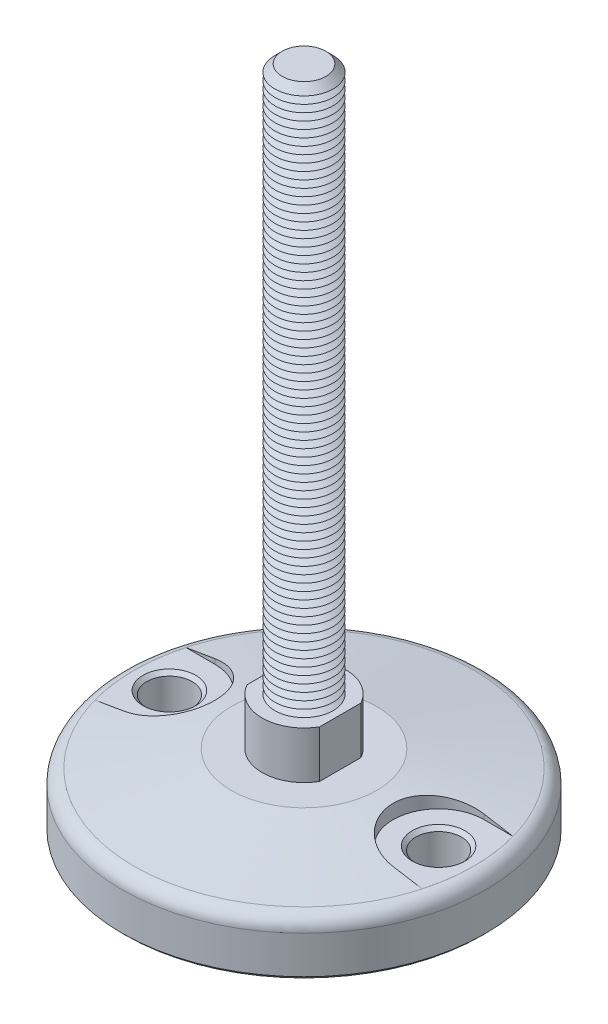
ISO-10303-21;
HEADER;
FILE_DESCRIPTION(('STEP AP214'),'2;1');
FILE_NAME('part.step','',(''),(''),'','','');
FILE_SCHEMA(('AUTOMOTIVE_DESIGN { 1 0 10303 214 1 1 1 1 }'));
ENDSEC;
DATA;
#1=APPLICATION_CONTEXT('core data for automotive mechanical design processes');
#2=APPLICATION_PROTOCOL_DEFINITION('international standard','automotive_design',2000,#1);
#3=PRODUCT_CONTEXT('',#1,'mechanical');
#4=PRODUCT('Part','Part','',(#3));
#5=PRODUCT_RELATED_PRODUCT_CATEGORY('part','',(#4));
#6=PRODUCT_DEFINITION_FORMATION('','',#4);
#7=PRODUCT_DEFINITION_CONTEXT('part definition',#1,'design');
#8=PRODUCT_DEFINITION('design','',#6,#7);
#9=PRODUCT_DEFINITION_SHAPE('','',#8);
#10=(LENGTH_UNIT() NAMED_UNIT(*) SI_UNIT(.MILLI.,.METRE.));
#11=(NAMED_UNIT(*) PLANE_ANGLE_UNIT() SI_UNIT($,.RADIAN.));
#12=(NAMED_UNIT(*) SI_UNIT($,.STERADIAN.) SOLID_ANGLE_UNIT());
#13=UNCERTAINTY_MEASURE_WITH_UNIT(LENGTH_MEASURE(1.E-05),#10,'distance_accuracy_value','');
#14=(GEOMETRIC_REPRESENTATION_CONTEXT(3) GLOBAL_UNCERTAINTY_ASSIGNED_CONTEXT((#13)) GLOBAL_UNIT_ASSIGNED_CONTEXT((#10,
#11,#12)) REPRESENTATION_CONTEXT('',''));
#15=CARTESIAN_POINT('',(0.,0.,0.));
#16=DIRECTION('',(0.,0.,1.));
#17=DIRECTION('',(1.,0.,0.));
#18=AXIS2_PLACEMENT_3D('',#15,#16,#17);
#19=CARTESIAN_POINT('',(0.,0.,0.));
#20=DIRECTION('',(0.,-1.,0.));
#21=DIRECTION('',(0.,0.,-1.));
#22=AXIS2_PLACEMENT_3D('',#19,#20,#21);
#23=CONICAL_SURFACE('',#22,20.,1.39626340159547);
#24=CARTESIAN_POINT('',(-37.0002,-3.35984690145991,12.4999999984));
#25=CARTESIAN_POINT('',(-36.6430801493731,-3.30019612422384,12.5000422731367));
#26=CARTESIAN_POINT('',(-36.286097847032,-3.23978096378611,12.4847089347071));
#27=CARTESIAN_POINT('',(-35.5749710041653,-3.11777545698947,12.423622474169));
#28=CARTESIAN_POINT('',(-35.2208262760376,-3.05618518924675,12.3778713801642));
#29=CARTESIAN_POINT('',(-34.5181114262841,-2.93221424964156,12.2563192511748));
#30=CARTESIAN_POINT('',(-34.1695379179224,-2.8698341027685,12.1805372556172));
#31=CARTESIAN_POINT('',(-33.4802130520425,-2.74463484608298,11.9995028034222));
#32=CARTESIAN_POINT('',(-33.1394616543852,-2.6818157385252,11.8942504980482));
#33=CARTESIAN_POINT('',(-32.4680688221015,-2.55613846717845,11.6549842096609));
#34=CARTESIAN_POINT('',(-32.1374312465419,-2.49328029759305,11.520959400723));
#35=CARTESIAN_POINT('',(-31.4887465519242,-2.36801465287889,11.2251130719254));
#36=CARTESIAN_POINT('',(-31.1706994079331,-2.30560717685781,11.063291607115));
#37=CARTESIAN_POINT('',(-30.54950311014,-2.18176290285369,10.7129930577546));
#38=CARTESIAN_POINT('',(-30.2463517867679,-2.12032596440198,10.524519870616));
#39=CARTESIAN_POINT('',(-29.6570687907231,-1.99897375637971,10.1221856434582));
#40=CARTESIAN_POINT('',(-29.3709370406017,-1.93905847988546,9.90832471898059));
#41=CARTESIAN_POINT('',(-28.8178459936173,-1.82137928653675,9.45673190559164));
#42=CARTESIAN_POINT('',(-28.5508809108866,-1.76361472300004,9.21900727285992));
#43=CARTESIAN_POINT('',(-28.0379874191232,-1.65088194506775,8.72124060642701));
#44=CARTESIAN_POINT('',(-27.7920590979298,-1.5959137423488,8.46119847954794));
#45=CARTESIAN_POINT('',(-27.323055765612,-1.48948182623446,7.9205326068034));
#46=CARTESIAN_POINT('',(-27.0999836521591,-1.43801855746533,7.63990625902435));
#47=CARTESIAN_POINT('',(-26.6784495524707,-1.33936166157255,7.06003375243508));
#48=CARTESIAN_POINT('',(-26.4799872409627,-1.29216797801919,6.76078783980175));
#49=CARTESIAN_POINT('',(-26.1117166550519,-1.20342811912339,6.14986205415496));
#50=CARTESIAN_POINT('',(-25.94156246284,-1.16181519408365,5.83840042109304));
#51=CARTESIAN_POINT('',(-25.628116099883,-1.08426427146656,5.20155792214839));
#52=CARTESIAN_POINT('',(-25.484823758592,-1.04832623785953,4.87617714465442));
#53=CARTESIAN_POINT('',(-25.2263277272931,-0.982857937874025,4.21390178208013));
#54=CARTESIAN_POINT('',(-25.1111175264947,-0.953326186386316,3.87700988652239));
#55=CARTESIAN_POINT('',(-24.9097439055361,-0.901314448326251,3.19412252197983));
#56=CARTESIAN_POINT('',(-24.8235797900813,-0.878834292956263,2.84812727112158));
#57=CARTESIAN_POINT('',(-24.6830159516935,-0.841972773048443,2.15919160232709));
#58=CARTESIAN_POINT('',(-24.6278129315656,-0.827386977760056,1.8164258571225));
#59=CARTESIAN_POINT('',(-24.5460973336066,-0.805742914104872,1.12725695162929));
#60=CARTESIAN_POINT('',(-24.5195842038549,-0.798684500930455,0.78085386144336));
#61=CARTESIAN_POINT('',(-24.4954839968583,-0.792269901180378,0.0870072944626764));
#62=CARTESIAN_POINT('',(-24.4978939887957,-0.79291293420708,-0.260436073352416));
#63=CARTESIAN_POINT('',(-24.5316115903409,-0.801883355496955,-0.953816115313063));
#64=CARTESIAN_POINT('',(-24.5629189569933,-0.810210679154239,-1.29975280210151));
#65=CARTESIAN_POINT('',(-24.6532283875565,-0.834099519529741,-1.98059726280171));
#66=CARTESIAN_POINT('',(-24.7116571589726,-0.849511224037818,-2.31558655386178));
#67=CARTESIAN_POINT('',(-24.8554972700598,-0.887161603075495,-2.97932206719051));
#68=CARTESIAN_POINT('',(-24.9409081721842,-0.909400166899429,-3.30806839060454));
#69=CARTESIAN_POINT('',(-25.1380243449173,-0.96022687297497,-3.95709027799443));
#70=CARTESIAN_POINT('',(-25.2497309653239,-0.988815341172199,-4.27736540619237));
#71=CARTESIAN_POINT('',(-25.498560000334,-1.05177019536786,-4.90729718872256));
#72=CARTESIAN_POINT('',(-25.6356828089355,-1.08613667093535,-5.21695367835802));
#73=CARTESIAN_POINT('',(-25.9361124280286,-1.16046648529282,-5.82730491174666));
#74=CARTESIAN_POINT('',(-26.0997157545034,-1.20049246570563,-6.12784605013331));
#75=CARTESIAN_POINT('',(-26.4506699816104,-1.28514282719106,-6.71404041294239));
#76=CARTESIAN_POINT('',(-26.6380209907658,-1.32976722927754,-6.99969356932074));
#77=CARTESIAN_POINT('',(-27.0351260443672,-1.42294054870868,-7.55431098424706));
#78=CARTESIAN_POINT('',(-27.2448809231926,-1.47148961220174,-7.82327462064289));
#79=CARTESIAN_POINT('',(-27.6853233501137,-1.57185653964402,-8.34282852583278));
#80=CARTESIAN_POINT('',(-27.9160114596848,-1.62367449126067,-8.59341830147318));
#81=CARTESIAN_POINT('',(-28.4034930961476,-1.73144835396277,-9.08142742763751));
#82=CARTESIAN_POINT('',(-28.660837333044,-1.78747956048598,-9.31828026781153));
#83=CARTESIAN_POINT('',(-29.1941741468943,-1.90170822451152,-9.7693949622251));
#84=CARTESIAN_POINT('',(-29.4701671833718,-1.95990573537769,-9.9836562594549));
#85=CARTESIAN_POINT('',(-30.0390002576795,-2.07790752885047,-10.3882796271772));
#86=CARTESIAN_POINT('',(-30.3318471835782,-2.1377124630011,-10.5786318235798));
#87=CARTESIAN_POINT('',(-30.9322646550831,-2.25836853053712,-10.9340888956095));
#88=CARTESIAN_POINT('',(-31.2398348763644,-2.31921964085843,-11.0991943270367));
#89=CARTESIAN_POINT('',(-31.8736774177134,-2.44266131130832,-11.4060146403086));
#90=CARTESIAN_POINT('',(-32.2001962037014,-2.50526276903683,-11.5472162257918));
#91=CARTESIAN_POINT('',(-32.8640586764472,-2.63057186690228,-11.8012839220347));
#92=CARTESIAN_POINT('',(-33.2014023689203,-2.69327950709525,-11.9141500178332));
#93=CARTESIAN_POINT('',(-33.8840988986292,-2.81828940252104,-12.1106227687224));
#94=CARTESIAN_POINT('',(-34.2294411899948,-2.88059206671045,-12.1942658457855));
#95=CARTESIAN_POINT('',(-34.9259788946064,-3.00445494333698,-12.3318436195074));
#96=CARTESIAN_POINT('',(-35.2771713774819,-3.06601550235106,-12.3857927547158));
#97=CARTESIAN_POINT('',(-35.8576122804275,-3.16637163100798,-12.4497947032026));
#98=CARTESIAN_POINT('',(-36.0858729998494,-3.20548751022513,-12.468632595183));
#99=CARTESIAN_POINT('',(-36.5427974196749,-3.2831194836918,-12.4937281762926));
#100=CARTESIAN_POINT('',(-36.7714598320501,-3.32163646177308,-12.5000065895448));
#101=CARTESIAN_POINT('',(-37.0002,-3.35984690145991,-12.4999999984));
#102=B_SPLINE_CURVE_WITH_KNOTS('',3,(#24,#25,#26,#27,#28,#29,#30,#31,#32,#33,#34,#35,#36,#37,
#38,#39,#40,#41,#42,#43,#44,#45,#46,#47,#48,#49,#50,#51,#52,#53,#54,#55,#56,#57,#58,#59,#60,#61,
#62,#63,#64,#65,#66,#67,#68,#69,#70,#71,#72,#73,#74,#75,#76,#77,#78,#79,#80,#81,#82,#83,#84,#85,
#86,#87,#88,#89,#90,#91,#92,#93,#94,#95,#96,#97,#98,#99,#100,#101),.UNSPECIFIED.,.F.,.F.,(4,2,2,
2,2,2,2,2,2,2,2,2,2,2,2,2,2,2,2,2,2,2,2,2,2,2,2,2,2,2,2,2,2,2,2,2,2,2,4),(0.,1.08586245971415,
2.171652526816,3.25675530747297,4.34185251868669,5.42735872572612,6.51286278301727,
7.59820826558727,8.68354880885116,9.76856032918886,10.853576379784,11.9387298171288,
13.0238689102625,14.0945791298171,15.1652825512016,16.2357374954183,17.3061668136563,
18.3473597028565,19.3885325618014,20.4295999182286,21.4706585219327,22.4906487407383,
23.5106224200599,24.5306484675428,25.5506903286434,26.5830642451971,27.6154428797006,
28.6478599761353,29.680304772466,30.7417064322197,31.8031342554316,32.8649990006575,
33.9268403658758,35.0091880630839,36.0915363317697,37.1725307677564,38.2529991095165,
38.9497417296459,39.6453337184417),.UNSPECIFIED.);
#103=CARTESIAN_POINT('',(-37.,-3.35981349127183,12.5));
#104=VERTEX_POINT('',#103);
#105=CARTESIAN_POINT('',(-37.,-3.35981349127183,-12.5));
#106=VERTEX_POINT('',#105);
#107=EDGE_CURVE('E850',#104,#106,#102,.T.);
#108=ORIENTED_EDGE('',*,*,#107,.F.);
#109=CARTESIAN_POINT('',(-61.7266967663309,-7.57847020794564,12.5));
#110=CARTESIAN_POINT('',(-60.2351929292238,-7.320720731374,12.5));
#111=CARTESIAN_POINT('',(-58.7436306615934,-7.06330856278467,12.5));
#112=CARTESIAN_POINT('',(-55.7603527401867,-6.54937673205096,12.5));
#113=CARTESIAN_POINT('',(-54.2686370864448,-6.29285706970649,12.5));
#114=CARTESIAN_POINT('',(-51.2850284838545,-5.78093030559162,12.5));
#115=CARTESIAN_POINT('',(-49.7931355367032,-5.52552319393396,12.5));
#116=CARTESIAN_POINT('',(-46.8091047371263,-5.01613816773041,12.5));
#117=CARTESIAN_POINT('',(-45.3169668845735,-4.76216025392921,12.5));
#118=CARTESIAN_POINT('',(-42.3323589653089,-4.25607669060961,12.5));
#119=CARTESIAN_POINT('',(-40.8398888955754,-4.00397105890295,12.5));
#120=CARTESIAN_POINT('',(-37.8545274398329,-3.50227519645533,12.5));
#121=CARTESIAN_POINT('',(-36.3616360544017,-3.252684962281,12.5));
#122=CARTESIAN_POINT('',(-34.1218562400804,-2.88092207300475,12.5));
#123=CARTESIAN_POINT('',(-33.3751855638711,-2.7574375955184,12.5));
#124=CARTESIAN_POINT('',(-31.8816714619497,-2.51151914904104,12.5));
#125=CARTESIAN_POINT('',(-31.1348280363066,-2.38908517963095,12.5));
#126=CARTESIAN_POINT('',(-29.6409325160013,-2.14547417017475,12.5));
#127=CARTESIAN_POINT('',(-28.8938804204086,-2.024297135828,12.5));
#128=CARTESIAN_POINT('',(-27.3995261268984,-1.78348915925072,12.5));
#129=CARTESIAN_POINT('',(-26.6522239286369,-1.66385821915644,12.5));
#130=CARTESIAN_POINT('',(-25.9047753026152,-1.54514479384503,12.5));
#131=B_SPLINE_CURVE_WITH_KNOTS('',3,(#109,#110,#111,#112,#113,#114,#115,#116,#117,#118,#119,
#120,#121,#122,#123,#124,#125,#126,#127,#128,#129,#130),.UNSPECIFIED.,.F.,.F.,(4,2,2,2,2,2,2,2,
2,2,4),(0.,4.54083339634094,9.08166577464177,13.6224577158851,18.1632520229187,22.7040894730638,
27.2449207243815,29.5153583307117,31.7857950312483,34.0562420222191,36.3266921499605),.UNSPECIFIED.);
#132=CARTESIAN_POINT('',(-44.9493194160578,-4.7,12.5));
#133=VERTEX_POINT('',#132);
#134=EDGE_CURVE('E824',#133,#104,#131,.T.);
#135=ORIENTED_EDGE('',*,*,#134,.F.);
#136=CARTESIAN_POINT('',(0.,-4.7,0.));
#137=DIRECTION('',(0.,1.,0.));
#138=DIRECTION('',(0.,0.,1.));
#139=AXIS2_PLACEMENT_3D('',#136,#137,#138);
#140=CIRCLE('',#139,46.6550245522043);
#141=CARTESIAN_POINT('',(-44.9493194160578,-4.7,-12.5));
#142=VERTEX_POINT('',#141);
#143=EDGE_CURVE('E813',#133,#142,#140,.F.);
#144=ORIENTED_EDGE('',*,*,#143,.T.);
#145=CARTESIAN_POINT('',(-25.9047753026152,-1.54514479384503,-12.5));
#146=CARTESIAN_POINT('',(-26.6522239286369,-1.66385821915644,-12.5));
#147=CARTESIAN_POINT('',(-27.3995261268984,-1.78348915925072,-12.5));
#148=CARTESIAN_POINT('',(-28.8938804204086,-2.024297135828,-12.5));
#149=CARTESIAN_POINT('',(-29.6409325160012,-2.14547417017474,-12.5));
#150=CARTESIAN_POINT('',(-31.1348280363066,-2.38908517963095,-12.5));
#151=CARTESIAN_POINT('',(-31.8816714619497,-2.51151914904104,-12.5));
#152=CARTESIAN_POINT('',(-33.3751855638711,-2.7574375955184,-12.5));
#153=CARTESIAN_POINT('',(-34.1218562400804,-2.88092207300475,-12.5));
#154=CARTESIAN_POINT('',(-36.3616360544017,-3.252684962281,-12.5));
#155=CARTESIAN_POINT('',(-37.8545274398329,-3.50227519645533,-12.5));
#156=CARTESIAN_POINT('',(-40.8398888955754,-4.00397105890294,-12.5));
#157=CARTESIAN_POINT('',(-42.3323589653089,-4.2560766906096,-12.5));
#158=CARTESIAN_POINT('',(-45.3169668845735,-4.7621602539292,-12.5));
#159=CARTESIAN_POINT('',(-46.8091047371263,-5.01613816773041,-12.5));
#160=CARTESIAN_POINT('',(-49.7931355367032,-5.52552319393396,-12.5));
#161=CARTESIAN_POINT('',(-51.2850284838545,-5.78093030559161,-12.5));
#162=CARTESIAN_POINT('',(-54.2686370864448,-6.29285706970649,-12.5));
#163=CARTESIAN_POINT('',(-55.7603527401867,-6.54937673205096,-12.5));
#164=CARTESIAN_POINT('',(-58.7436306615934,-7.06330856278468,-12.5));
#165=CARTESIAN_POINT('',(-60.2351929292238,-7.320720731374,-12.5));
#166=CARTESIAN_POINT('',(-61.7266967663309,-7.57847020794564,-12.5));
#167=B_SPLINE_CURVE_WITH_KNOTS('',3,(#145,#146,#147,#148,#149,#150,#151,#152,#153,#154,#155,
#156,#157,#158,#159,#160,#161,#162,#163,#164,#165,#166),.UNSPECIFIED.,.F.,.F.,(4,2,2,2,2,2,2,2,
2,2,4),(0.,2.27045012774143,4.54089711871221,6.81133381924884,9.08177142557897,13.6226026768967,
18.1634401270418,22.7042344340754,27.2450263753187,31.7858587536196,36.3266921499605),.UNSPECIFIED.);
#168=EDGE_CURVE('E817',#106,#142,#167,.T.);
#169=ORIENTED_EDGE('',*,*,#168,.F.);
#170=EDGE_LOOP('',(#108,#135,#144,#169));
#171=FACE_BOUND('',#170,.T.);
#172=CARTESIAN_POINT('',(0.,-4.70697693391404,0.));
#173=DIRECTION('',(0.,1.,0.));
#174=DIRECTION('',(0.,0.,1.));
#175=AXIS2_PLACEMENT_3D('',#172,#173,#174);
#176=CIRCLE('',#175,46.6945927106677);
#177=CARTESIAN_POINT('',(0.,-4.70697693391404,46.6945927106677));
#178=VERTEX_POINT('',#177);
#179=EDGE_CURVE('E802',#178,#178,#176,.T.);
#180=ORIENTED_EDGE('',*,*,#179,.T.);
#181=EDGE_LOOP('',(#180));
#182=FACE_BOUND('',#181,.T.);
#183=CARTESIAN_POINT('',(0.,0.,0.));
#184=DIRECTION('',(0.,1.,0.));
#185=DIRECTION('',(0.,0.,1.));
#186=AXIS2_PLACEMENT_3D('',#183,#184,#185);
#187=CIRCLE('',#186,20.);
#188=CARTESIAN_POINT('',(0.,0.,20.));
#189=VERTEX_POINT('',#188);
#190=EDGE_CURVE('E798',#189,#189,#187,.T.);
#191=ORIENTED_EDGE('',*,*,#190,.F.);
#192=EDGE_LOOP('',(#191));
#193=FACE_BOUND('',#192,.T.);
#194=CARTESIAN_POINT('',(55.9042883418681,-6.57430258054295,12.5));
#195=CARTESIAN_POINT('',(54.412585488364,-6.31763127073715,12.5));
#196=CARTESIAN_POINT('',(52.9208062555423,-6.06140219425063,12.5));
#197=CARTESIAN_POINT('',(49.9370413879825,-5.55015786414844,12.5));
#198=CARTESIAN_POINT('',(48.4450557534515,-5.29514260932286,12.5));
#199=CARTESIAN_POINT('',(45.4608530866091,-4.78666015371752,12.5));
#200=CARTESIAN_POINT('',(43.9686360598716,-4.53319292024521,12.5));
#201=CARTESIAN_POINT('',(40.9838536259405,-4.02830138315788,12.5));
#202=CARTESIAN_POINT('',(39.4912882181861,-3.7768770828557,12.5));
#203=CARTESIAN_POINT('',(36.50565536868,-3.27679220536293,12.5));
#204=CARTESIAN_POINT('',(35.0125879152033,-3.02813169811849,12.5));
#205=CARTESIAN_POINT('',(32.0258195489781,-2.53467103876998,12.5));
#206=CARTESIAN_POINT('',(30.5321186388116,-2.28987087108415,12.5));
#207=CARTESIAN_POINT('',(28.290865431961,-1.92688841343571,12.5));
#208=CARTESIAN_POINT('',(27.5436550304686,-1.80659579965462,12.5));
#209=CARTESIAN_POINT('',(26.0489572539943,-1.56774876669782,12.5));
#210=CARTESIAN_POINT('',(25.3014698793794,-1.44919434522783,12.5));
#211=CARTESIAN_POINT('',(23.8061486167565,-1.21422016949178,12.5));
#212=CARTESIAN_POINT('',(23.0583147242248,-1.09780044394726,12.5));
#213=CARTESIAN_POINT('',(21.5622260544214,-0.867676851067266,12.5));
#214=CARTESIAN_POINT('',(20.8139712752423,-0.753972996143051,12.5));
#215=CARTESIAN_POINT('',(20.0654672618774,-0.641917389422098,12.5));
#216=B_SPLINE_CURVE_WITH_KNOTS('',3,(#194,#195,#196,#197,#198,#199,#200,#201,#202,#203,#204,
#205,#206,#207,#208,#209,#210,#211,#212,#213,#214,#215),.UNSPECIFIED.,.F.,.F.,(4,2,2,2,2,2,2,2,
2,2,4),(0.,4.54087231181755,9.08174009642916,13.6225116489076,18.1632905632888,22.7041841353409,
27.2450593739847,29.515551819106,31.7860412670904,34.0565612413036,36.3270915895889),.UNSPECIFIED.);
#217=CARTESIAN_POINT('',(44.9493194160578,-4.7,12.5));
#218=VERTEX_POINT('',#217);
#219=CARTESIAN_POINT('',(37.,-3.35981349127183,12.5));
#220=VERTEX_POINT('',#219);
#221=EDGE_CURVE('E121',#218,#220,#216,.T.);
#222=ORIENTED_EDGE('',*,*,#221,.T.);
#223=CARTESIAN_POINT('',(37.0002,-3.35984690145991,12.4999999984));
#224=CARTESIAN_POINT('',(36.6430801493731,-3.30019612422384,12.5000422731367));
#225=CARTESIAN_POINT('',(36.286097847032,-3.23978096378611,12.4847089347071));
#226=CARTESIAN_POINT('',(35.5749710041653,-3.11777545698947,12.423622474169));
#227=CARTESIAN_POINT('',(35.2208262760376,-3.05618518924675,12.3778713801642));
#228=CARTESIAN_POINT('',(34.5181114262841,-2.93221424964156,12.2563192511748));
#229=CARTESIAN_POINT('',(34.1695379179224,-2.8698341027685,12.1805372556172));
#230=CARTESIAN_POINT('',(33.4802130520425,-2.74463484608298,11.9995028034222));
#231=CARTESIAN_POINT('',(33.1394616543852,-2.6818157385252,11.8942504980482));
#232=CARTESIAN_POINT('',(32.4680688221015,-2.55613846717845,11.6549842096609));
#233=CARTESIAN_POINT('',(32.1374312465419,-2.49328029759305,11.520959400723));
#234=CARTESIAN_POINT('',(31.4887465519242,-2.36801465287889,11.2251130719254));
#235=CARTESIAN_POINT('',(31.1706994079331,-2.30560717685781,11.063291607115));
#236=CARTESIAN_POINT('',(30.54950311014,-2.18176290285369,10.7129930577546));
#237=CARTESIAN_POINT('',(30.2463517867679,-2.12032596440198,10.524519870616));
#238=CARTESIAN_POINT('',(29.6570687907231,-1.99897375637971,10.1221856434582));
#239=CARTESIAN_POINT('',(29.3709370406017,-1.93905847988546,9.90832471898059));
#240=CARTESIAN_POINT('',(28.8178459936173,-1.82137928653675,9.45673190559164));
#241=CARTESIAN_POINT('',(28.5508809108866,-1.76361472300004,9.21900727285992));
#242=CARTESIAN_POINT('',(28.0379874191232,-1.65088194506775,8.72124060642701));
#243=CARTESIAN_POINT('',(27.7920590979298,-1.5959137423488,8.46119847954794));
#244=CARTESIAN_POINT('',(27.323055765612,-1.48948182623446,7.9205326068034));
#245=CARTESIAN_POINT('',(27.0999836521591,-1.43801855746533,7.63990625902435));
#246=CARTESIAN_POINT('',(26.6784495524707,-1.33936166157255,7.06003375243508));
#247=CARTESIAN_POINT('',(26.4799872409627,-1.29216797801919,6.76078783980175));
#248=CARTESIAN_POINT('',(26.1117166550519,-1.20342811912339,6.14986205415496));
#249=CARTESIAN_POINT('',(25.94156246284,-1.16181519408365,5.83840042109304));
#250=CARTESIAN_POINT('',(25.628116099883,-1.08426427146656,5.20155792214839));
#251=CARTESIAN_POINT('',(25.484823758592,-1.04832623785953,4.87617714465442));
#252=CARTESIAN_POINT('',(25.2263277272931,-0.982857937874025,4.21390178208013));
#253=CARTESIAN_POINT('',(25.1111175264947,-0.953326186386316,3.87700988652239));
#254=CARTESIAN_POINT('',(24.9097439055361,-0.901314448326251,3.19412252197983));
#255=CARTESIAN_POINT('',(24.8235797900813,-0.878834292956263,2.84812727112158));
#256=CARTESIAN_POINT('',(24.6830159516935,-0.841972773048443,2.15919160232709));
#257=CARTESIAN_POINT('',(24.6278129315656,-0.827386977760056,1.8164258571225));
#258=CARTESIAN_POINT('',(24.5460973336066,-0.805742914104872,1.12725695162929));
#259=CARTESIAN_POINT('',(24.5195842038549,-0.798684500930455,0.78085386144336));
#260=CARTESIAN_POINT('',(24.4954839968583,-0.792269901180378,0.0870072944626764));
#261=CARTESIAN_POINT('',(24.4978939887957,-0.79291293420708,-0.260436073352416));
#262=CARTESIAN_POINT('',(24.5316115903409,-0.801883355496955,-0.953816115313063));
#263=CARTESIAN_POINT('',(24.5629189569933,-0.810210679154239,-1.29975280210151));
#264=CARTESIAN_POINT('',(24.6532283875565,-0.834099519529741,-1.98059726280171));
#265=CARTESIAN_POINT('',(24.7116571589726,-0.849511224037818,-2.31558655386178));
#266=CARTESIAN_POINT('',(24.8554972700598,-0.887161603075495,-2.97932206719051));
#267=CARTESIAN_POINT('',(24.9409081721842,-0.909400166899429,-3.30806839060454));
#268=CARTESIAN_POINT('',(25.1380243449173,-0.96022687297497,-3.95709027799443));
#269=CARTESIAN_POINT('',(25.2497309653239,-0.988815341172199,-4.27736540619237));
#270=CARTESIAN_POINT('',(25.498560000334,-1.05177019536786,-4.90729718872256));
#271=CARTESIAN_POINT('',(25.6356828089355,-1.08613667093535,-5.21695367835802));
#272=CARTESIAN_POINT('',(25.9361124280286,-1.16046648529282,-5.82730491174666));
#273=CARTESIAN_POINT('',(26.0997157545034,-1.20049246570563,-6.12784605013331));
#274=CARTESIAN_POINT('',(26.4506699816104,-1.28514282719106,-6.71404041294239));
#275=CARTESIAN_POINT('',(26.6380209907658,-1.32976722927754,-6.99969356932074));
#276=CARTESIAN_POINT('',(27.0351260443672,-1.42294054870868,-7.55431098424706));
#277=CARTESIAN_POINT('',(27.2448809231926,-1.47148961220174,-7.82327462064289));
#278=CARTESIAN_POINT('',(27.6853233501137,-1.57185653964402,-8.34282852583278));
#279=CARTESIAN_POINT('',(27.9160114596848,-1.62367449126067,-8.59341830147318));
#280=CARTESIAN_POINT('',(28.4034930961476,-1.73144835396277,-9.08142742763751));
#281=CARTESIAN_POINT('',(28.660837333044,-1.78747956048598,-9.31828026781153));
#282=CARTESIAN_POINT('',(29.1941741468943,-1.90170822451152,-9.7693949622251));
#283=CARTESIAN_POINT('',(29.4701671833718,-1.95990573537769,-9.9836562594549));
#284=CARTESIAN_POINT('',(30.0390002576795,-2.07790752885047,-10.3882796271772));
#285=CARTESIAN_POINT('',(30.3318471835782,-2.1377124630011,-10.5786318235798));
#286=CARTESIAN_POINT('',(30.9322646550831,-2.25836853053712,-10.9340888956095));
#287=CARTESIAN_POINT('',(31.2398348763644,-2.31921964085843,-11.0991943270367));
#288=CARTESIAN_POINT('',(31.8736774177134,-2.44266131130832,-11.4060146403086));
#289=CARTESIAN_POINT('',(32.2001962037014,-2.50526276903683,-11.5472162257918));
#290=CARTESIAN_POINT('',(32.8640586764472,-2.63057186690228,-11.8012839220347));
#291=CARTESIAN_POINT('',(33.2014023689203,-2.69327950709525,-11.9141500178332));
#292=CARTESIAN_POINT('',(33.8840988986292,-2.81828940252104,-12.1106227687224));
#293=CARTESIAN_POINT('',(34.2294411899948,-2.88059206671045,-12.1942658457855));
#294=CARTESIAN_POINT('',(34.9259788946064,-3.00445494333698,-12.3318436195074));
#295=CARTESIAN_POINT('',(35.2771713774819,-3.06601550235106,-12.3857927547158));
#296=CARTESIAN_POINT('',(35.8576122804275,-3.16637163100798,-12.4497947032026));
#297=CARTESIAN_POINT('',(36.0858729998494,-3.20548751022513,-12.468632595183));
#298=CARTESIAN_POINT('',(36.5427974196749,-3.2831194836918,-12.4937281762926));
#299=CARTESIAN_POINT('',(36.7714598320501,-3.32163646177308,-12.5000065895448));
#300=CARTESIAN_POINT('',(37.0002,-3.35984690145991,-12.4999999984));
#301=B_SPLINE_CURVE_WITH_KNOTS('',3,(#223,#224,#225,#226,#227,#228,#229,#230,#231,#232,#233,
#234,#235,#236,#237,#238,#239,#240,#241,#242,#243,#244,#245,#246,#247,#248,#249,#250,#251,#252,
#253,#254,#255,#256,#257,#258,#259,#260,#261,#262,#263,#264,#265,#266,#267,#268,#269,#270,#271,
#272,#273,#274,#275,#276,#277,#278,#279,#280,#281,#282,#283,#284,#285,#286,#287,#288,#289,#290,
#291,#292,#293,#294,#295,#296,#297,#298,#299,#300),.UNSPECIFIED.,.F.,.F.,(4,2,2,2,2,2,2,2,2,2,2,
2,2,2,2,2,2,2,2,2,2,2,2,2,2,2,2,2,2,2,2,2,2,2,2,2,2,2,4),(0.,1.08586245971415,2.171652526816,
3.25675530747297,4.34185251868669,5.42735872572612,6.51286278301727,7.59820826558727,
8.68354880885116,9.76856032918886,10.853576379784,11.9387298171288,13.0238689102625,
14.0945791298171,15.1652825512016,16.2357374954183,17.3061668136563,18.3473597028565,
19.3885325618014,20.4295999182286,21.4706585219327,22.4906487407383,23.5106224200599,
24.5306484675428,25.5506903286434,26.5830642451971,27.6154428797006,28.6478599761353,
29.680304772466,30.7417064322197,31.8031342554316,32.8649990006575,33.9268403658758,
35.0091880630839,36.0915363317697,37.1725307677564,38.2529991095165,38.9497417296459,
39.6453337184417),.UNSPECIFIED.);
#302=CARTESIAN_POINT('',(37.,-3.35981349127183,-12.5));
#303=VERTEX_POINT('',#302);
#304=EDGE_CURVE('E133',#220,#303,#301,.T.);
#305=ORIENTED_EDGE('',*,*,#304,.T.);
#306=CARTESIAN_POINT('',(20.0654672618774,-0.641917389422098,-12.5));
#307=CARTESIAN_POINT('',(20.8139712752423,-0.753972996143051,-12.5));
#308=CARTESIAN_POINT('',(21.5622260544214,-0.867676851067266,-12.5));
#309=CARTESIAN_POINT('',(23.0583147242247,-1.09780044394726,-12.5));
#310=CARTESIAN_POINT('',(23.8061486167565,-1.21422016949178,-12.5));
#311=CARTESIAN_POINT('',(25.3014698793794,-1.44919434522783,-12.5));
#312=CARTESIAN_POINT('',(26.0489572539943,-1.56774876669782,-12.5));
#313=CARTESIAN_POINT('',(27.5436550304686,-1.80659579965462,-12.5));
#314=CARTESIAN_POINT('',(28.290865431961,-1.92688841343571,-12.5));
#315=CARTESIAN_POINT('',(30.5321186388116,-2.28987087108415,-12.5));
#316=CARTESIAN_POINT('',(32.0258195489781,-2.53467103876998,-12.5));
#317=CARTESIAN_POINT('',(35.0125879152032,-3.02813169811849,-12.5));
#318=CARTESIAN_POINT('',(36.50565536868,-3.27679220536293,-12.5));
#319=CARTESIAN_POINT('',(39.4912882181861,-3.7768770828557,-12.5));
#320=CARTESIAN_POINT('',(40.9838536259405,-4.02830138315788,-12.5));
#321=CARTESIAN_POINT('',(43.9686360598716,-4.53319292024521,-12.5));
#322=CARTESIAN_POINT('',(45.4608530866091,-4.78666015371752,-12.5));
#323=CARTESIAN_POINT('',(48.4450557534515,-5.29514260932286,-12.5));
#324=CARTESIAN_POINT('',(49.9370413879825,-5.55015786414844,-12.5));
#325=CARTESIAN_POINT('',(52.9208062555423,-6.06140219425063,-12.5));
#326=CARTESIAN_POINT('',(54.412585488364,-6.31763127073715,-12.5));
#327=CARTESIAN_POINT('',(55.9042883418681,-6.57430258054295,-12.5));
#328=B_SPLINE_CURVE_WITH_KNOTS('',3,(#306,#307,#308,#309,#310,#311,#312,#313,#314,#315,#316,
#317,#318,#319,#320,#321,#322,#323,#324,#325,#326,#327),.UNSPECIFIED.,.F.,.F.,(4,2,2,2,2,2,2,2,
2,2,4),(0.,2.27053034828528,4.54105032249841,6.81153977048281,9.08203221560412,13.6229074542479,
18.1638010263,22.7045799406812,27.2453514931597,31.7862192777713,36.3270915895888),.UNSPECIFIED.);
#329=CARTESIAN_POINT('',(44.9493194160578,-4.7,-12.5));
#330=VERTEX_POINT('',#329);
#331=EDGE_CURVE('E881',#303,#330,#328,.T.);
#332=ORIENTED_EDGE('',*,*,#331,.T.);
#333=CARTESIAN_POINT('',(0.,-4.7,0.));
#334=DIRECTION('',(0.,1.,0.));
#335=DIRECTION('',(0.,0.,1.));
#336=AXIS2_PLACEMENT_3D('',#333,#334,#335);
#337=CIRCLE('',#336,46.6550245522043);
#338=EDGE_CURVE('E872',#330,#218,#337,.F.);
#339=ORIENTED_EDGE('',*,*,#338,.T.);
#340=EDGE_LOOP('',(#222,#305,#332,#339));
#341=FACE_BOUND('',#340,.T.);
#342=ADVANCED_FACE('F39',(#171,#182,#193,#341),#23,.T.);
#343=CARTESIAN_POINT('',(0.,13.,0.));
#344=DIRECTION('',(0.,-1.,0.));
#345=DIRECTION('',(0.,0.,-1.));
#346=AXIS2_PLACEMENT_3D('',#343,#344,#345);
#347=CYLINDRICAL_SURFACE('',#346,11.5);
#348=CARTESIAN_POINT('',(0.,13.,0.));
#349=DIRECTION('',(0.,1.,0.));
#350=DIRECTION('',(0.,0.,1.));
#351=AXIS2_PLACEMENT_3D('',#348,#349,#350);
#352=CIRCLE('',#351,11.5);
#353=CARTESIAN_POINT('',(-10.,13.,5.67890834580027));
#354=VERTEX_POINT('',#353);
#355=CARTESIAN_POINT('',(10.,13.,5.67890834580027));
#356=VERTEX_POINT('',#355);
#357=EDGE_CURVE('E773',#354,#356,#352,.T.);
#358=ORIENTED_EDGE('',*,*,#357,.F.);
#359=DIRECTION('',(0.,1.,0.));
#360=VECTOR('',#359,1.);
#361=CARTESIAN_POINT('',(-10.,0.,5.67890834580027));
#362=LINE('',#361,#360);
#363=CARTESIAN_POINT('',(-10.,0.,5.67890834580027));
#364=VERTEX_POINT('',#363);
#365=EDGE_CURVE('E764',#364,#354,#362,.T.);
#366=ORIENTED_EDGE('',*,*,#365,.F.);
#367=CARTESIAN_POINT('',(0.,0.,0.));
#368=DIRECTION('',(0.,1.,0.));
#369=DIRECTION('',(0.,0.,1.));
#370=AXIS2_PLACEMENT_3D('',#367,#368,#369);
#371=CIRCLE('',#370,11.5);
#372=CARTESIAN_POINT('',(10.,0.,5.67890834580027));
#373=VERTEX_POINT('',#372);
#374=EDGE_CURVE('E792',#364,#373,#371,.T.);
#375=ORIENTED_EDGE('',*,*,#374,.T.);
#376=DIRECTION('',(0.,1.,0.));
#377=VECTOR('',#376,1.);
#378=CARTESIAN_POINT('',(10.,0.,5.67890834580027));
#379=LINE('',#378,#377);
#380=EDGE_CURVE('E768',#373,#356,#379,.T.);
#381=ORIENTED_EDGE('',*,*,#380,.T.);
#382=EDGE_LOOP('',(#358,#366,#375,#381));
#383=FACE_BOUND('',#382,.T.);
#384=ADVANCED_FACE('F935',(#383),#347,.T.);
#385=CARTESIAN_POINT('',(0.,0.,0.));
#386=DIRECTION('',(0.,1.,0.));
#387=DIRECTION('',(0.,0.,1.));
#388=AXIS2_PLACEMENT_3D('',#385,#386,#387);
#389=PLANE('',#388);
#390=CARTESIAN_POINT('',(10.,0.,-5.67890834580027));
#391=VERTEX_POINT('',#390);
#392=CARTESIAN_POINT('',(-10.,0.,-5.67890834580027));
#393=VERTEX_POINT('',#392);
#394=EDGE_CURVE('E796',#391,#393,#371,.T.);
#395=ORIENTED_EDGE('',*,*,#394,.F.);
#396=DIRECTION('',(0.,0.,1.));
#397=VECTOR('',#396,1.);
#398=CARTESIAN_POINT('',(10.,0.,5.67890834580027));
#399=LINE('',#398,#397);
#400=EDGE_CURVE('E776',#391,#373,#399,.T.);
#401=ORIENTED_EDGE('',*,*,#400,.T.);
#402=ORIENTED_EDGE('',*,*,#374,.F.);
#403=DIRECTION('',(0.,0.,-1.));
#404=VECTOR('',#403,1.);
#405=CARTESIAN_POINT('',(-10.,0.,-5.67890834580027));
#406=LINE('',#405,#404);
#407=EDGE_CURVE('E760',#364,#393,#406,.T.);
#408=ORIENTED_EDGE('',*,*,#407,.T.);
#409=EDGE_LOOP('',(#395,#401,#402,#408));
#410=FACE_BOUND('',#409,.T.);
#411=ORIENTED_EDGE('',*,*,#190,.T.);
#412=EDGE_LOOP('',(#411));
#413=FACE_BOUND('',#412,.T.);
#414=ADVANCED_FACE('F940',(#410,#413),#389,.T.);
#415=CARTESIAN_POINT('',(0.,61.3388655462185,0.));
#416=DIRECTION('',(0.,1.,0.));
#417=DIRECTION('',(0.,0.,1.));
#418=AXIS2_PLACEMENT_3D('',#415,#416,#417);
#419=CYLINDRICAL_SURFACE('',#418,50.);
#420=CARTESIAN_POINT('',(0.,-19.,0.));
#421=DIRECTION('',(0.,-1.,0.));
#422=DIRECTION('',(0.,0.,-1.));
#423=AXIS2_PLACEMENT_3D('',#420,#421,#422);
#424=CIRCLE('',#423,50.);
#425=CARTESIAN_POINT('',(0.,-19.,-50.));
#426=VERTEX_POINT('',#425);
#427=EDGE_CURVE('E48',#426,#426,#424,.F.);
#428=ORIENTED_EDGE('',*,*,#427,.T.);
#429=EDGE_LOOP('',(#428));
#430=FACE_BOUND('',#429,.T.);
#431=CARTESIAN_POINT('',(0.,-8.64620794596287,0.));
#432=DIRECTION('',(0.,-1.,0.));
#433=DIRECTION('',(0.,0.,-1.));
#434=AXIS2_PLACEMENT_3D('',#431,#432,#433);
#435=CIRCLE('',#434,50.);
#436=CARTESIAN_POINT('',(0.,-8.64620794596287,-50.));
#437=VERTEX_POINT('',#436);
#438=EDGE_CURVE('E797',#437,#437,#435,.T.);
#439=ORIENTED_EDGE('',*,*,#438,.T.);
#440=EDGE_LOOP('',(#439));
#441=FACE_BOUND('',#440,.T.);
#442=ADVANCED_FACE('F922',(#430,#441),#419,.T.);
#443=CARTESIAN_POINT('',(0.,-20.,50.));
#444=DIRECTION('',(0.,-1.,0.));
#445=DIRECTION('',(0.,0.,-1.));
#446=AXIS2_PLACEMENT_3D('',#443,#444,#445);
#447=PLANE('',#446);
#448=CARTESIAN_POINT('',(0.,-20.,0.));
#449=DIRECTION('',(0.,-1.,0.));
#450=DIRECTION('',(0.,0.,-1.));
#451=AXIS2_PLACEMENT_3D('',#448,#449,#450);
#452=CIRCLE('',#451,49.);
#453=CARTESIAN_POINT('',(0.,-20.,-49.));
#454=VERTEX_POINT('',#453);
#455=EDGE_CURVE('E11',#454,#454,#452,.T.);
#456=ORIENTED_EDGE('',*,*,#455,.T.);
#457=EDGE_LOOP('',(#456));
#458=FACE_BOUND('',#457,.T.);
#459=CARTESIAN_POINT('',(37.,-20.,0.));
#460=DIRECTION('',(0.,-1.,0.));
#461=DIRECTION('',(0.,0.,-1.));
#462=AXIS2_PLACEMENT_3D('',#459,#460,#461);
#463=CIRCLE('',#462,7.25000000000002);
#464=CARTESIAN_POINT('',(37.,-20.,-7.25000000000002));
#465=VERTEX_POINT('',#464);
#466=EDGE_CURVE('E911',#465,#465,#463,.F.);
#467=ORIENTED_EDGE('',*,*,#466,.T.);
#468=EDGE_LOOP('',(#467));
#469=FACE_BOUND('',#468,.T.);
#470=CARTESIAN_POINT('',(-37.,-20.,0.));
#471=DIRECTION('',(0.,-1.,0.));
#472=DIRECTION('',(0.,0.,-1.));
#473=AXIS2_PLACEMENT_3D('',#470,#471,#472);
#474=CIRCLE('',#473,7.25000000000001);
#475=CARTESIAN_POINT('',(-37.,-20.,-7.25000000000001));
#476=VERTEX_POINT('',#475);
#477=EDGE_CURVE('E856',#476,#476,#474,.F.);
#478=ORIENTED_EDGE('',*,*,#477,.T.);
#479=EDGE_LOOP('',(#478));
#480=FACE_BOUND('',#479,.T.);
#481=ADVANCED_FACE('F1024',(#458,#469,#480),#447,.T.);
#482=CARTESIAN_POINT('',(0.,-8.64620794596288,0.));
#483=DIRECTION('',(0.,-1.,0.));
#484=DIRECTION('',(0.,0.,-1.));
#485=AXIS2_PLACEMENT_3D('',#482,#483,#484);
#486=TOROIDAL_SURFACE('',#485,46.,4.);
#487=ORIENTED_EDGE('',*,*,#438,.F.);
#488=EDGE_LOOP('',(#487));
#489=FACE_BOUND('',#488,.T.);
#490=ORIENTED_EDGE('',*,*,#179,.F.);
#491=EDGE_LOOP('',(#490));
#492=FACE_BOUND('',#491,.T.);
#493=ADVANCED_FACE('F1029',(#489,#492),#486,.T.);
#494=ORIENTED_EDGE('',*,*,#394,.T.);
#495=DIRECTION('',(0.,1.,0.));
#496=VECTOR('',#495,1.);
#497=CARTESIAN_POINT('',(-10.,0.,-5.67890834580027));
#498=LINE('',#497,#496);
#499=CARTESIAN_POINT('',(-10.,13.,-5.67890834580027));
#500=VERTEX_POINT('',#499);
#501=EDGE_CURVE('E769',#393,#500,#498,.T.);
#502=ORIENTED_EDGE('',*,*,#501,.T.);
#503=CARTESIAN_POINT('',(10.,13.,-5.67890834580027));
#504=VERTEX_POINT('',#503);
#505=EDGE_CURVE('E791',#504,#500,#352,.T.);
#506=ORIENTED_EDGE('',*,*,#505,.F.);
#507=DIRECTION('',(0.,1.,0.));
#508=VECTOR('',#507,1.);
#509=CARTESIAN_POINT('',(10.,0.,-5.67890834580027));
#510=LINE('',#509,#508);
#511=EDGE_CURVE('E780',#391,#504,#510,.T.);
#512=ORIENTED_EDGE('',*,*,#511,.F.);
#513=EDGE_LOOP('',(#494,#502,#506,#512));
#514=FACE_BOUND('',#513,.T.);
#515=ADVANCED_FACE('F943',(#514),#347,.T.);
#516=CARTESIAN_POINT('',(0.,13.,0.));
#517=DIRECTION('',(0.,1.,0.));
#518=DIRECTION('',(0.,0.,1.));
#519=AXIS2_PLACEMENT_3D('',#516,#517,#518);
#520=PLANE('',#519);
#521=CARTESIAN_POINT('',(0.,13.,0.));
#522=DIRECTION('',(0.,1.,0.));
#523=DIRECTION('',(0.,0.,1.));
#524=AXIS2_PLACEMENT_3D('',#521,#522,#523);
#525=CIRCLE('',#524,8.);
#526=CARTESIAN_POINT('',(0.,13.,8.));
#527=VERTEX_POINT('',#526);
#528=EDGE_CURVE('E755',#527,#527,#525,.T.);
#529=ORIENTED_EDGE('',*,*,#528,.F.);
#530=EDGE_LOOP('',(#529));
#531=FACE_BOUND('',#530,.T.);
#532=DIRECTION('',(0.,0.,-1.));
#533=VECTOR('',#532,1.);
#534=CARTESIAN_POINT('',(-10.,13.,-5.67890834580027));
#535=LINE('',#534,#533);
#536=EDGE_CURVE('E765',#354,#500,#535,.T.);
#537=ORIENTED_EDGE('',*,*,#536,.F.);
#538=ORIENTED_EDGE('',*,*,#357,.T.);
#539=DIRECTION('',(0.,0.,1.));
#540=VECTOR('',#539,1.);
#541=CARTESIAN_POINT('',(10.,13.,5.67890834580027));
#542=LINE('',#541,#540);
#543=EDGE_CURVE('E759',#504,#356,#542,.T.);
#544=ORIENTED_EDGE('',*,*,#543,.F.);
#545=ORIENTED_EDGE('',*,*,#505,.T.);
#546=EDGE_LOOP('',(#537,#538,#544,#545));
#547=FACE_BOUND('',#546,.T.);
#548=ADVANCED_FACE('F2487',(#531,#547),#520,.T.);
#549=CARTESIAN_POINT('',(10.,0.,5.67890834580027));
#550=DIRECTION('',(-1.,0.,0.));
#551=DIRECTION('',(0.,0.,1.));
#552=AXIS2_PLACEMENT_3D('',#549,#550,#551);
#553=PLANE('',#552);
#554=ORIENTED_EDGE('',*,*,#543,.T.);
#555=ORIENTED_EDGE('',*,*,#380,.F.);
#556=ORIENTED_EDGE('',*,*,#400,.F.);
#557=ORIENTED_EDGE('',*,*,#511,.T.);
#558=EDGE_LOOP('',(#554,#555,#556,#557));
#559=FACE_BOUND('',#558,.T.);
#560=ADVANCED_FACE('F2478',(#559),#553,.F.);
#561=CARTESIAN_POINT('',(-10.,0.,-5.67890834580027));
#562=DIRECTION('',(1.,0.,0.));
#563=DIRECTION('',(0.,0.,-1.));
#564=AXIS2_PLACEMENT_3D('',#561,#562,#563);
#565=PLANE('',#564);
#566=ORIENTED_EDGE('',*,*,#536,.T.);
#567=ORIENTED_EDGE('',*,*,#501,.F.);
#568=ORIENTED_EDGE('',*,*,#407,.F.);
#569=ORIENTED_EDGE('',*,*,#365,.T.);
#570=EDGE_LOOP('',(#566,#567,#568,#569));
#571=FACE_BOUND('',#570,.T.);
#572=ADVANCED_FACE('F2469',(#571),#565,.F.);
#573=CARTESIAN_POINT('',(0.,13.,0.));
#574=DIRECTION('',(0.,-1.,0.));
#575=DIRECTION('',(0.,0.,-1.));
#576=AXIS2_PLACEMENT_3D('',#573,#574,#575);
#577=CONICAL_SURFACE('',#576,8.,1.0471975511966);
#578=CARTESIAN_POINT('',(0.,14.,0.));
#579=DIRECTION('',(0.,1.,0.));
#580=DIRECTION('',(0.,0.,1.));
#581=AXIS2_PLACEMENT_3D('',#578,#579,#580);
#582=CIRCLE('',#581,6.26794919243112);
#583=CARTESIAN_POINT('',(0.,14.,6.26794919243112));
#584=VERTEX_POINT('',#583);
#585=EDGE_CURVE('E751',#584,#584,#582,.T.);
#586=ORIENTED_EDGE('',*,*,#585,.F.);
#587=EDGE_LOOP('',(#586));
#588=FACE_BOUND('',#587,.T.);
#589=ORIENTED_EDGE('',*,*,#528,.T.);
#590=EDGE_LOOP('',(#589));
#591=FACE_BOUND('',#590,.T.);
#592=ADVANCED_FACE('F2461',(#588,#591),#577,.T.);
#593=CARTESIAN_POINT('',(0.,14.,0.));
#594=DIRECTION('',(0.,1.,0.));
#595=DIRECTION('',(0.,0.,1.));
#596=AXIS2_PLACEMENT_3D('',#593,#594,#595);
#597=CONICAL_SURFACE('',#596,6.26794919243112,1.0471975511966);
#598=CARTESIAN_POINT('',(0.,15.,0.));
#599=DIRECTION('',(0.,1.,0.));
#600=DIRECTION('',(0.,0.,1.));
#601=AXIS2_PLACEMENT_3D('',#598,#599,#600);
#602=CIRCLE('',#601,8.);
#603=CARTESIAN_POINT('',(0.,15.,8.));
#604=VERTEX_POINT('',#603);
#605=EDGE_CURVE('E747',#604,#604,#602,.T.);
#606=ORIENTED_EDGE('',*,*,#605,.F.);
#607=EDGE_LOOP('',(#606));
#608=FACE_BOUND('',#607,.T.);
#609=ORIENTED_EDGE('',*,*,#585,.T.);
#610=EDGE_LOOP('',(#609));
#611=FACE_BOUND('',#610,.T.);
#612=ADVANCED_FACE('F2452',(#608,#611),#597,.T.);
#613=CARTESIAN_POINT('',(0.,15.,0.));
#614=DIRECTION('',(0.,-1.,0.));
#615=DIRECTION('',(0.,0.,-1.));
#616=AXIS2_PLACEMENT_3D('',#613,#614,#615);
#617=CONICAL_SURFACE('',#616,8.,1.0471975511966);
#618=CARTESIAN_POINT('',(0.,16.,0.));
#619=DIRECTION('',(0.,1.,0.));
#620=DIRECTION('',(0.,0.,1.));
#621=AXIS2_PLACEMENT_3D('',#618,#619,#620);
#622=CIRCLE('',#621,6.26794919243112);
#623=CARTESIAN_POINT('',(0.,16.,6.26794919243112));
#624=VERTEX_POINT('',#623);
#625=EDGE_CURVE('E743',#624,#624,#622,.T.);
#626=ORIENTED_EDGE('',*,*,#625,.F.);
#627=EDGE_LOOP('',(#626));
#628=FACE_BOUND('',#627,.T.);
#629=ORIENTED_EDGE('',*,*,#605,.T.);
#630=EDGE_LOOP('',(#629));
#631=FACE_BOUND('',#630,.T.);
#632=ADVANCED_FACE('F2443',(#628,#631),#617,.T.);
#633=CARTESIAN_POINT('',(0.,16.,0.));
#634=DIRECTION('',(0.,1.,0.));
#635=DIRECTION('',(0.,0.,1.));
#636=AXIS2_PLACEMENT_3D('',#633,#634,#635);
#637=CONICAL_SURFACE('',#636,6.26794919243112,1.0471975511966);
#638=CARTESIAN_POINT('',(0.,17.,0.));
#639=DIRECTION('',(0.,1.,0.));
#640=DIRECTION('',(0.,0.,1.));
#641=AXIS2_PLACEMENT_3D('',#638,#639,#640);
#642=CIRCLE('',#641,8.);
#643=CARTESIAN_POINT('',(0.,17.,8.));
#644=VERTEX_POINT('',#643);
#645=EDGE_CURVE('E739',#644,#644,#642,.T.);
#646=ORIENTED_EDGE('',*,*,#645,.F.);
#647=EDGE_LOOP('',(#646));
#648=FACE_BOUND('',#647,.T.);
#649=ORIENTED_EDGE('',*,*,#625,.T.);
#650=EDGE_LOOP('',(#649));
#651=FACE_BOUND('',#650,.T.);
#652=ADVANCED_FACE('F2434',(#648,#651),#637,.T.);
#653=CARTESIAN_POINT('',(0.,17.,0.));
#654=DIRECTION('',(0.,-1.,0.));
#655=DIRECTION('',(0.,0.,-1.));
#656=AXIS2_PLACEMENT_3D('',#653,#654,#655);
#657=CONICAL_SURFACE('',#656,8.,1.0471975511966);
#658=CARTESIAN_POINT('',(0.,18.,0.));
#659=DIRECTION('',(0.,1.,0.));
#660=DIRECTION('',(0.,0.,1.));
#661=AXIS2_PLACEMENT_3D('',#658,#659,#660);
#662=CIRCLE('',#661,6.26794919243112);
#663=CARTESIAN_POINT('',(0.,18.,6.26794919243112));
#664=VERTEX_POINT('',#663);
#665=EDGE_CURVE('E735',#664,#664,#662,.T.);
#666=ORIENTED_EDGE('',*,*,#665,.F.);
#667=EDGE_LOOP('',(#666));
#668=FACE_BOUND('',#667,.T.);
#669=ORIENTED_EDGE('',*,*,#645,.T.);
#670=EDGE_LOOP('',(#669));
#671=FACE_BOUND('',#670,.T.);
#672=ADVANCED_FACE('F2425',(#668,#671),#657,.T.);
#673=CARTESIAN_POINT('',(0.,18.,0.));
#674=DIRECTION('',(0.,1.,0.));
#675=DIRECTION('',(0.,0.,1.));
#676=AXIS2_PLACEMENT_3D('',#673,#674,#675);
#677=CONICAL_SURFACE('',#676,6.26794919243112,1.0471975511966);
#678=CARTESIAN_POINT('',(0.,19.,0.));
#679=DIRECTION('',(0.,1.,0.));
#680=DIRECTION('',(0.,0.,1.));
#681=AXIS2_PLACEMENT_3D('',#678,#679,#680);
#682=CIRCLE('',#681,8.);
#683=CARTESIAN_POINT('',(0.,19.,8.));
#684=VERTEX_POINT('',#683);
#685=EDGE_CURVE('E731',#684,#684,#682,.T.);
#686=ORIENTED_EDGE('',*,*,#685,.F.);
#687=EDGE_LOOP('',(#686));
#688=FACE_BOUND('',#687,.T.);
#689=ORIENTED_EDGE('',*,*,#665,.T.);
#690=EDGE_LOOP('',(#689));
#691=FACE_BOUND('',#690,.T.);
#692=ADVANCED_FACE('F2416',(#688,#691),#677,.T.);
#693=CARTESIAN_POINT('',(0.,19.,0.));
#694=DIRECTION('',(0.,-1.,0.));
#695=DIRECTION('',(0.,0.,-1.));
#696=AXIS2_PLACEMENT_3D('',#693,#694,#695);
#697=CONICAL_SURFACE('',#696,8.,1.0471975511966);
#698=CARTESIAN_POINT('',(0.,20.,0.));
#699=DIRECTION('',(0.,1.,0.));
#700=DIRECTION('',(0.,0.,1.));
#701=AXIS2_PLACEMENT_3D('',#698,#699,#700);
#702=CIRCLE('',#701,6.26794919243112);
#703=CARTESIAN_POINT('',(0.,20.,6.26794919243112));
#704=VERTEX_POINT('',#703);
#705=EDGE_CURVE('E727',#704,#704,#702,.T.);
#706=ORIENTED_EDGE('',*,*,#705,.F.);
#707=EDGE_LOOP('',(#706));
#708=FACE_BOUND('',#707,.T.);
#709=ORIENTED_EDGE('',*,*,#685,.T.);
#710=EDGE_LOOP('',(#709));
#711=FACE_BOUND('',#710,.T.);
#712=ADVANCED_FACE('F2407',(#708,#711),#697,.T.);
#713=CARTESIAN_POINT('',(0.,20.,0.));
#714=DIRECTION('',(0.,1.,0.));
#715=DIRECTION('',(0.,0.,1.));
#716=AXIS2_PLACEMENT_3D('',#713,#714,#715);
#717=CONICAL_SURFACE('',#716,6.26794919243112,1.0471975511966);
#718=CARTESIAN_POINT('',(0.,21.,0.));
#719=DIRECTION('',(0.,1.,0.));
#720=DIRECTION('',(0.,0.,1.));
#721=AXIS2_PLACEMENT_3D('',#718,#719,#720);
#722=CIRCLE('',#721,8.);
#723=CARTESIAN_POINT('',(0.,21.,8.));
#724=VERTEX_POINT('',#723);
#725=EDGE_CURVE('E723',#724,#724,#722,.T.);
#726=ORIENTED_EDGE('',*,*,#725,.F.);
#727=EDGE_LOOP('',(#726));
#728=FACE_BOUND('',#727,.T.);
#729=ORIENTED_EDGE('',*,*,#705,.T.);
#730=EDGE_LOOP('',(#729));
#731=FACE_BOUND('',#730,.T.);
#732=ADVANCED_FACE('F2398',(#728,#731),#717,.T.);
#733=CARTESIAN_POINT('',(0.,21.,0.));
#734=DIRECTION('',(0.,-1.,0.));
#735=DIRECTION('',(0.,0.,-1.));
#736=AXIS2_PLACEMENT_3D('',#733,#734,#735);
#737=CONICAL_SURFACE('',#736,8.,1.0471975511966);
#738=CARTESIAN_POINT('',(0.,22.,0.));
#739=DIRECTION('',(0.,1.,0.));
#740=DIRECTION('',(0.,0.,1.));
#741=AXIS2_PLACEMENT_3D('',#738,#739,#740);
#742=CIRCLE('',#741,6.26794919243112);
#743=CARTESIAN_POINT('',(0.,22.,6.26794919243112));
#744=VERTEX_POINT('',#743);
#745=EDGE_CURVE('E719',#744,#744,#742,.T.);
#746=ORIENTED_EDGE('',*,*,#745,.F.);
#747=EDGE_LOOP('',(#746));
#748=FACE_BOUND('',#747,.T.);
#749=ORIENTED_EDGE('',*,*,#725,.T.);
#750=EDGE_LOOP('',(#749));
#751=FACE_BOUND('',#750,.T.);
#752=ADVANCED_FACE('F2389',(#748,#751),#737,.T.);
#753=CARTESIAN_POINT('',(0.,22.,0.));
#754=DIRECTION('',(0.,1.,0.));
#755=DIRECTION('',(0.,0.,1.));
#756=AXIS2_PLACEMENT_3D('',#753,#754,#755);
#757=CONICAL_SURFACE('',#756,6.26794919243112,1.0471975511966);
#758=CARTESIAN_POINT('',(0.,23.,0.));
#759=DIRECTION('',(0.,1.,0.));
#760=DIRECTION('',(0.,0.,1.));
#761=AXIS2_PLACEMENT_3D('',#758,#759,#760);
#762=CIRCLE('',#761,8.);
#763=CARTESIAN_POINT('',(0.,23.,8.));
#764=VERTEX_POINT('',#763);
#765=EDGE_CURVE('E715',#764,#764,#762,.T.);
#766=ORIENTED_EDGE('',*,*,#765,.F.);
#767=EDGE_LOOP('',(#766));
#768=FACE_BOUND('',#767,.T.);
#769=ORIENTED_EDGE('',*,*,#745,.T.);
#770=EDGE_LOOP('',(#769));
#771=FACE_BOUND('',#770,.T.);
#772=ADVANCED_FACE('F2380',(#768,#771),#757,.T.);
#773=CARTESIAN_POINT('',(0.,23.,0.));
#774=DIRECTION('',(0.,-1.,0.));
#775=DIRECTION('',(0.,0.,-1.));
#776=AXIS2_PLACEMENT_3D('',#773,#774,#775);
#777=CONICAL_SURFACE('',#776,8.,1.0471975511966);
#778=CARTESIAN_POINT('',(0.,24.,0.));
#779=DIRECTION('',(0.,1.,0.));
#780=DIRECTION('',(0.,0.,1.));
#781=AXIS2_PLACEMENT_3D('',#778,#779,#780);
#782=CIRCLE('',#781,6.26794919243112);
#783=CARTESIAN_POINT('',(0.,24.,6.26794919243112));
#784=VERTEX_POINT('',#783);
#785=EDGE_CURVE('E711',#784,#784,#782,.T.);
#786=ORIENTED_EDGE('',*,*,#785,.F.);
#787=EDGE_LOOP('',(#786));
#788=FACE_BOUND('',#787,.T.);
#789=ORIENTED_EDGE('',*,*,#765,.T.);
#790=EDGE_LOOP('',(#789));
#791=FACE_BOUND('',#790,.T.);
#792=ADVANCED_FACE('F2371',(#788,#791),#777,.T.);
#793=CARTESIAN_POINT('',(0.,24.,0.));
#794=DIRECTION('',(0.,1.,0.));
#795=DIRECTION('',(0.,0.,1.));
#796=AXIS2_PLACEMENT_3D('',#793,#794,#795);
#797=CONICAL_SURFACE('',#796,6.26794919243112,1.0471975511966);
#798=CARTESIAN_POINT('',(0.,25.,0.));
#799=DIRECTION('',(0.,1.,0.));
#800=DIRECTION('',(0.,0.,1.));
#801=AXIS2_PLACEMENT_3D('',#798,#799,#800);
#802=CIRCLE('',#801,8.);
#803=CARTESIAN_POINT('',(0.,25.,8.));
#804=VERTEX_POINT('',#803);
#805=EDGE_CURVE('E707',#804,#804,#802,.T.);
#806=ORIENTED_EDGE('',*,*,#805,.F.);
#807=EDGE_LOOP('',(#806));
#808=FACE_BOUND('',#807,.T.);
#809=ORIENTED_EDGE('',*,*,#785,.T.);
#810=EDGE_LOOP('',(#809));
#811=FACE_BOUND('',#810,.T.);
#812=ADVANCED_FACE('F2362',(#808,#811),#797,.T.);
#813=CARTESIAN_POINT('',(0.,25.,0.));
#814=DIRECTION('',(0.,-1.,0.));
#815=DIRECTION('',(0.,0.,-1.));
#816=AXIS2_PLACEMENT_3D('',#813,#814,#815);
#817=CONICAL_SURFACE('',#816,8.,1.0471975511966);
#818=CARTESIAN_POINT('',(0.,26.,0.));
#819=DIRECTION('',(0.,1.,0.));
#820=DIRECTION('',(0.,0.,1.));
#821=AXIS2_PLACEMENT_3D('',#818,#819,#820);
#822=CIRCLE('',#821,6.26794919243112);
#823=CARTESIAN_POINT('',(0.,26.,6.26794919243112));
#824=VERTEX_POINT('',#823);
#825=EDGE_CURVE('E703',#824,#824,#822,.T.);
#826=ORIENTED_EDGE('',*,*,#825,.F.);
#827=EDGE_LOOP('',(#826));
#828=FACE_BOUND('',#827,.T.);
#829=ORIENTED_EDGE('',*,*,#805,.T.);
#830=EDGE_LOOP('',(#829));
#831=FACE_BOUND('',#830,.T.);
#832=ADVANCED_FACE('F2353',(#828,#831),#817,.T.);
#833=CARTESIAN_POINT('',(0.,26.,0.));
#834=DIRECTION('',(0.,1.,0.));
#835=DIRECTION('',(0.,0.,1.));
#836=AXIS2_PLACEMENT_3D('',#833,#834,#835);
#837=CONICAL_SURFACE('',#836,6.26794919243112,1.0471975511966);
#838=CARTESIAN_POINT('',(0.,27.,0.));
#839=DIRECTION('',(0.,1.,0.));
#840=DIRECTION('',(0.,0.,1.));
#841=AXIS2_PLACEMENT_3D('',#838,#839,#840);
#842=CIRCLE('',#841,8.);
#843=CARTESIAN_POINT('',(0.,27.,8.));
#844=VERTEX_POINT('',#843);
#845=EDGE_CURVE('E699',#844,#844,#842,.T.);
#846=ORIENTED_EDGE('',*,*,#845,.F.);
#847=EDGE_LOOP('',(#846));
#848=FACE_BOUND('',#847,.T.);
#849=ORIENTED_EDGE('',*,*,#825,.T.);
#850=EDGE_LOOP('',(#849));
#851=FACE_BOUND('',#850,.T.);
#852=ADVANCED_FACE('F2344',(#848,#851),#837,.T.);
#853=CARTESIAN_POINT('',(0.,27.,0.));
#854=DIRECTION('',(0.,-1.,0.));
#855=DIRECTION('',(0.,0.,-1.));
#856=AXIS2_PLACEMENT_3D('',#853,#854,#855);
#857=CONICAL_SURFACE('',#856,8.,1.0471975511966);
#858=CARTESIAN_POINT('',(0.,28.,0.));
#859=DIRECTION('',(0.,1.,0.));
#860=DIRECTION('',(0.,0.,1.));
#861=AXIS2_PLACEMENT_3D('',#858,#859,#860);
#862=CIRCLE('',#861,6.26794919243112);
#863=CARTESIAN_POINT('',(0.,28.,6.26794919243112));
#864=VERTEX_POINT('',#863);
#865=EDGE_CURVE('E695',#864,#864,#862,.T.);
#866=ORIENTED_EDGE('',*,*,#865,.F.);
#867=EDGE_LOOP('',(#866));
#868=FACE_BOUND('',#867,.T.);
#869=ORIENTED_EDGE('',*,*,#845,.T.);
#870=EDGE_LOOP('',(#869));
#871=FACE_BOUND('',#870,.T.);
#872=ADVANCED_FACE('F2335',(#868,#871),#857,.T.);
#873=CARTESIAN_POINT('',(0.,28.,0.));
#874=DIRECTION('',(0.,1.,0.));
#875=DIRECTION('',(0.,0.,1.));
#876=AXIS2_PLACEMENT_3D('',#873,#874,#875);
#877=CONICAL_SURFACE('',#876,6.26794919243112,1.0471975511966);
#878=CARTESIAN_POINT('',(0.,29.,0.));
#879=DIRECTION('',(0.,1.,0.));
#880=DIRECTION('',(0.,0.,1.));
#881=AXIS2_PLACEMENT_3D('',#878,#879,#880);
#882=CIRCLE('',#881,8.);
#883=CARTESIAN_POINT('',(0.,29.,8.));
#884=VERTEX_POINT('',#883);
#885=EDGE_CURVE('E691',#884,#884,#882,.T.);
#886=ORIENTED_EDGE('',*,*,#885,.F.);
#887=EDGE_LOOP('',(#886));
#888=FACE_BOUND('',#887,.T.);
#889=ORIENTED_EDGE('',*,*,#865,.T.);
#890=EDGE_LOOP('',(#889));
#891=FACE_BOUND('',#890,.T.);
#892=ADVANCED_FACE('F2326',(#888,#891),#877,.T.);
#893=CARTESIAN_POINT('',(0.,29.,0.));
#894=DIRECTION('',(0.,-1.,0.));
#895=DIRECTION('',(0.,0.,-1.));
#896=AXIS2_PLACEMENT_3D('',#893,#894,#895);
#897=CONICAL_SURFACE('',#896,8.,1.0471975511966);
#898=CARTESIAN_POINT('',(0.,30.,0.));
#899=DIRECTION('',(0.,1.,0.));
#900=DIRECTION('',(0.,0.,1.));
#901=AXIS2_PLACEMENT_3D('',#898,#899,#900);
#902=CIRCLE('',#901,6.26794919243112);
#903=CARTESIAN_POINT('',(0.,30.,6.26794919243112));
#904=VERTEX_POINT('',#903);
#905=EDGE_CURVE('E687',#904,#904,#902,.T.);
#906=ORIENTED_EDGE('',*,*,#905,.F.);
#907=EDGE_LOOP('',(#906));
#908=FACE_BOUND('',#907,.T.);
#909=ORIENTED_EDGE('',*,*,#885,.T.);
#910=EDGE_LOOP('',(#909));
#911=FACE_BOUND('',#910,.T.);
#912=ADVANCED_FACE('F2317',(#908,#911),#897,.T.);
#913=CARTESIAN_POINT('',(0.,30.,0.));
#914=DIRECTION('',(0.,1.,0.));
#915=DIRECTION('',(0.,0.,1.));
#916=AXIS2_PLACEMENT_3D('',#913,#914,#915);
#917=CONICAL_SURFACE('',#916,6.26794919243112,1.0471975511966);
#918=CARTESIAN_POINT('',(0.,31.,0.));
#919=DIRECTION('',(0.,1.,0.));
#920=DIRECTION('',(0.,0.,1.));
#921=AXIS2_PLACEMENT_3D('',#918,#919,#920);
#922=CIRCLE('',#921,8.);
#923=CARTESIAN_POINT('',(0.,31.,8.));
#924=VERTEX_POINT('',#923);
#925=EDGE_CURVE('E683',#924,#924,#922,.T.);
#926=ORIENTED_EDGE('',*,*,#925,.F.);
#927=EDGE_LOOP('',(#926));
#928=FACE_BOUND('',#927,.T.);
#929=ORIENTED_EDGE('',*,*,#905,.T.);
#930=EDGE_LOOP('',(#929));
#931=FACE_BOUND('',#930,.T.);
#932=ADVANCED_FACE('F2308',(#928,#931),#917,.T.);
#933=CARTESIAN_POINT('',(0.,31.,0.));
#934=DIRECTION('',(0.,-1.,0.));
#935=DIRECTION('',(0.,0.,-1.));
#936=AXIS2_PLACEMENT_3D('',#933,#934,#935);
#937=CONICAL_SURFACE('',#936,8.,1.0471975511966);
#938=CARTESIAN_POINT('',(0.,32.,0.));
#939=DIRECTION('',(0.,1.,0.));
#940=DIRECTION('',(0.,0.,1.));
#941=AXIS2_PLACEMENT_3D('',#938,#939,#940);
#942=CIRCLE('',#941,6.26794919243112);
#943=CARTESIAN_POINT('',(0.,32.,6.26794919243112));
#944=VERTEX_POINT('',#943);
#945=EDGE_CURVE('E679',#944,#944,#942,.T.);
#946=ORIENTED_EDGE('',*,*,#945,.F.);
#947=EDGE_LOOP('',(#946));
#948=FACE_BOUND('',#947,.T.);
#949=ORIENTED_EDGE('',*,*,#925,.T.);
#950=EDGE_LOOP('',(#949));
#951=FACE_BOUND('',#950,.T.);
#952=ADVANCED_FACE('F2299',(#948,#951),#937,.T.);
#953=CARTESIAN_POINT('',(0.,32.,0.));
#954=DIRECTION('',(0.,1.,0.));
#955=DIRECTION('',(0.,0.,1.));
#956=AXIS2_PLACEMENT_3D('',#953,#954,#955);
#957=CONICAL_SURFACE('',#956,6.26794919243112,1.0471975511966);
#958=CARTESIAN_POINT('',(0.,33.,0.));
#959=DIRECTION('',(0.,1.,0.));
#960=DIRECTION('',(0.,0.,1.));
#961=AXIS2_PLACEMENT_3D('',#958,#959,#960);
#962=CIRCLE('',#961,8.);
#963=CARTESIAN_POINT('',(0.,33.,8.));
#964=VERTEX_POINT('',#963);
#965=EDGE_CURVE('E675',#964,#964,#962,.T.);
#966=ORIENTED_EDGE('',*,*,#965,.F.);
#967=EDGE_LOOP('',(#966));
#968=FACE_BOUND('',#967,.T.);
#969=ORIENTED_EDGE('',*,*,#945,.T.);
#970=EDGE_LOOP('',(#969));
#971=FACE_BOUND('',#970,.T.);
#972=ADVANCED_FACE('F2290',(#968,#971),#957,.T.);
#973=CARTESIAN_POINT('',(0.,33.,0.));
#974=DIRECTION('',(0.,-1.,0.));
#975=DIRECTION('',(0.,0.,-1.));
#976=AXIS2_PLACEMENT_3D('',#973,#974,#975);
#977=CONICAL_SURFACE('',#976,8.,1.0471975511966);
#978=CARTESIAN_POINT('',(0.,34.,0.));
#979=DIRECTION('',(0.,1.,0.));
#980=DIRECTION('',(0.,0.,1.));
#981=AXIS2_PLACEMENT_3D('',#978,#979,#980);
#982=CIRCLE('',#981,6.26794919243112);
#983=CARTESIAN_POINT('',(0.,34.,6.26794919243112));
#984=VERTEX_POINT('',#983);
#985=EDGE_CURVE('E671',#984,#984,#982,.T.);
#986=ORIENTED_EDGE('',*,*,#985,.F.);
#987=EDGE_LOOP('',(#986));
#988=FACE_BOUND('',#987,.T.);
#989=ORIENTED_EDGE('',*,*,#965,.T.);
#990=EDGE_LOOP('',(#989));
#991=FACE_BOUND('',#990,.T.);
#992=ADVANCED_FACE('F2281',(#988,#991),#977,.T.);
#993=CARTESIAN_POINT('',(0.,34.,0.));
#994=DIRECTION('',(0.,1.,0.));
#995=DIRECTION('',(0.,0.,1.));
#996=AXIS2_PLACEMENT_3D('',#993,#994,#995);
#997=CONICAL_SURFACE('',#996,6.26794919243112,1.0471975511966);
#998=CARTESIAN_POINT('',(0.,35.,0.));
#999=DIRECTION('',(0.,1.,0.));
#1000=DIRECTION('',(0.,0.,1.));
#1001=AXIS2_PLACEMENT_3D('',#998,#999,#1000);
#1002=CIRCLE('',#1001,8.);
#1003=CARTESIAN_POINT('',(0.,35.,8.));
#1004=VERTEX_POINT('',#1003);
#1005=EDGE_CURVE('E667',#1004,#1004,#1002,.T.);
#1006=ORIENTED_EDGE('',*,*,#1005,.F.);
#1007=EDGE_LOOP('',(#1006));
#1008=FACE_BOUND('',#1007,.T.);
#1009=ORIENTED_EDGE('',*,*,#985,.T.);
#1010=EDGE_LOOP('',(#1009));
#1011=FACE_BOUND('',#1010,.T.);
#1012=ADVANCED_FACE('F2272',(#1008,#1011),#997,.T.);
#1013=CARTESIAN_POINT('',(0.,35.,0.));
#1014=DIRECTION('',(0.,-1.,0.));
#1015=DIRECTION('',(0.,0.,-1.));
#1016=AXIS2_PLACEMENT_3D('',#1013,#1014,#1015);
#1017=CONICAL_SURFACE('',#1016,8.,1.0471975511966);
#1018=CARTESIAN_POINT('',(0.,36.,0.));
#1019=DIRECTION('',(0.,1.,0.));
#1020=DIRECTION('',(0.,0.,1.));
#1021=AXIS2_PLACEMENT_3D('',#1018,#1019,#1020);
#1022=CIRCLE('',#1021,6.26794919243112);
#1023=CARTESIAN_POINT('',(0.,36.,6.26794919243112));
#1024=VERTEX_POINT('',#1023);
#1025=EDGE_CURVE('E663',#1024,#1024,#1022,.T.);
#1026=ORIENTED_EDGE('',*,*,#1025,.F.);
#1027=EDGE_LOOP('',(#1026));
#1028=FACE_BOUND('',#1027,.T.);
#1029=ORIENTED_EDGE('',*,*,#1005,.T.);
#1030=EDGE_LOOP('',(#1029));
#1031=FACE_BOUND('',#1030,.T.);
#1032=ADVANCED_FACE('F2263',(#1028,#1031),#1017,.T.);
#1033=CARTESIAN_POINT('',(0.,36.,0.));
#1034=DIRECTION('',(0.,1.,0.));
#1035=DIRECTION('',(0.,0.,1.));
#1036=AXIS2_PLACEMENT_3D('',#1033,#1034,#1035);
#1037=CONICAL_SURFACE('',#1036,6.26794919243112,1.0471975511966);
#1038=CARTESIAN_POINT('',(0.,37.,0.));
#1039=DIRECTION('',(0.,1.,0.));
#1040=DIRECTION('',(0.,0.,1.));
#1041=AXIS2_PLACEMENT_3D('',#1038,#1039,#1040);
#1042=CIRCLE('',#1041,8.);
#1043=CARTESIAN_POINT('',(0.,37.,8.));
#1044=VERTEX_POINT('',#1043);
#1045=EDGE_CURVE('E659',#1044,#1044,#1042,.T.);
#1046=ORIENTED_EDGE('',*,*,#1045,.F.);
#1047=EDGE_LOOP('',(#1046));
#1048=FACE_BOUND('',#1047,.T.);
#1049=ORIENTED_EDGE('',*,*,#1025,.T.);
#1050=EDGE_LOOP('',(#1049));
#1051=FACE_BOUND('',#1050,.T.);
#1052=ADVANCED_FACE('F2254',(#1048,#1051),#1037,.T.);
#1053=CARTESIAN_POINT('',(0.,37.,0.));
#1054=DIRECTION('',(0.,-1.,0.));
#1055=DIRECTION('',(0.,0.,-1.));
#1056=AXIS2_PLACEMENT_3D('',#1053,#1054,#1055);
#1057=CONICAL_SURFACE('',#1056,8.,1.0471975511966);
#1058=CARTESIAN_POINT('',(0.,38.,0.));
#1059=DIRECTION('',(0.,1.,0.));
#1060=DIRECTION('',(0.,0.,1.));
#1061=AXIS2_PLACEMENT_3D('',#1058,#1059,#1060);
#1062=CIRCLE('',#1061,6.26794919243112);
#1063=CARTESIAN_POINT('',(0.,38.,6.26794919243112));
#1064=VERTEX_POINT('',#1063);
#1065=EDGE_CURVE('E655',#1064,#1064,#1062,.T.);
#1066=ORIENTED_EDGE('',*,*,#1065,.F.);
#1067=EDGE_LOOP('',(#1066));
#1068=FACE_BOUND('',#1067,.T.);
#1069=ORIENTED_EDGE('',*,*,#1045,.T.);
#1070=EDGE_LOOP('',(#1069));
#1071=FACE_BOUND('',#1070,.T.);
#1072=ADVANCED_FACE('F2245',(#1068,#1071),#1057,.T.);
#1073=CARTESIAN_POINT('',(0.,38.,0.));
#1074=DIRECTION('',(0.,1.,0.));
#1075=DIRECTION('',(0.,0.,1.));
#1076=AXIS2_PLACEMENT_3D('',#1073,#1074,#1075);
#1077=CONICAL_SURFACE('',#1076,6.26794919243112,1.0471975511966);
#1078=CARTESIAN_POINT('',(0.,39.,0.));
#1079=DIRECTION('',(0.,1.,0.));
#1080=DIRECTION('',(0.,0.,1.));
#1081=AXIS2_PLACEMENT_3D('',#1078,#1079,#1080);
#1082=CIRCLE('',#1081,8.);
#1083=CARTESIAN_POINT('',(0.,39.,8.));
#1084=VERTEX_POINT('',#1083);
#1085=EDGE_CURVE('E651',#1084,#1084,#1082,.T.);
#1086=ORIENTED_EDGE('',*,*,#1085,.F.);
#1087=EDGE_LOOP('',(#1086));
#1088=FACE_BOUND('',#1087,.T.);
#1089=ORIENTED_EDGE('',*,*,#1065,.T.);
#1090=EDGE_LOOP('',(#1089));
#1091=FACE_BOUND('',#1090,.T.);
#1092=ADVANCED_FACE('F2236',(#1088,#1091),#1077,.T.);
#1093=CARTESIAN_POINT('',(0.,39.,0.));
#1094=DIRECTION('',(0.,-1.,0.));
#1095=DIRECTION('',(0.,0.,-1.));
#1096=AXIS2_PLACEMENT_3D('',#1093,#1094,#1095);
#1097=CONICAL_SURFACE('',#1096,8.,1.0471975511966);
#1098=CARTESIAN_POINT('',(0.,40.,0.));
#1099=DIRECTION('',(0.,1.,0.));
#1100=DIRECTION('',(0.,0.,1.));
#1101=AXIS2_PLACEMENT_3D('',#1098,#1099,#1100);
#1102=CIRCLE('',#1101,6.26794919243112);
#1103=CARTESIAN_POINT('',(0.,40.,6.26794919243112));
#1104=VERTEX_POINT('',#1103);
#1105=EDGE_CURVE('E647',#1104,#1104,#1102,.T.);
#1106=ORIENTED_EDGE('',*,*,#1105,.F.);
#1107=EDGE_LOOP('',(#1106));
#1108=FACE_BOUND('',#1107,.T.);
#1109=ORIENTED_EDGE('',*,*,#1085,.T.);
#1110=EDGE_LOOP('',(#1109));
#1111=FACE_BOUND('',#1110,.T.);
#1112=ADVANCED_FACE('F2227',(#1108,#1111),#1097,.T.);
#1113=CARTESIAN_POINT('',(0.,40.,0.));
#1114=DIRECTION('',(0.,1.,0.));
#1115=DIRECTION('',(0.,0.,1.));
#1116=AXIS2_PLACEMENT_3D('',#1113,#1114,#1115);
#1117=CONICAL_SURFACE('',#1116,6.26794919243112,1.0471975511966);
#1118=CARTESIAN_POINT('',(0.,41.,0.));
#1119=DIRECTION('',(0.,1.,0.));
#1120=DIRECTION('',(0.,0.,1.));
#1121=AXIS2_PLACEMENT_3D('',#1118,#1119,#1120);
#1122=CIRCLE('',#1121,8.);
#1123=CARTESIAN_POINT('',(0.,41.,8.));
#1124=VERTEX_POINT('',#1123);
#1125=EDGE_CURVE('E643',#1124,#1124,#1122,.T.);
#1126=ORIENTED_EDGE('',*,*,#1125,.F.);
#1127=EDGE_LOOP('',(#1126));
#1128=FACE_BOUND('',#1127,.T.);
#1129=ORIENTED_EDGE('',*,*,#1105,.T.);
#1130=EDGE_LOOP('',(#1129));
#1131=FACE_BOUND('',#1130,.T.);
#1132=ADVANCED_FACE('F2218',(#1128,#1131),#1117,.T.);
#1133=CARTESIAN_POINT('',(0.,41.,0.));
#1134=DIRECTION('',(0.,-1.,0.));
#1135=DIRECTION('',(0.,0.,-1.));
#1136=AXIS2_PLACEMENT_3D('',#1133,#1134,#1135);
#1137=CONICAL_SURFACE('',#1136,8.,1.0471975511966);
#1138=CARTESIAN_POINT('',(0.,42.,0.));
#1139=DIRECTION('',(0.,1.,0.));
#1140=DIRECTION('',(0.,0.,1.));
#1141=AXIS2_PLACEMENT_3D('',#1138,#1139,#1140);
#1142=CIRCLE('',#1141,6.26794919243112);
#1143=CARTESIAN_POINT('',(0.,42.,6.26794919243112));
#1144=VERTEX_POINT('',#1143);
#1145=EDGE_CURVE('E639',#1144,#1144,#1142,.T.);
#1146=ORIENTED_EDGE('',*,*,#1145,.F.);
#1147=EDGE_LOOP('',(#1146));
#1148=FACE_BOUND('',#1147,.T.);
#1149=ORIENTED_EDGE('',*,*,#1125,.T.);
#1150=EDGE_LOOP('',(#1149));
#1151=FACE_BOUND('',#1150,.T.);
#1152=ADVANCED_FACE('F2209',(#1148,#1151),#1137,.T.);
#1153=CARTESIAN_POINT('',(0.,42.,0.));
#1154=DIRECTION('',(0.,1.,0.));
#1155=DIRECTION('',(0.,0.,1.));
#1156=AXIS2_PLACEMENT_3D('',#1153,#1154,#1155);
#1157=CONICAL_SURFACE('',#1156,6.26794919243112,1.0471975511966);
#1158=CARTESIAN_POINT('',(0.,43.,0.));
#1159=DIRECTION('',(0.,1.,0.));
#1160=DIRECTION('',(0.,0.,1.));
#1161=AXIS2_PLACEMENT_3D('',#1158,#1159,#1160);
#1162=CIRCLE('',#1161,8.);
#1163=CARTESIAN_POINT('',(0.,43.,8.));
#1164=VERTEX_POINT('',#1163);
#1165=EDGE_CURVE('E635',#1164,#1164,#1162,.T.);
#1166=ORIENTED_EDGE('',*,*,#1165,.F.);
#1167=EDGE_LOOP('',(#1166));
#1168=FACE_BOUND('',#1167,.T.);
#1169=ORIENTED_EDGE('',*,*,#1145,.T.);
#1170=EDGE_LOOP('',(#1169));
#1171=FACE_BOUND('',#1170,.T.);
#1172=ADVANCED_FACE('F2200',(#1168,#1171),#1157,.T.);
#1173=CARTESIAN_POINT('',(0.,43.,0.));
#1174=DIRECTION('',(0.,-1.,0.));
#1175=DIRECTION('',(0.,0.,-1.));
#1176=AXIS2_PLACEMENT_3D('',#1173,#1174,#1175);
#1177=CONICAL_SURFACE('',#1176,8.,1.0471975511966);
#1178=CARTESIAN_POINT('',(0.,44.,0.));
#1179=DIRECTION('',(0.,1.,0.));
#1180=DIRECTION('',(0.,0.,1.));
#1181=AXIS2_PLACEMENT_3D('',#1178,#1179,#1180);
#1182=CIRCLE('',#1181,6.26794919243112);
#1183=CARTESIAN_POINT('',(0.,44.,6.26794919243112));
#1184=VERTEX_POINT('',#1183);
#1185=EDGE_CURVE('E631',#1184,#1184,#1182,.T.);
#1186=ORIENTED_EDGE('',*,*,#1185,.F.);
#1187=EDGE_LOOP('',(#1186));
#1188=FACE_BOUND('',#1187,.T.);
#1189=ORIENTED_EDGE('',*,*,#1165,.T.);
#1190=EDGE_LOOP('',(#1189));
#1191=FACE_BOUND('',#1190,.T.);
#1192=ADVANCED_FACE('F2191',(#1188,#1191),#1177,.T.);
#1193=CARTESIAN_POINT('',(0.,44.,0.));
#1194=DIRECTION('',(0.,1.,0.));
#1195=DIRECTION('',(0.,0.,1.));
#1196=AXIS2_PLACEMENT_3D('',#1193,#1194,#1195);
#1197=CONICAL_SURFACE('',#1196,6.26794919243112,1.0471975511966);
#1198=CARTESIAN_POINT('',(0.,45.,0.));
#1199=DIRECTION('',(0.,1.,0.));
#1200=DIRECTION('',(0.,0.,1.));
#1201=AXIS2_PLACEMENT_3D('',#1198,#1199,#1200);
#1202=CIRCLE('',#1201,8.);
#1203=CARTESIAN_POINT('',(0.,45.,8.));
#1204=VERTEX_POINT('',#1203);
#1205=EDGE_CURVE('E627',#1204,#1204,#1202,.T.);
#1206=ORIENTED_EDGE('',*,*,#1205,.F.);
#1207=EDGE_LOOP('',(#1206));
#1208=FACE_BOUND('',#1207,.T.);
#1209=ORIENTED_EDGE('',*,*,#1185,.T.);
#1210=EDGE_LOOP('',(#1209));
#1211=FACE_BOUND('',#1210,.T.);
#1212=ADVANCED_FACE('F2182',(#1208,#1211),#1197,.T.);
#1213=CARTESIAN_POINT('',(0.,45.,0.));
#1214=DIRECTION('',(0.,-1.,0.));
#1215=DIRECTION('',(0.,0.,-1.));
#1216=AXIS2_PLACEMENT_3D('',#1213,#1214,#1215);
#1217=CONICAL_SURFACE('',#1216,8.,1.0471975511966);
#1218=CARTESIAN_POINT('',(0.,46.,0.));
#1219=DIRECTION('',(0.,1.,0.));
#1220=DIRECTION('',(0.,0.,1.));
#1221=AXIS2_PLACEMENT_3D('',#1218,#1219,#1220);
#1222=CIRCLE('',#1221,6.26794919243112);
#1223=CARTESIAN_POINT('',(0.,46.,6.26794919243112));
#1224=VERTEX_POINT('',#1223);
#1225=EDGE_CURVE('E623',#1224,#1224,#1222,.T.);
#1226=ORIENTED_EDGE('',*,*,#1225,.F.);
#1227=EDGE_LOOP('',(#1226));
#1228=FACE_BOUND('',#1227,.T.);
#1229=ORIENTED_EDGE('',*,*,#1205,.T.);
#1230=EDGE_LOOP('',(#1229));
#1231=FACE_BOUND('',#1230,.T.);
#1232=ADVANCED_FACE('F2173',(#1228,#1231),#1217,.T.);
#1233=CARTESIAN_POINT('',(0.,46.,0.));
#1234=DIRECTION('',(0.,1.,0.));
#1235=DIRECTION('',(0.,0.,1.));
#1236=AXIS2_PLACEMENT_3D('',#1233,#1234,#1235);
#1237=CONICAL_SURFACE('',#1236,6.26794919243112,1.0471975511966);
#1238=CARTESIAN_POINT('',(0.,47.,0.));
#1239=DIRECTION('',(0.,1.,0.));
#1240=DIRECTION('',(0.,0.,1.));
#1241=AXIS2_PLACEMENT_3D('',#1238,#1239,#1240);
#1242=CIRCLE('',#1241,8.);
#1243=CARTESIAN_POINT('',(0.,47.,8.));
#1244=VERTEX_POINT('',#1243);
#1245=EDGE_CURVE('E619',#1244,#1244,#1242,.T.);
#1246=ORIENTED_EDGE('',*,*,#1245,.F.);
#1247=EDGE_LOOP('',(#1246));
#1248=FACE_BOUND('',#1247,.T.);
#1249=ORIENTED_EDGE('',*,*,#1225,.T.);
#1250=EDGE_LOOP('',(#1249));
#1251=FACE_BOUND('',#1250,.T.);
#1252=ADVANCED_FACE('F2164',(#1248,#1251),#1237,.T.);
#1253=CARTESIAN_POINT('',(0.,47.,0.));
#1254=DIRECTION('',(0.,-1.,0.));
#1255=DIRECTION('',(0.,0.,-1.));
#1256=AXIS2_PLACEMENT_3D('',#1253,#1254,#1255);
#1257=CONICAL_SURFACE('',#1256,8.,1.0471975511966);
#1258=CARTESIAN_POINT('',(0.,48.,0.));
#1259=DIRECTION('',(0.,1.,0.));
#1260=DIRECTION('',(0.,0.,1.));
#1261=AXIS2_PLACEMENT_3D('',#1258,#1259,#1260);
#1262=CIRCLE('',#1261,6.26794919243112);
#1263=CARTESIAN_POINT('',(0.,48.,6.26794919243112));
#1264=VERTEX_POINT('',#1263);
#1265=EDGE_CURVE('E615',#1264,#1264,#1262,.T.);
#1266=ORIENTED_EDGE('',*,*,#1265,.F.);
#1267=EDGE_LOOP('',(#1266));
#1268=FACE_BOUND('',#1267,.T.);
#1269=ORIENTED_EDGE('',*,*,#1245,.T.);
#1270=EDGE_LOOP('',(#1269));
#1271=FACE_BOUND('',#1270,.T.);
#1272=ADVANCED_FACE('F2155',(#1268,#1271),#1257,.T.);
#1273=CARTESIAN_POINT('',(0.,48.,0.));
#1274=DIRECTION('',(0.,1.,0.));
#1275=DIRECTION('',(0.,0.,1.));
#1276=AXIS2_PLACEMENT_3D('',#1273,#1274,#1275);
#1277=CONICAL_SURFACE('',#1276,6.26794919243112,1.0471975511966);
#1278=CARTESIAN_POINT('',(0.,49.,0.));
#1279=DIRECTION('',(0.,1.,0.));
#1280=DIRECTION('',(0.,0.,1.));
#1281=AXIS2_PLACEMENT_3D('',#1278,#1279,#1280);
#1282=CIRCLE('',#1281,8.);
#1283=CARTESIAN_POINT('',(0.,49.,8.));
#1284=VERTEX_POINT('',#1283);
#1285=EDGE_CURVE('E611',#1284,#1284,#1282,.T.);
#1286=ORIENTED_EDGE('',*,*,#1285,.F.);
#1287=EDGE_LOOP('',(#1286));
#1288=FACE_BOUND('',#1287,.T.);
#1289=ORIENTED_EDGE('',*,*,#1265,.T.);
#1290=EDGE_LOOP('',(#1289));
#1291=FACE_BOUND('',#1290,.T.);
#1292=ADVANCED_FACE('F2146',(#1288,#1291),#1277,.T.);
#1293=CARTESIAN_POINT('',(0.,49.,0.));
#1294=DIRECTION('',(0.,-1.,0.));
#1295=DIRECTION('',(0.,0.,-1.));
#1296=AXIS2_PLACEMENT_3D('',#1293,#1294,#1295);
#1297=CONICAL_SURFACE('',#1296,8.,1.0471975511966);
#1298=CARTESIAN_POINT('',(0.,50.,0.));
#1299=DIRECTION('',(0.,1.,0.));
#1300=DIRECTION('',(0.,0.,1.));
#1301=AXIS2_PLACEMENT_3D('',#1298,#1299,#1300);
#1302=CIRCLE('',#1301,6.26794919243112);
#1303=CARTESIAN_POINT('',(0.,50.,6.26794919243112));
#1304=VERTEX_POINT('',#1303);
#1305=EDGE_CURVE('E607',#1304,#1304,#1302,.T.);
#1306=ORIENTED_EDGE('',*,*,#1305,.F.);
#1307=EDGE_LOOP('',(#1306));
#1308=FACE_BOUND('',#1307,.T.);
#1309=ORIENTED_EDGE('',*,*,#1285,.T.);
#1310=EDGE_LOOP('',(#1309));
#1311=FACE_BOUND('',#1310,.T.);
#1312=ADVANCED_FACE('F2137',(#1308,#1311),#1297,.T.);
#1313=CARTESIAN_POINT('',(0.,50.,0.));
#1314=DIRECTION('',(0.,1.,0.));
#1315=DIRECTION('',(0.,0.,1.));
#1316=AXIS2_PLACEMENT_3D('',#1313,#1314,#1315);
#1317=CONICAL_SURFACE('',#1316,6.26794919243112,1.0471975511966);
#1318=CARTESIAN_POINT('',(0.,51.,0.));
#1319=DIRECTION('',(0.,1.,0.));
#1320=DIRECTION('',(0.,0.,1.));
#1321=AXIS2_PLACEMENT_3D('',#1318,#1319,#1320);
#1322=CIRCLE('',#1321,8.);
#1323=CARTESIAN_POINT('',(0.,51.,8.));
#1324=VERTEX_POINT('',#1323);
#1325=EDGE_CURVE('E603',#1324,#1324,#1322,.T.);
#1326=ORIENTED_EDGE('',*,*,#1325,.F.);
#1327=EDGE_LOOP('',(#1326));
#1328=FACE_BOUND('',#1327,.T.);
#1329=ORIENTED_EDGE('',*,*,#1305,.T.);
#1330=EDGE_LOOP('',(#1329));
#1331=FACE_BOUND('',#1330,.T.);
#1332=ADVANCED_FACE('F2128',(#1328,#1331),#1317,.T.);
#1333=CARTESIAN_POINT('',(0.,51.,0.));
#1334=DIRECTION('',(0.,-1.,0.));
#1335=DIRECTION('',(0.,0.,-1.));
#1336=AXIS2_PLACEMENT_3D('',#1333,#1334,#1335);
#1337=CONICAL_SURFACE('',#1336,8.,1.0471975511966);
#1338=CARTESIAN_POINT('',(0.,52.,0.));
#1339=DIRECTION('',(0.,1.,0.));
#1340=DIRECTION('',(0.,0.,1.));
#1341=AXIS2_PLACEMENT_3D('',#1338,#1339,#1340);
#1342=CIRCLE('',#1341,6.26794919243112);
#1343=CARTESIAN_POINT('',(0.,52.,6.26794919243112));
#1344=VERTEX_POINT('',#1343);
#1345=EDGE_CURVE('E599',#1344,#1344,#1342,.T.);
#1346=ORIENTED_EDGE('',*,*,#1345,.F.);
#1347=EDGE_LOOP('',(#1346));
#1348=FACE_BOUND('',#1347,.T.);
#1349=ORIENTED_EDGE('',*,*,#1325,.T.);
#1350=EDGE_LOOP('',(#1349));
#1351=FACE_BOUND('',#1350,.T.);
#1352=ADVANCED_FACE('F2119',(#1348,#1351),#1337,.T.);
#1353=CARTESIAN_POINT('',(0.,52.,0.));
#1354=DIRECTION('',(0.,1.,0.));
#1355=DIRECTION('',(0.,0.,1.));
#1356=AXIS2_PLACEMENT_3D('',#1353,#1354,#1355);
#1357=CONICAL_SURFACE('',#1356,6.26794919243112,1.0471975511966);
#1358=CARTESIAN_POINT('',(0.,53.,0.));
#1359=DIRECTION('',(0.,1.,0.));
#1360=DIRECTION('',(0.,0.,1.));
#1361=AXIS2_PLACEMENT_3D('',#1358,#1359,#1360);
#1362=CIRCLE('',#1361,8.);
#1363=CARTESIAN_POINT('',(0.,53.,8.));
#1364=VERTEX_POINT('',#1363);
#1365=EDGE_CURVE('E595',#1364,#1364,#1362,.T.);
#1366=ORIENTED_EDGE('',*,*,#1365,.F.);
#1367=EDGE_LOOP('',(#1366));
#1368=FACE_BOUND('',#1367,.T.);
#1369=ORIENTED_EDGE('',*,*,#1345,.T.);
#1370=EDGE_LOOP('',(#1369));
#1371=FACE_BOUND('',#1370,.T.);
#1372=ADVANCED_FACE('F2110',(#1368,#1371),#1357,.T.);
#1373=CARTESIAN_POINT('',(0.,53.,0.));
#1374=DIRECTION('',(0.,-1.,0.));
#1375=DIRECTION('',(0.,0.,-1.));
#1376=AXIS2_PLACEMENT_3D('',#1373,#1374,#1375);
#1377=CONICAL_SURFACE('',#1376,8.,1.0471975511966);
#1378=CARTESIAN_POINT('',(0.,54.,0.));
#1379=DIRECTION('',(0.,1.,0.));
#1380=DIRECTION('',(0.,0.,1.));
#1381=AXIS2_PLACEMENT_3D('',#1378,#1379,#1380);
#1382=CIRCLE('',#1381,6.26794919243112);
#1383=CARTESIAN_POINT('',(0.,54.,6.26794919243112));
#1384=VERTEX_POINT('',#1383);
#1385=EDGE_CURVE('E591',#1384,#1384,#1382,.T.);
#1386=ORIENTED_EDGE('',*,*,#1385,.F.);
#1387=EDGE_LOOP('',(#1386));
#1388=FACE_BOUND('',#1387,.T.);
#1389=ORIENTED_EDGE('',*,*,#1365,.T.);
#1390=EDGE_LOOP('',(#1389));
#1391=FACE_BOUND('',#1390,.T.);
#1392=ADVANCED_FACE('F2101',(#1388,#1391),#1377,.T.);
#1393=CARTESIAN_POINT('',(0.,54.,0.));
#1394=DIRECTION('',(0.,1.,0.));
#1395=DIRECTION('',(0.,0.,1.));
#1396=AXIS2_PLACEMENT_3D('',#1393,#1394,#1395);
#1397=CONICAL_SURFACE('',#1396,6.26794919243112,1.0471975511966);
#1398=CARTESIAN_POINT('',(0.,55.,0.));
#1399=DIRECTION('',(0.,1.,0.));
#1400=DIRECTION('',(0.,0.,1.));
#1401=AXIS2_PLACEMENT_3D('',#1398,#1399,#1400);
#1402=CIRCLE('',#1401,8.);
#1403=CARTESIAN_POINT('',(0.,55.,8.));
#1404=VERTEX_POINT('',#1403);
#1405=EDGE_CURVE('E587',#1404,#1404,#1402,.T.);
#1406=ORIENTED_EDGE('',*,*,#1405,.F.);
#1407=EDGE_LOOP('',(#1406));
#1408=FACE_BOUND('',#1407,.T.);
#1409=ORIENTED_EDGE('',*,*,#1385,.T.);
#1410=EDGE_LOOP('',(#1409));
#1411=FACE_BOUND('',#1410,.T.);
#1412=ADVANCED_FACE('F2092',(#1408,#1411),#1397,.T.);
#1413=CARTESIAN_POINT('',(0.,55.,0.));
#1414=DIRECTION('',(0.,-1.,0.));
#1415=DIRECTION('',(0.,0.,-1.));
#1416=AXIS2_PLACEMENT_3D('',#1413,#1414,#1415);
#1417=CONICAL_SURFACE('',#1416,8.,1.0471975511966);
#1418=CARTESIAN_POINT('',(0.,56.,0.));
#1419=DIRECTION('',(0.,1.,0.));
#1420=DIRECTION('',(0.,0.,1.));
#1421=AXIS2_PLACEMENT_3D('',#1418,#1419,#1420);
#1422=CIRCLE('',#1421,6.26794919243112);
#1423=CARTESIAN_POINT('',(0.,56.,6.26794919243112));
#1424=VERTEX_POINT('',#1423);
#1425=EDGE_CURVE('E583',#1424,#1424,#1422,.T.);
#1426=ORIENTED_EDGE('',*,*,#1425,.F.);
#1427=EDGE_LOOP('',(#1426));
#1428=FACE_BOUND('',#1427,.T.);
#1429=ORIENTED_EDGE('',*,*,#1405,.T.);
#1430=EDGE_LOOP('',(#1429));
#1431=FACE_BOUND('',#1430,.T.);
#1432=ADVANCED_FACE('F2083',(#1428,#1431),#1417,.T.);
#1433=CARTESIAN_POINT('',(0.,56.,0.));
#1434=DIRECTION('',(0.,1.,0.));
#1435=DIRECTION('',(0.,0.,1.));
#1436=AXIS2_PLACEMENT_3D('',#1433,#1434,#1435);
#1437=CONICAL_SURFACE('',#1436,6.26794919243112,1.0471975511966);
#1438=CARTESIAN_POINT('',(0.,57.,0.));
#1439=DIRECTION('',(0.,1.,0.));
#1440=DIRECTION('',(0.,0.,1.));
#1441=AXIS2_PLACEMENT_3D('',#1438,#1439,#1440);
#1442=CIRCLE('',#1441,8.);
#1443=CARTESIAN_POINT('',(0.,57.,8.));
#1444=VERTEX_POINT('',#1443);
#1445=EDGE_CURVE('E579',#1444,#1444,#1442,.T.);
#1446=ORIENTED_EDGE('',*,*,#1445,.F.);
#1447=EDGE_LOOP('',(#1446));
#1448=FACE_BOUND('',#1447,.T.);
#1449=ORIENTED_EDGE('',*,*,#1425,.T.);
#1450=EDGE_LOOP('',(#1449));
#1451=FACE_BOUND('',#1450,.T.);
#1452=ADVANCED_FACE('F2074',(#1448,#1451),#1437,.T.);
#1453=CARTESIAN_POINT('',(0.,57.,0.));
#1454=DIRECTION('',(0.,-1.,0.));
#1455=DIRECTION('',(0.,0.,-1.));
#1456=AXIS2_PLACEMENT_3D('',#1453,#1454,#1455);
#1457=CONICAL_SURFACE('',#1456,8.,1.0471975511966);
#1458=CARTESIAN_POINT('',(0.,58.,0.));
#1459=DIRECTION('',(0.,1.,0.));
#1460=DIRECTION('',(0.,0.,1.));
#1461=AXIS2_PLACEMENT_3D('',#1458,#1459,#1460);
#1462=CIRCLE('',#1461,6.26794919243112);
#1463=CARTESIAN_POINT('',(0.,58.,6.26794919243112));
#1464=VERTEX_POINT('',#1463);
#1465=EDGE_CURVE('E575',#1464,#1464,#1462,.T.);
#1466=ORIENTED_EDGE('',*,*,#1465,.F.);
#1467=EDGE_LOOP('',(#1466));
#1468=FACE_BOUND('',#1467,.T.);
#1469=ORIENTED_EDGE('',*,*,#1445,.T.);
#1470=EDGE_LOOP('',(#1469));
#1471=FACE_BOUND('',#1470,.T.);
#1472=ADVANCED_FACE('F2065',(#1468,#1471),#1457,.T.);
#1473=CARTESIAN_POINT('',(0.,58.,0.));
#1474=DIRECTION('',(0.,1.,0.));
#1475=DIRECTION('',(0.,0.,1.));
#1476=AXIS2_PLACEMENT_3D('',#1473,#1474,#1475);
#1477=CONICAL_SURFACE('',#1476,6.26794919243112,1.0471975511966);
#1478=CARTESIAN_POINT('',(0.,59.,0.));
#1479=DIRECTION('',(0.,1.,0.));
#1480=DIRECTION('',(0.,0.,1.));
#1481=AXIS2_PLACEMENT_3D('',#1478,#1479,#1480);
#1482=CIRCLE('',#1481,8.);
#1483=CARTESIAN_POINT('',(0.,59.,8.));
#1484=VERTEX_POINT('',#1483);
#1485=EDGE_CURVE('E571',#1484,#1484,#1482,.T.);
#1486=ORIENTED_EDGE('',*,*,#1485,.F.);
#1487=EDGE_LOOP('',(#1486));
#1488=FACE_BOUND('',#1487,.T.);
#1489=ORIENTED_EDGE('',*,*,#1465,.T.);
#1490=EDGE_LOOP('',(#1489));
#1491=FACE_BOUND('',#1490,.T.);
#1492=ADVANCED_FACE('F2056',(#1488,#1491),#1477,.T.);
#1493=CARTESIAN_POINT('',(0.,59.,0.));
#1494=DIRECTION('',(0.,-1.,0.));
#1495=DIRECTION('',(0.,0.,-1.));
#1496=AXIS2_PLACEMENT_3D('',#1493,#1494,#1495);
#1497=CONICAL_SURFACE('',#1496,8.,1.0471975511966);
#1498=CARTESIAN_POINT('',(0.,60.,0.));
#1499=DIRECTION('',(0.,1.,0.));
#1500=DIRECTION('',(0.,0.,1.));
#1501=AXIS2_PLACEMENT_3D('',#1498,#1499,#1500);
#1502=CIRCLE('',#1501,6.26794919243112);
#1503=CARTESIAN_POINT('',(0.,60.,6.26794919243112));
#1504=VERTEX_POINT('',#1503);
#1505=EDGE_CURVE('E567',#1504,#1504,#1502,.T.);
#1506=ORIENTED_EDGE('',*,*,#1505,.F.);
#1507=EDGE_LOOP('',(#1506));
#1508=FACE_BOUND('',#1507,.T.);
#1509=ORIENTED_EDGE('',*,*,#1485,.T.);
#1510=EDGE_LOOP('',(#1509));
#1511=FACE_BOUND('',#1510,.T.);
#1512=ADVANCED_FACE('F2047',(#1508,#1511),#1497,.T.);
#1513=CARTESIAN_POINT('',(0.,60.,0.));
#1514=DIRECTION('',(0.,1.,0.));
#1515=DIRECTION('',(0.,0.,1.));
#1516=AXIS2_PLACEMENT_3D('',#1513,#1514,#1515);
#1517=CONICAL_SURFACE('',#1516,6.26794919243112,1.0471975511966);
#1518=CARTESIAN_POINT('',(0.,61.,0.));
#1519=DIRECTION('',(0.,1.,0.));
#1520=DIRECTION('',(0.,0.,1.));
#1521=AXIS2_PLACEMENT_3D('',#1518,#1519,#1520);
#1522=CIRCLE('',#1521,8.);
#1523=CARTESIAN_POINT('',(0.,61.,8.));
#1524=VERTEX_POINT('',#1523);
#1525=EDGE_CURVE('E563',#1524,#1524,#1522,.T.);
#1526=ORIENTED_EDGE('',*,*,#1525,.F.);
#1527=EDGE_LOOP('',(#1526));
#1528=FACE_BOUND('',#1527,.T.);
#1529=ORIENTED_EDGE('',*,*,#1505,.T.);
#1530=EDGE_LOOP('',(#1529));
#1531=FACE_BOUND('',#1530,.T.);
#1532=ADVANCED_FACE('F2038',(#1528,#1531),#1517,.T.);
#1533=CARTESIAN_POINT('',(0.,61.,0.));
#1534=DIRECTION('',(0.,-1.,0.));
#1535=DIRECTION('',(0.,0.,-1.));
#1536=AXIS2_PLACEMENT_3D('',#1533,#1534,#1535);
#1537=CONICAL_SURFACE('',#1536,8.,1.0471975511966);
#1538=CARTESIAN_POINT('',(0.,62.,0.));
#1539=DIRECTION('',(0.,1.,0.));
#1540=DIRECTION('',(0.,0.,1.));
#1541=AXIS2_PLACEMENT_3D('',#1538,#1539,#1540);
#1542=CIRCLE('',#1541,6.26794919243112);
#1543=CARTESIAN_POINT('',(0.,62.,6.26794919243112));
#1544=VERTEX_POINT('',#1543);
#1545=EDGE_CURVE('E559',#1544,#1544,#1542,.T.);
#1546=ORIENTED_EDGE('',*,*,#1545,.F.);
#1547=EDGE_LOOP('',(#1546));
#1548=FACE_BOUND('',#1547,.T.);
#1549=ORIENTED_EDGE('',*,*,#1525,.T.);
#1550=EDGE_LOOP('',(#1549));
#1551=FACE_BOUND('',#1550,.T.);
#1552=ADVANCED_FACE('F2029',(#1548,#1551),#1537,.T.);
#1553=CARTESIAN_POINT('',(0.,62.,0.));
#1554=DIRECTION('',(0.,1.,0.));
#1555=DIRECTION('',(0.,0.,1.));
#1556=AXIS2_PLACEMENT_3D('',#1553,#1554,#1555);
#1557=CONICAL_SURFACE('',#1556,6.26794919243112,1.0471975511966);
#1558=CARTESIAN_POINT('',(0.,63.,0.));
#1559=DIRECTION('',(0.,1.,0.));
#1560=DIRECTION('',(0.,0.,1.));
#1561=AXIS2_PLACEMENT_3D('',#1558,#1559,#1560);
#1562=CIRCLE('',#1561,8.);
#1563=CARTESIAN_POINT('',(0.,63.,8.));
#1564=VERTEX_POINT('',#1563);
#1565=EDGE_CURVE('E555',#1564,#1564,#1562,.T.);
#1566=ORIENTED_EDGE('',*,*,#1565,.F.);
#1567=EDGE_LOOP('',(#1566));
#1568=FACE_BOUND('',#1567,.T.);
#1569=ORIENTED_EDGE('',*,*,#1545,.T.);
#1570=EDGE_LOOP('',(#1569));
#1571=FACE_BOUND('',#1570,.T.);
#1572=ADVANCED_FACE('F2020',(#1568,#1571),#1557,.T.);
#1573=CARTESIAN_POINT('',(0.,63.,0.));
#1574=DIRECTION('',(0.,-1.,0.));
#1575=DIRECTION('',(0.,0.,-1.));
#1576=AXIS2_PLACEMENT_3D('',#1573,#1574,#1575);
#1577=CONICAL_SURFACE('',#1576,8.,1.0471975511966);
#1578=CARTESIAN_POINT('',(0.,64.,0.));
#1579=DIRECTION('',(0.,1.,0.));
#1580=DIRECTION('',(0.,0.,1.));
#1581=AXIS2_PLACEMENT_3D('',#1578,#1579,#1580);
#1582=CIRCLE('',#1581,6.26794919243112);
#1583=CARTESIAN_POINT('',(0.,64.,6.26794919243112));
#1584=VERTEX_POINT('',#1583);
#1585=EDGE_CURVE('E551',#1584,#1584,#1582,.T.);
#1586=ORIENTED_EDGE('',*,*,#1585,.F.);
#1587=EDGE_LOOP('',(#1586));
#1588=FACE_BOUND('',#1587,.T.);
#1589=ORIENTED_EDGE('',*,*,#1565,.T.);
#1590=EDGE_LOOP('',(#1589));
#1591=FACE_BOUND('',#1590,.T.);
#1592=ADVANCED_FACE('F2011',(#1588,#1591),#1577,.T.);
#1593=CARTESIAN_POINT('',(0.,64.,0.));
#1594=DIRECTION('',(0.,1.,0.));
#1595=DIRECTION('',(0.,0.,1.));
#1596=AXIS2_PLACEMENT_3D('',#1593,#1594,#1595);
#1597=CONICAL_SURFACE('',#1596,6.26794919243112,1.0471975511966);
#1598=CARTESIAN_POINT('',(0.,65.,0.));
#1599=DIRECTION('',(0.,1.,0.));
#1600=DIRECTION('',(0.,0.,1.));
#1601=AXIS2_PLACEMENT_3D('',#1598,#1599,#1600);
#1602=CIRCLE('',#1601,8.);
#1603=CARTESIAN_POINT('',(0.,65.,8.));
#1604=VERTEX_POINT('',#1603);
#1605=EDGE_CURVE('E547',#1604,#1604,#1602,.T.);
#1606=ORIENTED_EDGE('',*,*,#1605,.F.);
#1607=EDGE_LOOP('',(#1606));
#1608=FACE_BOUND('',#1607,.T.);
#1609=ORIENTED_EDGE('',*,*,#1585,.T.);
#1610=EDGE_LOOP('',(#1609));
#1611=FACE_BOUND('',#1610,.T.);
#1612=ADVANCED_FACE('F2002',(#1608,#1611),#1597,.T.);
#1613=CARTESIAN_POINT('',(0.,65.,0.));
#1614=DIRECTION('',(0.,-1.,0.));
#1615=DIRECTION('',(0.,0.,-1.));
#1616=AXIS2_PLACEMENT_3D('',#1613,#1614,#1615);
#1617=CONICAL_SURFACE('',#1616,8.,1.0471975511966);
#1618=CARTESIAN_POINT('',(0.,66.,0.));
#1619=DIRECTION('',(0.,1.,0.));
#1620=DIRECTION('',(0.,0.,1.));
#1621=AXIS2_PLACEMENT_3D('',#1618,#1619,#1620);
#1622=CIRCLE('',#1621,6.26794919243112);
#1623=CARTESIAN_POINT('',(0.,66.,6.26794919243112));
#1624=VERTEX_POINT('',#1623);
#1625=EDGE_CURVE('E543',#1624,#1624,#1622,.T.);
#1626=ORIENTED_EDGE('',*,*,#1625,.F.);
#1627=EDGE_LOOP('',(#1626));
#1628=FACE_BOUND('',#1627,.T.);
#1629=ORIENTED_EDGE('',*,*,#1605,.T.);
#1630=EDGE_LOOP('',(#1629));
#1631=FACE_BOUND('',#1630,.T.);
#1632=ADVANCED_FACE('F1993',(#1628,#1631),#1617,.T.);
#1633=CARTESIAN_POINT('',(0.,66.,0.));
#1634=DIRECTION('',(0.,1.,0.));
#1635=DIRECTION('',(0.,0.,1.));
#1636=AXIS2_PLACEMENT_3D('',#1633,#1634,#1635);
#1637=CONICAL_SURFACE('',#1636,6.26794919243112,1.0471975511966);
#1638=CARTESIAN_POINT('',(0.,67.,0.));
#1639=DIRECTION('',(0.,1.,0.));
#1640=DIRECTION('',(0.,0.,1.));
#1641=AXIS2_PLACEMENT_3D('',#1638,#1639,#1640);
#1642=CIRCLE('',#1641,8.);
#1643=CARTESIAN_POINT('',(0.,67.,8.));
#1644=VERTEX_POINT('',#1643);
#1645=EDGE_CURVE('E539',#1644,#1644,#1642,.T.);
#1646=ORIENTED_EDGE('',*,*,#1645,.F.);
#1647=EDGE_LOOP('',(#1646));
#1648=FACE_BOUND('',#1647,.T.);
#1649=ORIENTED_EDGE('',*,*,#1625,.T.);
#1650=EDGE_LOOP('',(#1649));
#1651=FACE_BOUND('',#1650,.T.);
#1652=ADVANCED_FACE('F1984',(#1648,#1651),#1637,.T.);
#1653=CARTESIAN_POINT('',(0.,67.,0.));
#1654=DIRECTION('',(0.,-1.,0.));
#1655=DIRECTION('',(0.,0.,-1.));
#1656=AXIS2_PLACEMENT_3D('',#1653,#1654,#1655);
#1657=CONICAL_SURFACE('',#1656,8.,1.0471975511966);
#1658=CARTESIAN_POINT('',(0.,68.,0.));
#1659=DIRECTION('',(0.,1.,0.));
#1660=DIRECTION('',(0.,0.,1.));
#1661=AXIS2_PLACEMENT_3D('',#1658,#1659,#1660);
#1662=CIRCLE('',#1661,6.26794919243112);
#1663=CARTESIAN_POINT('',(0.,68.,6.26794919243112));
#1664=VERTEX_POINT('',#1663);
#1665=EDGE_CURVE('E535',#1664,#1664,#1662,.T.);
#1666=ORIENTED_EDGE('',*,*,#1665,.F.);
#1667=EDGE_LOOP('',(#1666));
#1668=FACE_BOUND('',#1667,.T.);
#1669=ORIENTED_EDGE('',*,*,#1645,.T.);
#1670=EDGE_LOOP('',(#1669));
#1671=FACE_BOUND('',#1670,.T.);
#1672=ADVANCED_FACE('F1975',(#1668,#1671),#1657,.T.);
#1673=CARTESIAN_POINT('',(0.,68.,0.));
#1674=DIRECTION('',(0.,1.,0.));
#1675=DIRECTION('',(0.,0.,1.));
#1676=AXIS2_PLACEMENT_3D('',#1673,#1674,#1675);
#1677=CONICAL_SURFACE('',#1676,6.26794919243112,1.0471975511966);
#1678=CARTESIAN_POINT('',(0.,69.,0.));
#1679=DIRECTION('',(0.,1.,0.));
#1680=DIRECTION('',(0.,0.,1.));
#1681=AXIS2_PLACEMENT_3D('',#1678,#1679,#1680);
#1682=CIRCLE('',#1681,8.);
#1683=CARTESIAN_POINT('',(0.,69.,8.));
#1684=VERTEX_POINT('',#1683);
#1685=EDGE_CURVE('E531',#1684,#1684,#1682,.T.);
#1686=ORIENTED_EDGE('',*,*,#1685,.F.);
#1687=EDGE_LOOP('',(#1686));
#1688=FACE_BOUND('',#1687,.T.);
#1689=ORIENTED_EDGE('',*,*,#1665,.T.);
#1690=EDGE_LOOP('',(#1689));
#1691=FACE_BOUND('',#1690,.T.);
#1692=ADVANCED_FACE('F1966',(#1688,#1691),#1677,.T.);
#1693=CARTESIAN_POINT('',(0.,69.,0.));
#1694=DIRECTION('',(0.,-1.,0.));
#1695=DIRECTION('',(0.,0.,-1.));
#1696=AXIS2_PLACEMENT_3D('',#1693,#1694,#1695);
#1697=CONICAL_SURFACE('',#1696,8.,1.0471975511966);
#1698=CARTESIAN_POINT('',(0.,70.,0.));
#1699=DIRECTION('',(0.,1.,0.));
#1700=DIRECTION('',(0.,0.,1.));
#1701=AXIS2_PLACEMENT_3D('',#1698,#1699,#1700);
#1702=CIRCLE('',#1701,6.26794919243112);
#1703=CARTESIAN_POINT('',(0.,70.,6.26794919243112));
#1704=VERTEX_POINT('',#1703);
#1705=EDGE_CURVE('E527',#1704,#1704,#1702,.T.);
#1706=ORIENTED_EDGE('',*,*,#1705,.F.);
#1707=EDGE_LOOP('',(#1706));
#1708=FACE_BOUND('',#1707,.T.);
#1709=ORIENTED_EDGE('',*,*,#1685,.T.);
#1710=EDGE_LOOP('',(#1709));
#1711=FACE_BOUND('',#1710,.T.);
#1712=ADVANCED_FACE('F1957',(#1708,#1711),#1697,.T.);
#1713=CARTESIAN_POINT('',(0.,70.,0.));
#1714=DIRECTION('',(0.,1.,0.));
#1715=DIRECTION('',(0.,0.,1.));
#1716=AXIS2_PLACEMENT_3D('',#1713,#1714,#1715);
#1717=CONICAL_SURFACE('',#1716,6.26794919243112,1.0471975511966);
#1718=CARTESIAN_POINT('',(0.,71.,0.));
#1719=DIRECTION('',(0.,1.,0.));
#1720=DIRECTION('',(0.,0.,1.));
#1721=AXIS2_PLACEMENT_3D('',#1718,#1719,#1720);
#1722=CIRCLE('',#1721,8.);
#1723=CARTESIAN_POINT('',(0.,71.,8.));
#1724=VERTEX_POINT('',#1723);
#1725=EDGE_CURVE('E523',#1724,#1724,#1722,.T.);
#1726=ORIENTED_EDGE('',*,*,#1725,.F.);
#1727=EDGE_LOOP('',(#1726));
#1728=FACE_BOUND('',#1727,.T.);
#1729=ORIENTED_EDGE('',*,*,#1705,.T.);
#1730=EDGE_LOOP('',(#1729));
#1731=FACE_BOUND('',#1730,.T.);
#1732=ADVANCED_FACE('F1948',(#1728,#1731),#1717,.T.);
#1733=CARTESIAN_POINT('',(0.,71.,0.));
#1734=DIRECTION('',(0.,-1.,0.));
#1735=DIRECTION('',(0.,0.,-1.));
#1736=AXIS2_PLACEMENT_3D('',#1733,#1734,#1735);
#1737=CONICAL_SURFACE('',#1736,8.,1.0471975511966);
#1738=CARTESIAN_POINT('',(0.,72.,0.));
#1739=DIRECTION('',(0.,1.,0.));
#1740=DIRECTION('',(0.,0.,1.));
#1741=AXIS2_PLACEMENT_3D('',#1738,#1739,#1740);
#1742=CIRCLE('',#1741,6.26794919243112);
#1743=CARTESIAN_POINT('',(0.,72.,6.26794919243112));
#1744=VERTEX_POINT('',#1743);
#1745=EDGE_CURVE('E519',#1744,#1744,#1742,.T.);
#1746=ORIENTED_EDGE('',*,*,#1745,.F.);
#1747=EDGE_LOOP('',(#1746));
#1748=FACE_BOUND('',#1747,.T.);
#1749=ORIENTED_EDGE('',*,*,#1725,.T.);
#1750=EDGE_LOOP('',(#1749));
#1751=FACE_BOUND('',#1750,.T.);
#1752=ADVANCED_FACE('F1939',(#1748,#1751),#1737,.T.);
#1753=CARTESIAN_POINT('',(0.,72.,0.));
#1754=DIRECTION('',(0.,1.,0.));
#1755=DIRECTION('',(0.,0.,1.));
#1756=AXIS2_PLACEMENT_3D('',#1753,#1754,#1755);
#1757=CONICAL_SURFACE('',#1756,6.26794919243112,1.0471975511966);
#1758=CARTESIAN_POINT('',(0.,73.,0.));
#1759=DIRECTION('',(0.,1.,0.));
#1760=DIRECTION('',(0.,0.,1.));
#1761=AXIS2_PLACEMENT_3D('',#1758,#1759,#1760);
#1762=CIRCLE('',#1761,8.);
#1763=CARTESIAN_POINT('',(0.,73.,8.));
#1764=VERTEX_POINT('',#1763);
#1765=EDGE_CURVE('E515',#1764,#1764,#1762,.T.);
#1766=ORIENTED_EDGE('',*,*,#1765,.F.);
#1767=EDGE_LOOP('',(#1766));
#1768=FACE_BOUND('',#1767,.T.);
#1769=ORIENTED_EDGE('',*,*,#1745,.T.);
#1770=EDGE_LOOP('',(#1769));
#1771=FACE_BOUND('',#1770,.T.);
#1772=ADVANCED_FACE('F1930',(#1768,#1771),#1757,.T.);
#1773=CARTESIAN_POINT('',(0.,73.,0.));
#1774=DIRECTION('',(0.,-1.,0.));
#1775=DIRECTION('',(0.,0.,-1.));
#1776=AXIS2_PLACEMENT_3D('',#1773,#1774,#1775);
#1777=CONICAL_SURFACE('',#1776,8.,1.0471975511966);
#1778=CARTESIAN_POINT('',(0.,74.,0.));
#1779=DIRECTION('',(0.,1.,0.));
#1780=DIRECTION('',(0.,0.,1.));
#1781=AXIS2_PLACEMENT_3D('',#1778,#1779,#1780);
#1782=CIRCLE('',#1781,6.26794919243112);
#1783=CARTESIAN_POINT('',(0.,74.,6.26794919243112));
#1784=VERTEX_POINT('',#1783);
#1785=EDGE_CURVE('E511',#1784,#1784,#1782,.T.);
#1786=ORIENTED_EDGE('',*,*,#1785,.F.);
#1787=EDGE_LOOP('',(#1786));
#1788=FACE_BOUND('',#1787,.T.);
#1789=ORIENTED_EDGE('',*,*,#1765,.T.);
#1790=EDGE_LOOP('',(#1789));
#1791=FACE_BOUND('',#1790,.T.);
#1792=ADVANCED_FACE('F1921',(#1788,#1791),#1777,.T.);
#1793=CARTESIAN_POINT('',(0.,74.,0.));
#1794=DIRECTION('',(0.,1.,0.));
#1795=DIRECTION('',(0.,0.,1.));
#1796=AXIS2_PLACEMENT_3D('',#1793,#1794,#1795);
#1797=CONICAL_SURFACE('',#1796,6.26794919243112,1.0471975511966);
#1798=CARTESIAN_POINT('',(0.,75.,0.));
#1799=DIRECTION('',(0.,1.,0.));
#1800=DIRECTION('',(0.,0.,1.));
#1801=AXIS2_PLACEMENT_3D('',#1798,#1799,#1800);
#1802=CIRCLE('',#1801,8.);
#1803=CARTESIAN_POINT('',(0.,75.,8.));
#1804=VERTEX_POINT('',#1803);
#1805=EDGE_CURVE('E507',#1804,#1804,#1802,.T.);
#1806=ORIENTED_EDGE('',*,*,#1805,.F.);
#1807=EDGE_LOOP('',(#1806));
#1808=FACE_BOUND('',#1807,.T.);
#1809=ORIENTED_EDGE('',*,*,#1785,.T.);
#1810=EDGE_LOOP('',(#1809));
#1811=FACE_BOUND('',#1810,.T.);
#1812=ADVANCED_FACE('F1912',(#1808,#1811),#1797,.T.);
#1813=CARTESIAN_POINT('',(0.,75.,0.));
#1814=DIRECTION('',(0.,-1.,0.));
#1815=DIRECTION('',(0.,0.,-1.));
#1816=AXIS2_PLACEMENT_3D('',#1813,#1814,#1815);
#1817=CONICAL_SURFACE('',#1816,8.,1.0471975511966);
#1818=CARTESIAN_POINT('',(0.,76.,0.));
#1819=DIRECTION('',(0.,1.,0.));
#1820=DIRECTION('',(0.,0.,1.));
#1821=AXIS2_PLACEMENT_3D('',#1818,#1819,#1820);
#1822=CIRCLE('',#1821,6.26794919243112);
#1823=CARTESIAN_POINT('',(0.,76.,6.26794919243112));
#1824=VERTEX_POINT('',#1823);
#1825=EDGE_CURVE('E503',#1824,#1824,#1822,.T.);
#1826=ORIENTED_EDGE('',*,*,#1825,.F.);
#1827=EDGE_LOOP('',(#1826));
#1828=FACE_BOUND('',#1827,.T.);
#1829=ORIENTED_EDGE('',*,*,#1805,.T.);
#1830=EDGE_LOOP('',(#1829));
#1831=FACE_BOUND('',#1830,.T.);
#1832=ADVANCED_FACE('F1903',(#1828,#1831),#1817,.T.);
#1833=CARTESIAN_POINT('',(0.,76.,0.));
#1834=DIRECTION('',(0.,1.,0.));
#1835=DIRECTION('',(0.,0.,1.));
#1836=AXIS2_PLACEMENT_3D('',#1833,#1834,#1835);
#1837=CONICAL_SURFACE('',#1836,6.26794919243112,1.0471975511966);
#1838=CARTESIAN_POINT('',(0.,77.,0.));
#1839=DIRECTION('',(0.,1.,0.));
#1840=DIRECTION('',(0.,0.,1.));
#1841=AXIS2_PLACEMENT_3D('',#1838,#1839,#1840);
#1842=CIRCLE('',#1841,8.);
#1843=CARTESIAN_POINT('',(0.,77.,8.));
#1844=VERTEX_POINT('',#1843);
#1845=EDGE_CURVE('E499',#1844,#1844,#1842,.T.);
#1846=ORIENTED_EDGE('',*,*,#1845,.F.);
#1847=EDGE_LOOP('',(#1846));
#1848=FACE_BOUND('',#1847,.T.);
#1849=ORIENTED_EDGE('',*,*,#1825,.T.);
#1850=EDGE_LOOP('',(#1849));
#1851=FACE_BOUND('',#1850,.T.);
#1852=ADVANCED_FACE('F1894',(#1848,#1851),#1837,.T.);
#1853=CARTESIAN_POINT('',(0.,77.,0.));
#1854=DIRECTION('',(0.,-1.,0.));
#1855=DIRECTION('',(0.,0.,-1.));
#1856=AXIS2_PLACEMENT_3D('',#1853,#1854,#1855);
#1857=CONICAL_SURFACE('',#1856,8.,1.0471975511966);
#1858=CARTESIAN_POINT('',(0.,78.,0.));
#1859=DIRECTION('',(0.,1.,0.));
#1860=DIRECTION('',(0.,0.,1.));
#1861=AXIS2_PLACEMENT_3D('',#1858,#1859,#1860);
#1862=CIRCLE('',#1861,6.26794919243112);
#1863=CARTESIAN_POINT('',(0.,78.,6.26794919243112));
#1864=VERTEX_POINT('',#1863);
#1865=EDGE_CURVE('E495',#1864,#1864,#1862,.T.);
#1866=ORIENTED_EDGE('',*,*,#1865,.F.);
#1867=EDGE_LOOP('',(#1866));
#1868=FACE_BOUND('',#1867,.T.);
#1869=ORIENTED_EDGE('',*,*,#1845,.T.);
#1870=EDGE_LOOP('',(#1869));
#1871=FACE_BOUND('',#1870,.T.);
#1872=ADVANCED_FACE('F1885',(#1868,#1871),#1857,.T.);
#1873=CARTESIAN_POINT('',(0.,78.,0.));
#1874=DIRECTION('',(0.,1.,0.));
#1875=DIRECTION('',(0.,0.,1.));
#1876=AXIS2_PLACEMENT_3D('',#1873,#1874,#1875);
#1877=CONICAL_SURFACE('',#1876,6.26794919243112,1.0471975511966);
#1878=CARTESIAN_POINT('',(0.,79.,0.));
#1879=DIRECTION('',(0.,1.,0.));
#1880=DIRECTION('',(0.,0.,1.));
#1881=AXIS2_PLACEMENT_3D('',#1878,#1879,#1880);
#1882=CIRCLE('',#1881,8.);
#1883=CARTESIAN_POINT('',(0.,79.,8.));
#1884=VERTEX_POINT('',#1883);
#1885=EDGE_CURVE('E491',#1884,#1884,#1882,.T.);
#1886=ORIENTED_EDGE('',*,*,#1885,.F.);
#1887=EDGE_LOOP('',(#1886));
#1888=FACE_BOUND('',#1887,.T.);
#1889=ORIENTED_EDGE('',*,*,#1865,.T.);
#1890=EDGE_LOOP('',(#1889));
#1891=FACE_BOUND('',#1890,.T.);
#1892=ADVANCED_FACE('F1876',(#1888,#1891),#1877,.T.);
#1893=CARTESIAN_POINT('',(0.,79.,0.));
#1894=DIRECTION('',(0.,-1.,0.));
#1895=DIRECTION('',(0.,0.,-1.));
#1896=AXIS2_PLACEMENT_3D('',#1893,#1894,#1895);
#1897=CONICAL_SURFACE('',#1896,8.,1.0471975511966);
#1898=CARTESIAN_POINT('',(0.,80.,0.));
#1899=DIRECTION('',(0.,1.,0.));
#1900=DIRECTION('',(0.,0.,1.));
#1901=AXIS2_PLACEMENT_3D('',#1898,#1899,#1900);
#1902=CIRCLE('',#1901,6.26794919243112);
#1903=CARTESIAN_POINT('',(0.,80.,6.26794919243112));
#1904=VERTEX_POINT('',#1903);
#1905=EDGE_CURVE('E487',#1904,#1904,#1902,.T.);
#1906=ORIENTED_EDGE('',*,*,#1905,.F.);
#1907=EDGE_LOOP('',(#1906));
#1908=FACE_BOUND('',#1907,.T.);
#1909=ORIENTED_EDGE('',*,*,#1885,.T.);
#1910=EDGE_LOOP('',(#1909));
#1911=FACE_BOUND('',#1910,.T.);
#1912=ADVANCED_FACE('F1867',(#1908,#1911),#1897,.T.);
#1913=CARTESIAN_POINT('',(0.,80.,0.));
#1914=DIRECTION('',(0.,1.,0.));
#1915=DIRECTION('',(0.,0.,1.));
#1916=AXIS2_PLACEMENT_3D('',#1913,#1914,#1915);
#1917=CONICAL_SURFACE('',#1916,6.26794919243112,1.0471975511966);
#1918=CARTESIAN_POINT('',(0.,81.,0.));
#1919=DIRECTION('',(0.,1.,0.));
#1920=DIRECTION('',(0.,0.,1.));
#1921=AXIS2_PLACEMENT_3D('',#1918,#1919,#1920);
#1922=CIRCLE('',#1921,8.);
#1923=CARTESIAN_POINT('',(0.,81.,8.));
#1924=VERTEX_POINT('',#1923);
#1925=EDGE_CURVE('E483',#1924,#1924,#1922,.T.);
#1926=ORIENTED_EDGE('',*,*,#1925,.F.);
#1927=EDGE_LOOP('',(#1926));
#1928=FACE_BOUND('',#1927,.T.);
#1929=ORIENTED_EDGE('',*,*,#1905,.T.);
#1930=EDGE_LOOP('',(#1929));
#1931=FACE_BOUND('',#1930,.T.);
#1932=ADVANCED_FACE('F1858',(#1928,#1931),#1917,.T.);
#1933=CARTESIAN_POINT('',(0.,81.,0.));
#1934=DIRECTION('',(0.,-1.,0.));
#1935=DIRECTION('',(0.,0.,-1.));
#1936=AXIS2_PLACEMENT_3D('',#1933,#1934,#1935);
#1937=CONICAL_SURFACE('',#1936,8.,1.0471975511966);
#1938=CARTESIAN_POINT('',(0.,82.,0.));
#1939=DIRECTION('',(0.,1.,0.));
#1940=DIRECTION('',(0.,0.,1.));
#1941=AXIS2_PLACEMENT_3D('',#1938,#1939,#1940);
#1942=CIRCLE('',#1941,6.26794919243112);
#1943=CARTESIAN_POINT('',(0.,82.,6.26794919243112));
#1944=VERTEX_POINT('',#1943);
#1945=EDGE_CURVE('E479',#1944,#1944,#1942,.T.);
#1946=ORIENTED_EDGE('',*,*,#1945,.F.);
#1947=EDGE_LOOP('',(#1946));
#1948=FACE_BOUND('',#1947,.T.);
#1949=ORIENTED_EDGE('',*,*,#1925,.T.);
#1950=EDGE_LOOP('',(#1949));
#1951=FACE_BOUND('',#1950,.T.);
#1952=ADVANCED_FACE('F1849',(#1948,#1951),#1937,.T.);
#1953=CARTESIAN_POINT('',(0.,82.,0.));
#1954=DIRECTION('',(0.,1.,0.));
#1955=DIRECTION('',(0.,0.,1.));
#1956=AXIS2_PLACEMENT_3D('',#1953,#1954,#1955);
#1957=CONICAL_SURFACE('',#1956,6.26794919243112,1.0471975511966);
#1958=CARTESIAN_POINT('',(0.,83.,0.));
#1959=DIRECTION('',(0.,1.,0.));
#1960=DIRECTION('',(0.,0.,1.));
#1961=AXIS2_PLACEMENT_3D('',#1958,#1959,#1960);
#1962=CIRCLE('',#1961,8.);
#1963=CARTESIAN_POINT('',(0.,83.,8.));
#1964=VERTEX_POINT('',#1963);
#1965=EDGE_CURVE('E475',#1964,#1964,#1962,.T.);
#1966=ORIENTED_EDGE('',*,*,#1965,.F.);
#1967=EDGE_LOOP('',(#1966));
#1968=FACE_BOUND('',#1967,.T.);
#1969=ORIENTED_EDGE('',*,*,#1945,.T.);
#1970=EDGE_LOOP('',(#1969));
#1971=FACE_BOUND('',#1970,.T.);
#1972=ADVANCED_FACE('F1840',(#1968,#1971),#1957,.T.);
#1973=CARTESIAN_POINT('',(0.,83.,0.));
#1974=DIRECTION('',(0.,-1.,0.));
#1975=DIRECTION('',(0.,0.,-1.));
#1976=AXIS2_PLACEMENT_3D('',#1973,#1974,#1975);
#1977=CONICAL_SURFACE('',#1976,8.,1.0471975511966);
#1978=CARTESIAN_POINT('',(0.,84.,0.));
#1979=DIRECTION('',(0.,1.,0.));
#1980=DIRECTION('',(0.,0.,1.));
#1981=AXIS2_PLACEMENT_3D('',#1978,#1979,#1980);
#1982=CIRCLE('',#1981,6.26794919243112);
#1983=CARTESIAN_POINT('',(0.,84.,6.26794919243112));
#1984=VERTEX_POINT('',#1983);
#1985=EDGE_CURVE('E471',#1984,#1984,#1982,.T.);
#1986=ORIENTED_EDGE('',*,*,#1985,.F.);
#1987=EDGE_LOOP('',(#1986));
#1988=FACE_BOUND('',#1987,.T.);
#1989=ORIENTED_EDGE('',*,*,#1965,.T.);
#1990=EDGE_LOOP('',(#1989));
#1991=FACE_BOUND('',#1990,.T.);
#1992=ADVANCED_FACE('F1831',(#1988,#1991),#1977,.T.);
#1993=CARTESIAN_POINT('',(0.,84.,0.));
#1994=DIRECTION('',(0.,1.,0.));
#1995=DIRECTION('',(0.,0.,1.));
#1996=AXIS2_PLACEMENT_3D('',#1993,#1994,#1995);
#1997=CONICAL_SURFACE('',#1996,6.26794919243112,1.0471975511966);
#1998=CARTESIAN_POINT('',(0.,85.,0.));
#1999=DIRECTION('',(0.,1.,0.));
#2000=DIRECTION('',(0.,0.,1.));
#2001=AXIS2_PLACEMENT_3D('',#1998,#1999,#2000);
#2002=CIRCLE('',#2001,8.);
#2003=CARTESIAN_POINT('',(0.,85.,8.));
#2004=VERTEX_POINT('',#2003);
#2005=EDGE_CURVE('E467',#2004,#2004,#2002,.T.);
#2006=ORIENTED_EDGE('',*,*,#2005,.F.);
#2007=EDGE_LOOP('',(#2006));
#2008=FACE_BOUND('',#2007,.T.);
#2009=ORIENTED_EDGE('',*,*,#1985,.T.);
#2010=EDGE_LOOP('',(#2009));
#2011=FACE_BOUND('',#2010,.T.);
#2012=ADVANCED_FACE('F1822',(#2008,#2011),#1997,.T.);
#2013=CARTESIAN_POINT('',(0.,85.,0.));
#2014=DIRECTION('',(0.,-1.,0.));
#2015=DIRECTION('',(0.,0.,-1.));
#2016=AXIS2_PLACEMENT_3D('',#2013,#2014,#2015);
#2017=CONICAL_SURFACE('',#2016,8.,1.0471975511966);
#2018=CARTESIAN_POINT('',(0.,86.,0.));
#2019=DIRECTION('',(0.,1.,0.));
#2020=DIRECTION('',(0.,0.,1.));
#2021=AXIS2_PLACEMENT_3D('',#2018,#2019,#2020);
#2022=CIRCLE('',#2021,6.26794919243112);
#2023=CARTESIAN_POINT('',(0.,86.,6.26794919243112));
#2024=VERTEX_POINT('',#2023);
#2025=EDGE_CURVE('E463',#2024,#2024,#2022,.T.);
#2026=ORIENTED_EDGE('',*,*,#2025,.F.);
#2027=EDGE_LOOP('',(#2026));
#2028=FACE_BOUND('',#2027,.T.);
#2029=ORIENTED_EDGE('',*,*,#2005,.T.);
#2030=EDGE_LOOP('',(#2029));
#2031=FACE_BOUND('',#2030,.T.);
#2032=ADVANCED_FACE('F1813',(#2028,#2031),#2017,.T.);
#2033=CARTESIAN_POINT('',(0.,86.,0.));
#2034=DIRECTION('',(0.,1.,0.));
#2035=DIRECTION('',(0.,0.,1.));
#2036=AXIS2_PLACEMENT_3D('',#2033,#2034,#2035);
#2037=CONICAL_SURFACE('',#2036,6.26794919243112,1.0471975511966);
#2038=CARTESIAN_POINT('',(0.,87.,0.));
#2039=DIRECTION('',(0.,1.,0.));
#2040=DIRECTION('',(0.,0.,1.));
#2041=AXIS2_PLACEMENT_3D('',#2038,#2039,#2040);
#2042=CIRCLE('',#2041,8.);
#2043=CARTESIAN_POINT('',(0.,87.,8.));
#2044=VERTEX_POINT('',#2043);
#2045=EDGE_CURVE('E459',#2044,#2044,#2042,.T.);
#2046=ORIENTED_EDGE('',*,*,#2045,.F.);
#2047=EDGE_LOOP('',(#2046));
#2048=FACE_BOUND('',#2047,.T.);
#2049=ORIENTED_EDGE('',*,*,#2025,.T.);
#2050=EDGE_LOOP('',(#2049));
#2051=FACE_BOUND('',#2050,.T.);
#2052=ADVANCED_FACE('F1804',(#2048,#2051),#2037,.T.);
#2053=CARTESIAN_POINT('',(0.,87.,0.));
#2054=DIRECTION('',(0.,-1.,0.));
#2055=DIRECTION('',(0.,0.,-1.));
#2056=AXIS2_PLACEMENT_3D('',#2053,#2054,#2055);
#2057=CONICAL_SURFACE('',#2056,8.,1.0471975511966);
#2058=CARTESIAN_POINT('',(0.,88.,0.));
#2059=DIRECTION('',(0.,1.,0.));
#2060=DIRECTION('',(0.,0.,1.));
#2061=AXIS2_PLACEMENT_3D('',#2058,#2059,#2060);
#2062=CIRCLE('',#2061,6.26794919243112);
#2063=CARTESIAN_POINT('',(0.,88.,6.26794919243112));
#2064=VERTEX_POINT('',#2063);
#2065=EDGE_CURVE('E455',#2064,#2064,#2062,.T.);
#2066=ORIENTED_EDGE('',*,*,#2065,.F.);
#2067=EDGE_LOOP('',(#2066));
#2068=FACE_BOUND('',#2067,.T.);
#2069=ORIENTED_EDGE('',*,*,#2045,.T.);
#2070=EDGE_LOOP('',(#2069));
#2071=FACE_BOUND('',#2070,.T.);
#2072=ADVANCED_FACE('F1795',(#2068,#2071),#2057,.T.);
#2073=CARTESIAN_POINT('',(0.,88.,0.));
#2074=DIRECTION('',(0.,1.,0.));
#2075=DIRECTION('',(0.,0.,1.));
#2076=AXIS2_PLACEMENT_3D('',#2073,#2074,#2075);
#2077=CONICAL_SURFACE('',#2076,6.26794919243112,1.0471975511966);
#2078=CARTESIAN_POINT('',(0.,89.,0.));
#2079=DIRECTION('',(0.,1.,0.));
#2080=DIRECTION('',(0.,0.,1.));
#2081=AXIS2_PLACEMENT_3D('',#2078,#2079,#2080);
#2082=CIRCLE('',#2081,8.);
#2083=CARTESIAN_POINT('',(0.,89.,8.));
#2084=VERTEX_POINT('',#2083);
#2085=EDGE_CURVE('E451',#2084,#2084,#2082,.T.);
#2086=ORIENTED_EDGE('',*,*,#2085,.F.);
#2087=EDGE_LOOP('',(#2086));
#2088=FACE_BOUND('',#2087,.T.);
#2089=ORIENTED_EDGE('',*,*,#2065,.T.);
#2090=EDGE_LOOP('',(#2089));
#2091=FACE_BOUND('',#2090,.T.);
#2092=ADVANCED_FACE('F1786',(#2088,#2091),#2077,.T.);
#2093=CARTESIAN_POINT('',(0.,89.,0.));
#2094=DIRECTION('',(0.,-1.,0.));
#2095=DIRECTION('',(0.,0.,-1.));
#2096=AXIS2_PLACEMENT_3D('',#2093,#2094,#2095);
#2097=CONICAL_SURFACE('',#2096,8.,1.0471975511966);
#2098=CARTESIAN_POINT('',(0.,90.,0.));
#2099=DIRECTION('',(0.,1.,0.));
#2100=DIRECTION('',(0.,0.,1.));
#2101=AXIS2_PLACEMENT_3D('',#2098,#2099,#2100);
#2102=CIRCLE('',#2101,6.26794919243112);
#2103=CARTESIAN_POINT('',(0.,90.,6.26794919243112));
#2104=VERTEX_POINT('',#2103);
#2105=EDGE_CURVE('E447',#2104,#2104,#2102,.T.);
#2106=ORIENTED_EDGE('',*,*,#2105,.F.);
#2107=EDGE_LOOP('',(#2106));
#2108=FACE_BOUND('',#2107,.T.);
#2109=ORIENTED_EDGE('',*,*,#2085,.T.);
#2110=EDGE_LOOP('',(#2109));
#2111=FACE_BOUND('',#2110,.T.);
#2112=ADVANCED_FACE('F1777',(#2108,#2111),#2097,.T.);
#2113=CARTESIAN_POINT('',(0.,90.,0.));
#2114=DIRECTION('',(0.,1.,0.));
#2115=DIRECTION('',(0.,0.,1.));
#2116=AXIS2_PLACEMENT_3D('',#2113,#2114,#2115);
#2117=CONICAL_SURFACE('',#2116,6.26794919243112,1.0471975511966);
#2118=CARTESIAN_POINT('',(0.,91.,0.));
#2119=DIRECTION('',(0.,1.,0.));
#2120=DIRECTION('',(0.,0.,1.));
#2121=AXIS2_PLACEMENT_3D('',#2118,#2119,#2120);
#2122=CIRCLE('',#2121,8.);
#2123=CARTESIAN_POINT('',(0.,91.,8.));
#2124=VERTEX_POINT('',#2123);
#2125=EDGE_CURVE('E443',#2124,#2124,#2122,.T.);
#2126=ORIENTED_EDGE('',*,*,#2125,.F.);
#2127=EDGE_LOOP('',(#2126));
#2128=FACE_BOUND('',#2127,.T.);
#2129=ORIENTED_EDGE('',*,*,#2105,.T.);
#2130=EDGE_LOOP('',(#2129));
#2131=FACE_BOUND('',#2130,.T.);
#2132=ADVANCED_FACE('F1768',(#2128,#2131),#2117,.T.);
#2133=CARTESIAN_POINT('',(0.,91.,0.));
#2134=DIRECTION('',(0.,-1.,0.));
#2135=DIRECTION('',(0.,0.,-1.));
#2136=AXIS2_PLACEMENT_3D('',#2133,#2134,#2135);
#2137=CONICAL_SURFACE('',#2136,8.,1.0471975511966);
#2138=CARTESIAN_POINT('',(0.,92.,0.));
#2139=DIRECTION('',(0.,1.,0.));
#2140=DIRECTION('',(0.,0.,1.));
#2141=AXIS2_PLACEMENT_3D('',#2138,#2139,#2140);
#2142=CIRCLE('',#2141,6.26794919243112);
#2143=CARTESIAN_POINT('',(0.,92.,6.26794919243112));
#2144=VERTEX_POINT('',#2143);
#2145=EDGE_CURVE('E439',#2144,#2144,#2142,.T.);
#2146=ORIENTED_EDGE('',*,*,#2145,.F.);
#2147=EDGE_LOOP('',(#2146));
#2148=FACE_BOUND('',#2147,.T.);
#2149=ORIENTED_EDGE('',*,*,#2125,.T.);
#2150=EDGE_LOOP('',(#2149));
#2151=FACE_BOUND('',#2150,.T.);
#2152=ADVANCED_FACE('F1759',(#2148,#2151),#2137,.T.);
#2153=CARTESIAN_POINT('',(0.,92.,0.));
#2154=DIRECTION('',(0.,1.,0.));
#2155=DIRECTION('',(0.,0.,1.));
#2156=AXIS2_PLACEMENT_3D('',#2153,#2154,#2155);
#2157=CONICAL_SURFACE('',#2156,6.26794919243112,1.0471975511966);
#2158=CARTESIAN_POINT('',(0.,93.,0.));
#2159=DIRECTION('',(0.,1.,0.));
#2160=DIRECTION('',(0.,0.,1.));
#2161=AXIS2_PLACEMENT_3D('',#2158,#2159,#2160);
#2162=CIRCLE('',#2161,8.);
#2163=CARTESIAN_POINT('',(0.,93.,8.));
#2164=VERTEX_POINT('',#2163);
#2165=EDGE_CURVE('E435',#2164,#2164,#2162,.T.);
#2166=ORIENTED_EDGE('',*,*,#2165,.F.);
#2167=EDGE_LOOP('',(#2166));
#2168=FACE_BOUND('',#2167,.T.);
#2169=ORIENTED_EDGE('',*,*,#2145,.T.);
#2170=EDGE_LOOP('',(#2169));
#2171=FACE_BOUND('',#2170,.T.);
#2172=ADVANCED_FACE('F1750',(#2168,#2171),#2157,.T.);
#2173=CARTESIAN_POINT('',(0.,93.,0.));
#2174=DIRECTION('',(0.,-1.,0.));
#2175=DIRECTION('',(0.,0.,-1.));
#2176=AXIS2_PLACEMENT_3D('',#2173,#2174,#2175);
#2177=CONICAL_SURFACE('',#2176,8.,1.0471975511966);
#2178=CARTESIAN_POINT('',(0.,94.,0.));
#2179=DIRECTION('',(0.,1.,0.));
#2180=DIRECTION('',(0.,0.,1.));
#2181=AXIS2_PLACEMENT_3D('',#2178,#2179,#2180);
#2182=CIRCLE('',#2181,6.26794919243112);
#2183=CARTESIAN_POINT('',(0.,94.,6.26794919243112));
#2184=VERTEX_POINT('',#2183);
#2185=EDGE_CURVE('E431',#2184,#2184,#2182,.T.);
#2186=ORIENTED_EDGE('',*,*,#2185,.F.);
#2187=EDGE_LOOP('',(#2186));
#2188=FACE_BOUND('',#2187,.T.);
#2189=ORIENTED_EDGE('',*,*,#2165,.T.);
#2190=EDGE_LOOP('',(#2189));
#2191=FACE_BOUND('',#2190,.T.);
#2192=ADVANCED_FACE('F1741',(#2188,#2191),#2177,.T.);
#2193=CARTESIAN_POINT('',(0.,94.,0.));
#2194=DIRECTION('',(0.,1.,0.));
#2195=DIRECTION('',(0.,0.,1.));
#2196=AXIS2_PLACEMENT_3D('',#2193,#2194,#2195);
#2197=CONICAL_SURFACE('',#2196,6.26794919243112,1.0471975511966);
#2198=CARTESIAN_POINT('',(0.,95.,0.));
#2199=DIRECTION('',(0.,1.,0.));
#2200=DIRECTION('',(0.,0.,1.));
#2201=AXIS2_PLACEMENT_3D('',#2198,#2199,#2200);
#2202=CIRCLE('',#2201,8.);
#2203=CARTESIAN_POINT('',(0.,95.,8.));
#2204=VERTEX_POINT('',#2203);
#2205=EDGE_CURVE('E427',#2204,#2204,#2202,.T.);
#2206=ORIENTED_EDGE('',*,*,#2205,.F.);
#2207=EDGE_LOOP('',(#2206));
#2208=FACE_BOUND('',#2207,.T.);
#2209=ORIENTED_EDGE('',*,*,#2185,.T.);
#2210=EDGE_LOOP('',(#2209));
#2211=FACE_BOUND('',#2210,.T.);
#2212=ADVANCED_FACE('F1732',(#2208,#2211),#2197,.T.);
#2213=CARTESIAN_POINT('',(0.,95.,0.));
#2214=DIRECTION('',(0.,-1.,0.));
#2215=DIRECTION('',(0.,0.,-1.));
#2216=AXIS2_PLACEMENT_3D('',#2213,#2214,#2215);
#2217=CONICAL_SURFACE('',#2216,8.,1.0471975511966);
#2218=CARTESIAN_POINT('',(0.,96.,0.));
#2219=DIRECTION('',(0.,1.,0.));
#2220=DIRECTION('',(0.,0.,1.));
#2221=AXIS2_PLACEMENT_3D('',#2218,#2219,#2220);
#2222=CIRCLE('',#2221,6.26794919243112);
#2223=CARTESIAN_POINT('',(0.,96.,6.26794919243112));
#2224=VERTEX_POINT('',#2223);
#2225=EDGE_CURVE('E423',#2224,#2224,#2222,.T.);
#2226=ORIENTED_EDGE('',*,*,#2225,.F.);
#2227=EDGE_LOOP('',(#2226));
#2228=FACE_BOUND('',#2227,.T.);
#2229=ORIENTED_EDGE('',*,*,#2205,.T.);
#2230=EDGE_LOOP('',(#2229));
#2231=FACE_BOUND('',#2230,.T.);
#2232=ADVANCED_FACE('F1723',(#2228,#2231),#2217,.T.);
#2233=CARTESIAN_POINT('',(0.,96.,0.));
#2234=DIRECTION('',(0.,1.,0.));
#2235=DIRECTION('',(0.,0.,1.));
#2236=AXIS2_PLACEMENT_3D('',#2233,#2234,#2235);
#2237=CONICAL_SURFACE('',#2236,6.26794919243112,1.0471975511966);
#2238=CARTESIAN_POINT('',(0.,97.,0.));
#2239=DIRECTION('',(0.,1.,0.));
#2240=DIRECTION('',(0.,0.,1.));
#2241=AXIS2_PLACEMENT_3D('',#2238,#2239,#2240);
#2242=CIRCLE('',#2241,8.);
#2243=CARTESIAN_POINT('',(0.,97.,8.));
#2244=VERTEX_POINT('',#2243);
#2245=EDGE_CURVE('E419',#2244,#2244,#2242,.T.);
#2246=ORIENTED_EDGE('',*,*,#2245,.F.);
#2247=EDGE_LOOP('',(#2246));
#2248=FACE_BOUND('',#2247,.T.);
#2249=ORIENTED_EDGE('',*,*,#2225,.T.);
#2250=EDGE_LOOP('',(#2249));
#2251=FACE_BOUND('',#2250,.T.);
#2252=ADVANCED_FACE('F1714',(#2248,#2251),#2237,.T.);
#2253=CARTESIAN_POINT('',(0.,97.,0.));
#2254=DIRECTION('',(0.,-1.,0.));
#2255=DIRECTION('',(0.,0.,-1.));
#2256=AXIS2_PLACEMENT_3D('',#2253,#2254,#2255);
#2257=CONICAL_SURFACE('',#2256,8.,1.0471975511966);
#2258=CARTESIAN_POINT('',(0.,98.,0.));
#2259=DIRECTION('',(0.,1.,0.));
#2260=DIRECTION('',(0.,0.,1.));
#2261=AXIS2_PLACEMENT_3D('',#2258,#2259,#2260);
#2262=CIRCLE('',#2261,6.26794919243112);
#2263=CARTESIAN_POINT('',(0.,98.,6.26794919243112));
#2264=VERTEX_POINT('',#2263);
#2265=EDGE_CURVE('E415',#2264,#2264,#2262,.T.);
#2266=ORIENTED_EDGE('',*,*,#2265,.F.);
#2267=EDGE_LOOP('',(#2266));
#2268=FACE_BOUND('',#2267,.T.);
#2269=ORIENTED_EDGE('',*,*,#2245,.T.);
#2270=EDGE_LOOP('',(#2269));
#2271=FACE_BOUND('',#2270,.T.);
#2272=ADVANCED_FACE('F1705',(#2268,#2271),#2257,.T.);
#2273=CARTESIAN_POINT('',(0.,98.,0.));
#2274=DIRECTION('',(0.,1.,0.));
#2275=DIRECTION('',(0.,0.,1.));
#2276=AXIS2_PLACEMENT_3D('',#2273,#2274,#2275);
#2277=CONICAL_SURFACE('',#2276,6.26794919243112,1.0471975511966);
#2278=CARTESIAN_POINT('',(0.,99.,0.));
#2279=DIRECTION('',(0.,1.,0.));
#2280=DIRECTION('',(0.,0.,1.));
#2281=AXIS2_PLACEMENT_3D('',#2278,#2279,#2280);
#2282=CIRCLE('',#2281,8.);
#2283=CARTESIAN_POINT('',(0.,99.,8.));
#2284=VERTEX_POINT('',#2283);
#2285=EDGE_CURVE('E411',#2284,#2284,#2282,.T.);
#2286=ORIENTED_EDGE('',*,*,#2285,.F.);
#2287=EDGE_LOOP('',(#2286));
#2288=FACE_BOUND('',#2287,.T.);
#2289=ORIENTED_EDGE('',*,*,#2265,.T.);
#2290=EDGE_LOOP('',(#2289));
#2291=FACE_BOUND('',#2290,.T.);
#2292=ADVANCED_FACE('F1696',(#2288,#2291),#2277,.T.);
#2293=CARTESIAN_POINT('',(0.,99.,0.));
#2294=DIRECTION('',(0.,-1.,0.));
#2295=DIRECTION('',(0.,0.,-1.));
#2296=AXIS2_PLACEMENT_3D('',#2293,#2294,#2295);
#2297=CONICAL_SURFACE('',#2296,8.,1.0471975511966);
#2298=CARTESIAN_POINT('',(0.,100.,0.));
#2299=DIRECTION('',(0.,1.,0.));
#2300=DIRECTION('',(0.,0.,1.));
#2301=AXIS2_PLACEMENT_3D('',#2298,#2299,#2300);
#2302=CIRCLE('',#2301,6.26794919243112);
#2303=CARTESIAN_POINT('',(0.,100.,6.26794919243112));
#2304=VERTEX_POINT('',#2303);
#2305=EDGE_CURVE('E407',#2304,#2304,#2302,.T.);
#2306=ORIENTED_EDGE('',*,*,#2305,.F.);
#2307=EDGE_LOOP('',(#2306));
#2308=FACE_BOUND('',#2307,.T.);
#2309=ORIENTED_EDGE('',*,*,#2285,.T.);
#2310=EDGE_LOOP('',(#2309));
#2311=FACE_BOUND('',#2310,.T.);
#2312=ADVANCED_FACE('F1687',(#2308,#2311),#2297,.T.);
#2313=CARTESIAN_POINT('',(0.,100.,0.));
#2314=DIRECTION('',(0.,1.,0.));
#2315=DIRECTION('',(0.,0.,1.));
#2316=AXIS2_PLACEMENT_3D('',#2313,#2314,#2315);
#2317=CONICAL_SURFACE('',#2316,6.26794919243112,1.0471975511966);
#2318=CARTESIAN_POINT('',(0.,101.,0.));
#2319=DIRECTION('',(0.,1.,0.));
#2320=DIRECTION('',(0.,0.,1.));
#2321=AXIS2_PLACEMENT_3D('',#2318,#2319,#2320);
#2322=CIRCLE('',#2321,8.);
#2323=CARTESIAN_POINT('',(0.,101.,8.));
#2324=VERTEX_POINT('',#2323);
#2325=EDGE_CURVE('E403',#2324,#2324,#2322,.T.);
#2326=ORIENTED_EDGE('',*,*,#2325,.F.);
#2327=EDGE_LOOP('',(#2326));
#2328=FACE_BOUND('',#2327,.T.);
#2329=ORIENTED_EDGE('',*,*,#2305,.T.);
#2330=EDGE_LOOP('',(#2329));
#2331=FACE_BOUND('',#2330,.T.);
#2332=ADVANCED_FACE('F1678',(#2328,#2331),#2317,.T.);
#2333=CARTESIAN_POINT('',(0.,101.,0.));
#2334=DIRECTION('',(0.,-1.,0.));
#2335=DIRECTION('',(0.,0.,-1.));
#2336=AXIS2_PLACEMENT_3D('',#2333,#2334,#2335);
#2337=CONICAL_SURFACE('',#2336,8.,1.0471975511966);
#2338=CARTESIAN_POINT('',(0.,102.,0.));
#2339=DIRECTION('',(0.,1.,0.));
#2340=DIRECTION('',(0.,0.,1.));
#2341=AXIS2_PLACEMENT_3D('',#2338,#2339,#2340);
#2342=CIRCLE('',#2341,6.26794919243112);
#2343=CARTESIAN_POINT('',(0.,102.,6.26794919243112));
#2344=VERTEX_POINT('',#2343);
#2345=EDGE_CURVE('E399',#2344,#2344,#2342,.T.);
#2346=ORIENTED_EDGE('',*,*,#2345,.F.);
#2347=EDGE_LOOP('',(#2346));
#2348=FACE_BOUND('',#2347,.T.);
#2349=ORIENTED_EDGE('',*,*,#2325,.T.);
#2350=EDGE_LOOP('',(#2349));
#2351=FACE_BOUND('',#2350,.T.);
#2352=ADVANCED_FACE('F1669',(#2348,#2351),#2337,.T.);
#2353=CARTESIAN_POINT('',(0.,102.,0.));
#2354=DIRECTION('',(0.,1.,0.));
#2355=DIRECTION('',(0.,0.,1.));
#2356=AXIS2_PLACEMENT_3D('',#2353,#2354,#2355);
#2357=CONICAL_SURFACE('',#2356,6.26794919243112,1.0471975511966);
#2358=CARTESIAN_POINT('',(0.,103.,0.));
#2359=DIRECTION('',(0.,1.,0.));
#2360=DIRECTION('',(0.,0.,1.));
#2361=AXIS2_PLACEMENT_3D('',#2358,#2359,#2360);
#2362=CIRCLE('',#2361,8.);
#2363=CARTESIAN_POINT('',(0.,103.,8.));
#2364=VERTEX_POINT('',#2363);
#2365=EDGE_CURVE('E395',#2364,#2364,#2362,.T.);
#2366=ORIENTED_EDGE('',*,*,#2365,.F.);
#2367=EDGE_LOOP('',(#2366));
#2368=FACE_BOUND('',#2367,.T.);
#2369=ORIENTED_EDGE('',*,*,#2345,.T.);
#2370=EDGE_LOOP('',(#2369));
#2371=FACE_BOUND('',#2370,.T.);
#2372=ADVANCED_FACE('F1660',(#2368,#2371),#2357,.T.);
#2373=CARTESIAN_POINT('',(0.,103.,0.));
#2374=DIRECTION('',(0.,-1.,0.));
#2375=DIRECTION('',(0.,0.,-1.));
#2376=AXIS2_PLACEMENT_3D('',#2373,#2374,#2375);
#2377=CONICAL_SURFACE('',#2376,8.,1.0471975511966);
#2378=CARTESIAN_POINT('',(0.,104.,0.));
#2379=DIRECTION('',(0.,1.,0.));
#2380=DIRECTION('',(0.,0.,1.));
#2381=AXIS2_PLACEMENT_3D('',#2378,#2379,#2380);
#2382=CIRCLE('',#2381,6.26794919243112);
#2383=CARTESIAN_POINT('',(0.,104.,6.26794919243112));
#2384=VERTEX_POINT('',#2383);
#2385=EDGE_CURVE('E391',#2384,#2384,#2382,.T.);
#2386=ORIENTED_EDGE('',*,*,#2385,.F.);
#2387=EDGE_LOOP('',(#2386));
#2388=FACE_BOUND('',#2387,.T.);
#2389=ORIENTED_EDGE('',*,*,#2365,.T.);
#2390=EDGE_LOOP('',(#2389));
#2391=FACE_BOUND('',#2390,.T.);
#2392=ADVANCED_FACE('F1651',(#2388,#2391),#2377,.T.);
#2393=CARTESIAN_POINT('',(0.,104.,0.));
#2394=DIRECTION('',(0.,1.,0.));
#2395=DIRECTION('',(0.,0.,1.));
#2396=AXIS2_PLACEMENT_3D('',#2393,#2394,#2395);
#2397=CONICAL_SURFACE('',#2396,6.26794919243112,1.0471975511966);
#2398=CARTESIAN_POINT('',(0.,105.,0.));
#2399=DIRECTION('',(0.,1.,0.));
#2400=DIRECTION('',(0.,0.,1.));
#2401=AXIS2_PLACEMENT_3D('',#2398,#2399,#2400);
#2402=CIRCLE('',#2401,8.);
#2403=CARTESIAN_POINT('',(0.,105.,8.));
#2404=VERTEX_POINT('',#2403);
#2405=EDGE_CURVE('E387',#2404,#2404,#2402,.T.);
#2406=ORIENTED_EDGE('',*,*,#2405,.F.);
#2407=EDGE_LOOP('',(#2406));
#2408=FACE_BOUND('',#2407,.T.);
#2409=ORIENTED_EDGE('',*,*,#2385,.T.);
#2410=EDGE_LOOP('',(#2409));
#2411=FACE_BOUND('',#2410,.T.);
#2412=ADVANCED_FACE('F1642',(#2408,#2411),#2397,.T.);
#2413=CARTESIAN_POINT('',(0.,105.,0.));
#2414=DIRECTION('',(0.,-1.,0.));
#2415=DIRECTION('',(0.,0.,-1.));
#2416=AXIS2_PLACEMENT_3D('',#2413,#2414,#2415);
#2417=CONICAL_SURFACE('',#2416,8.,1.0471975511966);
#2418=CARTESIAN_POINT('',(0.,106.,0.));
#2419=DIRECTION('',(0.,1.,0.));
#2420=DIRECTION('',(0.,0.,1.));
#2421=AXIS2_PLACEMENT_3D('',#2418,#2419,#2420);
#2422=CIRCLE('',#2421,6.26794919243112);
#2423=CARTESIAN_POINT('',(0.,106.,6.26794919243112));
#2424=VERTEX_POINT('',#2423);
#2425=EDGE_CURVE('E383',#2424,#2424,#2422,.T.);
#2426=ORIENTED_EDGE('',*,*,#2425,.F.);
#2427=EDGE_LOOP('',(#2426));
#2428=FACE_BOUND('',#2427,.T.);
#2429=ORIENTED_EDGE('',*,*,#2405,.T.);
#2430=EDGE_LOOP('',(#2429));
#2431=FACE_BOUND('',#2430,.T.);
#2432=ADVANCED_FACE('F1633',(#2428,#2431),#2417,.T.);
#2433=CARTESIAN_POINT('',(0.,106.,0.));
#2434=DIRECTION('',(0.,1.,0.));
#2435=DIRECTION('',(0.,0.,1.));
#2436=AXIS2_PLACEMENT_3D('',#2433,#2434,#2435);
#2437=CONICAL_SURFACE('',#2436,6.26794919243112,1.0471975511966);
#2438=CARTESIAN_POINT('',(0.,107.,0.));
#2439=DIRECTION('',(0.,1.,0.));
#2440=DIRECTION('',(0.,0.,1.));
#2441=AXIS2_PLACEMENT_3D('',#2438,#2439,#2440);
#2442=CIRCLE('',#2441,8.);
#2443=CARTESIAN_POINT('',(0.,107.,8.));
#2444=VERTEX_POINT('',#2443);
#2445=EDGE_CURVE('E379',#2444,#2444,#2442,.T.);
#2446=ORIENTED_EDGE('',*,*,#2445,.F.);
#2447=EDGE_LOOP('',(#2446));
#2448=FACE_BOUND('',#2447,.T.);
#2449=ORIENTED_EDGE('',*,*,#2425,.T.);
#2450=EDGE_LOOP('',(#2449));
#2451=FACE_BOUND('',#2450,.T.);
#2452=ADVANCED_FACE('F1624',(#2448,#2451),#2437,.T.);
#2453=CARTESIAN_POINT('',(0.,107.,0.));
#2454=DIRECTION('',(0.,-1.,0.));
#2455=DIRECTION('',(0.,0.,-1.));
#2456=AXIS2_PLACEMENT_3D('',#2453,#2454,#2455);
#2457=CONICAL_SURFACE('',#2456,8.,1.0471975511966);
#2458=CARTESIAN_POINT('',(0.,108.,0.));
#2459=DIRECTION('',(0.,1.,0.));
#2460=DIRECTION('',(0.,0.,1.));
#2461=AXIS2_PLACEMENT_3D('',#2458,#2459,#2460);
#2462=CIRCLE('',#2461,6.26794919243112);
#2463=CARTESIAN_POINT('',(0.,108.,6.26794919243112));
#2464=VERTEX_POINT('',#2463);
#2465=EDGE_CURVE('E375',#2464,#2464,#2462,.T.);
#2466=ORIENTED_EDGE('',*,*,#2465,.F.);
#2467=EDGE_LOOP('',(#2466));
#2468=FACE_BOUND('',#2467,.T.);
#2469=ORIENTED_EDGE('',*,*,#2445,.T.);
#2470=EDGE_LOOP('',(#2469));
#2471=FACE_BOUND('',#2470,.T.);
#2472=ADVANCED_FACE('F1615',(#2468,#2471),#2457,.T.);
#2473=CARTESIAN_POINT('',(0.,108.,0.));
#2474=DIRECTION('',(0.,1.,0.));
#2475=DIRECTION('',(0.,0.,1.));
#2476=AXIS2_PLACEMENT_3D('',#2473,#2474,#2475);
#2477=CONICAL_SURFACE('',#2476,6.26794919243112,1.0471975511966);
#2478=CARTESIAN_POINT('',(0.,109.,0.));
#2479=DIRECTION('',(0.,1.,0.));
#2480=DIRECTION('',(0.,0.,1.));
#2481=AXIS2_PLACEMENT_3D('',#2478,#2479,#2480);
#2482=CIRCLE('',#2481,8.);
#2483=CARTESIAN_POINT('',(0.,109.,8.));
#2484=VERTEX_POINT('',#2483);
#2485=EDGE_CURVE('E371',#2484,#2484,#2482,.T.);
#2486=ORIENTED_EDGE('',*,*,#2485,.F.);
#2487=EDGE_LOOP('',(#2486));
#2488=FACE_BOUND('',#2487,.T.);
#2489=ORIENTED_EDGE('',*,*,#2465,.T.);
#2490=EDGE_LOOP('',(#2489));
#2491=FACE_BOUND('',#2490,.T.);
#2492=ADVANCED_FACE('F1606',(#2488,#2491),#2477,.T.);
#2493=CARTESIAN_POINT('',(0.,109.,0.));
#2494=DIRECTION('',(0.,-1.,0.));
#2495=DIRECTION('',(0.,0.,-1.));
#2496=AXIS2_PLACEMENT_3D('',#2493,#2494,#2495);
#2497=CONICAL_SURFACE('',#2496,8.,1.0471975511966);
#2498=CARTESIAN_POINT('',(0.,110.,0.));
#2499=DIRECTION('',(0.,1.,0.));
#2500=DIRECTION('',(0.,0.,1.));
#2501=AXIS2_PLACEMENT_3D('',#2498,#2499,#2500);
#2502=CIRCLE('',#2501,6.26794919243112);
#2503=CARTESIAN_POINT('',(0.,110.,6.26794919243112));
#2504=VERTEX_POINT('',#2503);
#2505=EDGE_CURVE('E367',#2504,#2504,#2502,.T.);
#2506=ORIENTED_EDGE('',*,*,#2505,.F.);
#2507=EDGE_LOOP('',(#2506));
#2508=FACE_BOUND('',#2507,.T.);
#2509=ORIENTED_EDGE('',*,*,#2485,.T.);
#2510=EDGE_LOOP('',(#2509));
#2511=FACE_BOUND('',#2510,.T.);
#2512=ADVANCED_FACE('F1597',(#2508,#2511),#2497,.T.);
#2513=CARTESIAN_POINT('',(0.,110.,0.));
#2514=DIRECTION('',(0.,1.,0.));
#2515=DIRECTION('',(0.,0.,1.));
#2516=AXIS2_PLACEMENT_3D('',#2513,#2514,#2515);
#2517=CONICAL_SURFACE('',#2516,6.26794919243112,1.0471975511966);
#2518=CARTESIAN_POINT('',(0.,111.,0.));
#2519=DIRECTION('',(0.,1.,0.));
#2520=DIRECTION('',(0.,0.,1.));
#2521=AXIS2_PLACEMENT_3D('',#2518,#2519,#2520);
#2522=CIRCLE('',#2521,8.);
#2523=CARTESIAN_POINT('',(0.,111.,8.));
#2524=VERTEX_POINT('',#2523);
#2525=EDGE_CURVE('E363',#2524,#2524,#2522,.T.);
#2526=ORIENTED_EDGE('',*,*,#2525,.F.);
#2527=EDGE_LOOP('',(#2526));
#2528=FACE_BOUND('',#2527,.T.);
#2529=ORIENTED_EDGE('',*,*,#2505,.T.);
#2530=EDGE_LOOP('',(#2529));
#2531=FACE_BOUND('',#2530,.T.);
#2532=ADVANCED_FACE('F1588',(#2528,#2531),#2517,.T.);
#2533=CARTESIAN_POINT('',(0.,111.,0.));
#2534=DIRECTION('',(0.,-1.,0.));
#2535=DIRECTION('',(0.,0.,-1.));
#2536=AXIS2_PLACEMENT_3D('',#2533,#2534,#2535);
#2537=CONICAL_SURFACE('',#2536,8.,1.0471975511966);
#2538=CARTESIAN_POINT('',(0.,112.,0.));
#2539=DIRECTION('',(0.,1.,0.));
#2540=DIRECTION('',(0.,0.,1.));
#2541=AXIS2_PLACEMENT_3D('',#2538,#2539,#2540);
#2542=CIRCLE('',#2541,6.26794919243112);
#2543=CARTESIAN_POINT('',(0.,112.,6.26794919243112));
#2544=VERTEX_POINT('',#2543);
#2545=EDGE_CURVE('E359',#2544,#2544,#2542,.T.);
#2546=ORIENTED_EDGE('',*,*,#2545,.F.);
#2547=EDGE_LOOP('',(#2546));
#2548=FACE_BOUND('',#2547,.T.);
#2549=ORIENTED_EDGE('',*,*,#2525,.T.);
#2550=EDGE_LOOP('',(#2549));
#2551=FACE_BOUND('',#2550,.T.);
#2552=ADVANCED_FACE('F1579',(#2548,#2551),#2537,.T.);
#2553=CARTESIAN_POINT('',(0.,112.,0.));
#2554=DIRECTION('',(0.,1.,0.));
#2555=DIRECTION('',(0.,0.,1.));
#2556=AXIS2_PLACEMENT_3D('',#2553,#2554,#2555);
#2557=CONICAL_SURFACE('',#2556,6.26794919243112,1.0471975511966);
#2558=CARTESIAN_POINT('',(0.,113.,0.));
#2559=DIRECTION('',(0.,1.,0.));
#2560=DIRECTION('',(0.,0.,1.));
#2561=AXIS2_PLACEMENT_3D('',#2558,#2559,#2560);
#2562=CIRCLE('',#2561,8.);
#2563=CARTESIAN_POINT('',(0.,113.,8.));
#2564=VERTEX_POINT('',#2563);
#2565=EDGE_CURVE('E355',#2564,#2564,#2562,.T.);
#2566=ORIENTED_EDGE('',*,*,#2565,.F.);
#2567=EDGE_LOOP('',(#2566));
#2568=FACE_BOUND('',#2567,.T.);
#2569=ORIENTED_EDGE('',*,*,#2545,.T.);
#2570=EDGE_LOOP('',(#2569));
#2571=FACE_BOUND('',#2570,.T.);
#2572=ADVANCED_FACE('F1570',(#2568,#2571),#2557,.T.);
#2573=CARTESIAN_POINT('',(0.,113.,0.));
#2574=DIRECTION('',(0.,-1.,0.));
#2575=DIRECTION('',(0.,0.,-1.));
#2576=AXIS2_PLACEMENT_3D('',#2573,#2574,#2575);
#2577=CONICAL_SURFACE('',#2576,8.,1.0471975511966);
#2578=CARTESIAN_POINT('',(0.,114.,0.));
#2579=DIRECTION('',(0.,1.,0.));
#2580=DIRECTION('',(0.,0.,1.));
#2581=AXIS2_PLACEMENT_3D('',#2578,#2579,#2580);
#2582=CIRCLE('',#2581,6.26794919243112);
#2583=CARTESIAN_POINT('',(0.,114.,6.26794919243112));
#2584=VERTEX_POINT('',#2583);
#2585=EDGE_CURVE('E351',#2584,#2584,#2582,.T.);
#2586=ORIENTED_EDGE('',*,*,#2585,.F.);
#2587=EDGE_LOOP('',(#2586));
#2588=FACE_BOUND('',#2587,.T.);
#2589=ORIENTED_EDGE('',*,*,#2565,.T.);
#2590=EDGE_LOOP('',(#2589));
#2591=FACE_BOUND('',#2590,.T.);
#2592=ADVANCED_FACE('F1561',(#2588,#2591),#2577,.T.);
#2593=CARTESIAN_POINT('',(0.,114.,0.));
#2594=DIRECTION('',(0.,1.,0.));
#2595=DIRECTION('',(0.,0.,1.));
#2596=AXIS2_PLACEMENT_3D('',#2593,#2594,#2595);
#2597=CONICAL_SURFACE('',#2596,6.26794919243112,1.0471975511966);
#2598=CARTESIAN_POINT('',(0.,115.,0.));
#2599=DIRECTION('',(0.,1.,0.));
#2600=DIRECTION('',(0.,0.,1.));
#2601=AXIS2_PLACEMENT_3D('',#2598,#2599,#2600);
#2602=CIRCLE('',#2601,8.);
#2603=CARTESIAN_POINT('',(0.,115.,8.));
#2604=VERTEX_POINT('',#2603);
#2605=EDGE_CURVE('E347',#2604,#2604,#2602,.T.);
#2606=ORIENTED_EDGE('',*,*,#2605,.F.);
#2607=EDGE_LOOP('',(#2606));
#2608=FACE_BOUND('',#2607,.T.);
#2609=ORIENTED_EDGE('',*,*,#2585,.T.);
#2610=EDGE_LOOP('',(#2609));
#2611=FACE_BOUND('',#2610,.T.);
#2612=ADVANCED_FACE('F1552',(#2608,#2611),#2597,.T.);
#2613=CARTESIAN_POINT('',(0.,115.,0.));
#2614=DIRECTION('',(0.,-1.,0.));
#2615=DIRECTION('',(0.,0.,-1.));
#2616=AXIS2_PLACEMENT_3D('',#2613,#2614,#2615);
#2617=CONICAL_SURFACE('',#2616,8.,1.0471975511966);
#2618=CARTESIAN_POINT('',(0.,116.,0.));
#2619=DIRECTION('',(0.,1.,0.));
#2620=DIRECTION('',(0.,0.,1.));
#2621=AXIS2_PLACEMENT_3D('',#2618,#2619,#2620);
#2622=CIRCLE('',#2621,6.26794919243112);
#2623=CARTESIAN_POINT('',(0.,116.,6.26794919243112));
#2624=VERTEX_POINT('',#2623);
#2625=EDGE_CURVE('E343',#2624,#2624,#2622,.T.);
#2626=ORIENTED_EDGE('',*,*,#2625,.F.);
#2627=EDGE_LOOP('',(#2626));
#2628=FACE_BOUND('',#2627,.T.);
#2629=ORIENTED_EDGE('',*,*,#2605,.T.);
#2630=EDGE_LOOP('',(#2629));
#2631=FACE_BOUND('',#2630,.T.);
#2632=ADVANCED_FACE('F1543',(#2628,#2631),#2617,.T.);
#2633=CARTESIAN_POINT('',(0.,116.,0.));
#2634=DIRECTION('',(0.,1.,0.));
#2635=DIRECTION('',(0.,0.,1.));
#2636=AXIS2_PLACEMENT_3D('',#2633,#2634,#2635);
#2637=CONICAL_SURFACE('',#2636,6.26794919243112,1.0471975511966);
#2638=CARTESIAN_POINT('',(0.,117.,0.));
#2639=DIRECTION('',(0.,1.,0.));
#2640=DIRECTION('',(0.,0.,1.));
#2641=AXIS2_PLACEMENT_3D('',#2638,#2639,#2640);
#2642=CIRCLE('',#2641,8.);
#2643=CARTESIAN_POINT('',(0.,117.,8.));
#2644=VERTEX_POINT('',#2643);
#2645=EDGE_CURVE('E339',#2644,#2644,#2642,.T.);
#2646=ORIENTED_EDGE('',*,*,#2645,.F.);
#2647=EDGE_LOOP('',(#2646));
#2648=FACE_BOUND('',#2647,.T.);
#2649=ORIENTED_EDGE('',*,*,#2625,.T.);
#2650=EDGE_LOOP('',(#2649));
#2651=FACE_BOUND('',#2650,.T.);
#2652=ADVANCED_FACE('F1534',(#2648,#2651),#2637,.T.);
#2653=CARTESIAN_POINT('',(0.,117.,0.));
#2654=DIRECTION('',(0.,-1.,0.));
#2655=DIRECTION('',(0.,0.,-1.));
#2656=AXIS2_PLACEMENT_3D('',#2653,#2654,#2655);
#2657=CONICAL_SURFACE('',#2656,8.,1.0471975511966);
#2658=CARTESIAN_POINT('',(0.,118.,0.));
#2659=DIRECTION('',(0.,1.,0.));
#2660=DIRECTION('',(0.,0.,1.));
#2661=AXIS2_PLACEMENT_3D('',#2658,#2659,#2660);
#2662=CIRCLE('',#2661,6.26794919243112);
#2663=CARTESIAN_POINT('',(0.,118.,6.26794919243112));
#2664=VERTEX_POINT('',#2663);
#2665=EDGE_CURVE('E335',#2664,#2664,#2662,.T.);
#2666=ORIENTED_EDGE('',*,*,#2665,.F.);
#2667=EDGE_LOOP('',(#2666));
#2668=FACE_BOUND('',#2667,.T.);
#2669=ORIENTED_EDGE('',*,*,#2645,.T.);
#2670=EDGE_LOOP('',(#2669));
#2671=FACE_BOUND('',#2670,.T.);
#2672=ADVANCED_FACE('F1525',(#2668,#2671),#2657,.T.);
#2673=CARTESIAN_POINT('',(0.,118.,0.));
#2674=DIRECTION('',(0.,1.,0.));
#2675=DIRECTION('',(0.,0.,1.));
#2676=AXIS2_PLACEMENT_3D('',#2673,#2674,#2675);
#2677=CONICAL_SURFACE('',#2676,6.26794919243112,1.0471975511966);
#2678=CARTESIAN_POINT('',(0.,119.,0.));
#2679=DIRECTION('',(0.,1.,0.));
#2680=DIRECTION('',(0.,0.,1.));
#2681=AXIS2_PLACEMENT_3D('',#2678,#2679,#2680);
#2682=CIRCLE('',#2681,8.);
#2683=CARTESIAN_POINT('',(0.,119.,8.));
#2684=VERTEX_POINT('',#2683);
#2685=EDGE_CURVE('E331',#2684,#2684,#2682,.T.);
#2686=ORIENTED_EDGE('',*,*,#2685,.F.);
#2687=EDGE_LOOP('',(#2686));
#2688=FACE_BOUND('',#2687,.T.);
#2689=ORIENTED_EDGE('',*,*,#2665,.T.);
#2690=EDGE_LOOP('',(#2689));
#2691=FACE_BOUND('',#2690,.T.);
#2692=ADVANCED_FACE('F1516',(#2688,#2691),#2677,.T.);
#2693=CARTESIAN_POINT('',(0.,119.,0.));
#2694=DIRECTION('',(0.,-1.,0.));
#2695=DIRECTION('',(0.,0.,-1.));
#2696=AXIS2_PLACEMENT_3D('',#2693,#2694,#2695);
#2697=CONICAL_SURFACE('',#2696,8.,1.0471975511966);
#2698=CARTESIAN_POINT('',(0.,120.,0.));
#2699=DIRECTION('',(0.,1.,0.));
#2700=DIRECTION('',(0.,0.,1.));
#2701=AXIS2_PLACEMENT_3D('',#2698,#2699,#2700);
#2702=CIRCLE('',#2701,6.26794919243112);
#2703=CARTESIAN_POINT('',(0.,120.,6.26794919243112));
#2704=VERTEX_POINT('',#2703);
#2705=EDGE_CURVE('E327',#2704,#2704,#2702,.T.);
#2706=ORIENTED_EDGE('',*,*,#2705,.F.);
#2707=EDGE_LOOP('',(#2706));
#2708=FACE_BOUND('',#2707,.T.);
#2709=ORIENTED_EDGE('',*,*,#2685,.T.);
#2710=EDGE_LOOP('',(#2709));
#2711=FACE_BOUND('',#2710,.T.);
#2712=ADVANCED_FACE('F1507',(#2708,#2711),#2697,.T.);
#2713=CARTESIAN_POINT('',(0.,120.,0.));
#2714=DIRECTION('',(0.,1.,0.));
#2715=DIRECTION('',(0.,0.,1.));
#2716=AXIS2_PLACEMENT_3D('',#2713,#2714,#2715);
#2717=CONICAL_SURFACE('',#2716,6.26794919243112,1.0471975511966);
#2718=CARTESIAN_POINT('',(0.,121.,0.));
#2719=DIRECTION('',(0.,1.,0.));
#2720=DIRECTION('',(0.,0.,1.));
#2721=AXIS2_PLACEMENT_3D('',#2718,#2719,#2720);
#2722=CIRCLE('',#2721,8.);
#2723=CARTESIAN_POINT('',(0.,121.,8.));
#2724=VERTEX_POINT('',#2723);
#2725=EDGE_CURVE('E323',#2724,#2724,#2722,.T.);
#2726=ORIENTED_EDGE('',*,*,#2725,.F.);
#2727=EDGE_LOOP('',(#2726));
#2728=FACE_BOUND('',#2727,.T.);
#2729=ORIENTED_EDGE('',*,*,#2705,.T.);
#2730=EDGE_LOOP('',(#2729));
#2731=FACE_BOUND('',#2730,.T.);
#2732=ADVANCED_FACE('F1498',(#2728,#2731),#2717,.T.);
#2733=CARTESIAN_POINT('',(0.,121.,0.));
#2734=DIRECTION('',(0.,-1.,0.));
#2735=DIRECTION('',(0.,0.,-1.));
#2736=AXIS2_PLACEMENT_3D('',#2733,#2734,#2735);
#2737=CONICAL_SURFACE('',#2736,8.,1.0471975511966);
#2738=CARTESIAN_POINT('',(0.,122.,0.));
#2739=DIRECTION('',(0.,1.,0.));
#2740=DIRECTION('',(0.,0.,1.));
#2741=AXIS2_PLACEMENT_3D('',#2738,#2739,#2740);
#2742=CIRCLE('',#2741,6.26794919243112);
#2743=CARTESIAN_POINT('',(0.,122.,6.26794919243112));
#2744=VERTEX_POINT('',#2743);
#2745=EDGE_CURVE('E319',#2744,#2744,#2742,.T.);
#2746=ORIENTED_EDGE('',*,*,#2745,.F.);
#2747=EDGE_LOOP('',(#2746));
#2748=FACE_BOUND('',#2747,.T.);
#2749=ORIENTED_EDGE('',*,*,#2725,.T.);
#2750=EDGE_LOOP('',(#2749));
#2751=FACE_BOUND('',#2750,.T.);
#2752=ADVANCED_FACE('F1489',(#2748,#2751),#2737,.T.);
#2753=CARTESIAN_POINT('',(0.,122.,0.));
#2754=DIRECTION('',(0.,1.,0.));
#2755=DIRECTION('',(0.,0.,1.));
#2756=AXIS2_PLACEMENT_3D('',#2753,#2754,#2755);
#2757=CONICAL_SURFACE('',#2756,6.26794919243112,1.0471975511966);
#2758=CARTESIAN_POINT('',(0.,123.,0.));
#2759=DIRECTION('',(0.,1.,0.));
#2760=DIRECTION('',(0.,0.,1.));
#2761=AXIS2_PLACEMENT_3D('',#2758,#2759,#2760);
#2762=CIRCLE('',#2761,8.);
#2763=CARTESIAN_POINT('',(0.,123.,8.));
#2764=VERTEX_POINT('',#2763);
#2765=EDGE_CURVE('E315',#2764,#2764,#2762,.T.);
#2766=ORIENTED_EDGE('',*,*,#2765,.F.);
#2767=EDGE_LOOP('',(#2766));
#2768=FACE_BOUND('',#2767,.T.);
#2769=ORIENTED_EDGE('',*,*,#2745,.T.);
#2770=EDGE_LOOP('',(#2769));
#2771=FACE_BOUND('',#2770,.T.);
#2772=ADVANCED_FACE('F1480',(#2768,#2771),#2757,.T.);
#2773=CARTESIAN_POINT('',(0.,123.,0.));
#2774=DIRECTION('',(0.,-1.,0.));
#2775=DIRECTION('',(0.,0.,-1.));
#2776=AXIS2_PLACEMENT_3D('',#2773,#2774,#2775);
#2777=CONICAL_SURFACE('',#2776,8.,1.0471975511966);
#2778=CARTESIAN_POINT('',(0.,124.,0.));
#2779=DIRECTION('',(0.,1.,0.));
#2780=DIRECTION('',(0.,0.,1.));
#2781=AXIS2_PLACEMENT_3D('',#2778,#2779,#2780);
#2782=CIRCLE('',#2781,6.26794919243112);
#2783=CARTESIAN_POINT('',(0.,124.,6.26794919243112));
#2784=VERTEX_POINT('',#2783);
#2785=EDGE_CURVE('E311',#2784,#2784,#2782,.T.);
#2786=ORIENTED_EDGE('',*,*,#2785,.F.);
#2787=EDGE_LOOP('',(#2786));
#2788=FACE_BOUND('',#2787,.T.);
#2789=ORIENTED_EDGE('',*,*,#2765,.T.);
#2790=EDGE_LOOP('',(#2789));
#2791=FACE_BOUND('',#2790,.T.);
#2792=ADVANCED_FACE('F1471',(#2788,#2791),#2777,.T.);
#2793=CARTESIAN_POINT('',(0.,124.,0.));
#2794=DIRECTION('',(0.,1.,0.));
#2795=DIRECTION('',(0.,0.,1.));
#2796=AXIS2_PLACEMENT_3D('',#2793,#2794,#2795);
#2797=CONICAL_SURFACE('',#2796,6.26794919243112,1.0471975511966);
#2798=CARTESIAN_POINT('',(0.,125.,0.));
#2799=DIRECTION('',(0.,1.,0.));
#2800=DIRECTION('',(0.,0.,1.));
#2801=AXIS2_PLACEMENT_3D('',#2798,#2799,#2800);
#2802=CIRCLE('',#2801,8.);
#2803=CARTESIAN_POINT('',(0.,125.,8.));
#2804=VERTEX_POINT('',#2803);
#2805=EDGE_CURVE('E307',#2804,#2804,#2802,.T.);
#2806=ORIENTED_EDGE('',*,*,#2805,.F.);
#2807=EDGE_LOOP('',(#2806));
#2808=FACE_BOUND('',#2807,.T.);
#2809=ORIENTED_EDGE('',*,*,#2785,.T.);
#2810=EDGE_LOOP('',(#2809));
#2811=FACE_BOUND('',#2810,.T.);
#2812=ADVANCED_FACE('F1462',(#2808,#2811),#2797,.T.);
#2813=CARTESIAN_POINT('',(0.,125.,0.));
#2814=DIRECTION('',(0.,-1.,0.));
#2815=DIRECTION('',(0.,0.,-1.));
#2816=AXIS2_PLACEMENT_3D('',#2813,#2814,#2815);
#2817=CONICAL_SURFACE('',#2816,8.,1.0471975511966);
#2818=CARTESIAN_POINT('',(0.,126.,0.));
#2819=DIRECTION('',(0.,1.,0.));
#2820=DIRECTION('',(0.,0.,1.));
#2821=AXIS2_PLACEMENT_3D('',#2818,#2819,#2820);
#2822=CIRCLE('',#2821,6.26794919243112);
#2823=CARTESIAN_POINT('',(0.,126.,6.26794919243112));
#2824=VERTEX_POINT('',#2823);
#2825=EDGE_CURVE('E303',#2824,#2824,#2822,.T.);
#2826=ORIENTED_EDGE('',*,*,#2825,.F.);
#2827=EDGE_LOOP('',(#2826));
#2828=FACE_BOUND('',#2827,.T.);
#2829=ORIENTED_EDGE('',*,*,#2805,.T.);
#2830=EDGE_LOOP('',(#2829));
#2831=FACE_BOUND('',#2830,.T.);
#2832=ADVANCED_FACE('F1453',(#2828,#2831),#2817,.T.);
#2833=CARTESIAN_POINT('',(0.,126.,0.));
#2834=DIRECTION('',(0.,1.,0.));
#2835=DIRECTION('',(0.,0.,1.));
#2836=AXIS2_PLACEMENT_3D('',#2833,#2834,#2835);
#2837=CONICAL_SURFACE('',#2836,6.26794919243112,1.0471975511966);
#2838=CARTESIAN_POINT('',(0.,127.,0.));
#2839=DIRECTION('',(0.,1.,0.));
#2840=DIRECTION('',(0.,0.,1.));
#2841=AXIS2_PLACEMENT_3D('',#2838,#2839,#2840);
#2842=CIRCLE('',#2841,8.);
#2843=CARTESIAN_POINT('',(0.,127.,8.));
#2844=VERTEX_POINT('',#2843);
#2845=EDGE_CURVE('E299',#2844,#2844,#2842,.T.);
#2846=ORIENTED_EDGE('',*,*,#2845,.F.);
#2847=EDGE_LOOP('',(#2846));
#2848=FACE_BOUND('',#2847,.T.);
#2849=ORIENTED_EDGE('',*,*,#2825,.T.);
#2850=EDGE_LOOP('',(#2849));
#2851=FACE_BOUND('',#2850,.T.);
#2852=ADVANCED_FACE('F1444',(#2848,#2851),#2837,.T.);
#2853=CARTESIAN_POINT('',(0.,127.,0.));
#2854=DIRECTION('',(0.,-1.,0.));
#2855=DIRECTION('',(0.,0.,-1.));
#2856=AXIS2_PLACEMENT_3D('',#2853,#2854,#2855);
#2857=CONICAL_SURFACE('',#2856,8.,1.0471975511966);
#2858=CARTESIAN_POINT('',(0.,128.,0.));
#2859=DIRECTION('',(0.,1.,0.));
#2860=DIRECTION('',(0.,0.,1.));
#2861=AXIS2_PLACEMENT_3D('',#2858,#2859,#2860);
#2862=CIRCLE('',#2861,6.26794919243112);
#2863=CARTESIAN_POINT('',(0.,128.,6.26794919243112));
#2864=VERTEX_POINT('',#2863);
#2865=EDGE_CURVE('E295',#2864,#2864,#2862,.T.);
#2866=ORIENTED_EDGE('',*,*,#2865,.F.);
#2867=EDGE_LOOP('',(#2866));
#2868=FACE_BOUND('',#2867,.T.);
#2869=ORIENTED_EDGE('',*,*,#2845,.T.);
#2870=EDGE_LOOP('',(#2869));
#2871=FACE_BOUND('',#2870,.T.);
#2872=ADVANCED_FACE('F1435',(#2868,#2871),#2857,.T.);
#2873=CARTESIAN_POINT('',(0.,128.,0.));
#2874=DIRECTION('',(0.,1.,0.));
#2875=DIRECTION('',(0.,0.,1.));
#2876=AXIS2_PLACEMENT_3D('',#2873,#2874,#2875);
#2877=CONICAL_SURFACE('',#2876,6.26794919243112,1.0471975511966);
#2878=CARTESIAN_POINT('',(0.,129.,0.));
#2879=DIRECTION('',(0.,1.,0.));
#2880=DIRECTION('',(0.,0.,1.));
#2881=AXIS2_PLACEMENT_3D('',#2878,#2879,#2880);
#2882=CIRCLE('',#2881,8.);
#2883=CARTESIAN_POINT('',(0.,129.,8.));
#2884=VERTEX_POINT('',#2883);
#2885=EDGE_CURVE('E291',#2884,#2884,#2882,.T.);
#2886=ORIENTED_EDGE('',*,*,#2885,.F.);
#2887=EDGE_LOOP('',(#2886));
#2888=FACE_BOUND('',#2887,.T.);
#2889=ORIENTED_EDGE('',*,*,#2865,.T.);
#2890=EDGE_LOOP('',(#2889));
#2891=FACE_BOUND('',#2890,.T.);
#2892=ADVANCED_FACE('F1426',(#2888,#2891),#2877,.T.);
#2893=CARTESIAN_POINT('',(0.,129.,0.));
#2894=DIRECTION('',(0.,-1.,0.));
#2895=DIRECTION('',(0.,0.,-1.));
#2896=AXIS2_PLACEMENT_3D('',#2893,#2894,#2895);
#2897=CONICAL_SURFACE('',#2896,8.,1.0471975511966);
#2898=CARTESIAN_POINT('',(0.,130.,0.));
#2899=DIRECTION('',(0.,1.,0.));
#2900=DIRECTION('',(0.,0.,1.));
#2901=AXIS2_PLACEMENT_3D('',#2898,#2899,#2900);
#2902=CIRCLE('',#2901,6.26794919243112);
#2903=CARTESIAN_POINT('',(0.,130.,6.26794919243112));
#2904=VERTEX_POINT('',#2903);
#2905=EDGE_CURVE('E287',#2904,#2904,#2902,.T.);
#2906=ORIENTED_EDGE('',*,*,#2905,.F.);
#2907=EDGE_LOOP('',(#2906));
#2908=FACE_BOUND('',#2907,.T.);
#2909=ORIENTED_EDGE('',*,*,#2885,.T.);
#2910=EDGE_LOOP('',(#2909));
#2911=FACE_BOUND('',#2910,.T.);
#2912=ADVANCED_FACE('F1417',(#2908,#2911),#2897,.T.);
#2913=CARTESIAN_POINT('',(0.,130.,0.));
#2914=DIRECTION('',(0.,1.,0.));
#2915=DIRECTION('',(0.,0.,1.));
#2916=AXIS2_PLACEMENT_3D('',#2913,#2914,#2915);
#2917=CONICAL_SURFACE('',#2916,6.26794919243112,1.0471975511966);
#2918=CARTESIAN_POINT('',(0.,131.,0.));
#2919=DIRECTION('',(0.,1.,0.));
#2920=DIRECTION('',(0.,0.,1.));
#2921=AXIS2_PLACEMENT_3D('',#2918,#2919,#2920);
#2922=CIRCLE('',#2921,8.);
#2923=CARTESIAN_POINT('',(0.,131.,8.));
#2924=VERTEX_POINT('',#2923);
#2925=EDGE_CURVE('E283',#2924,#2924,#2922,.T.);
#2926=ORIENTED_EDGE('',*,*,#2925,.F.);
#2927=EDGE_LOOP('',(#2926));
#2928=FACE_BOUND('',#2927,.T.);
#2929=ORIENTED_EDGE('',*,*,#2905,.T.);
#2930=EDGE_LOOP('',(#2929));
#2931=FACE_BOUND('',#2930,.T.);
#2932=ADVANCED_FACE('F1408',(#2928,#2931),#2917,.T.);
#2933=CARTESIAN_POINT('',(0.,131.,0.));
#2934=DIRECTION('',(0.,-1.,0.));
#2935=DIRECTION('',(0.,0.,-1.));
#2936=AXIS2_PLACEMENT_3D('',#2933,#2934,#2935);
#2937=CONICAL_SURFACE('',#2936,8.,1.0471975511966);
#2938=CARTESIAN_POINT('',(0.,132.,0.));
#2939=DIRECTION('',(0.,1.,0.));
#2940=DIRECTION('',(0.,0.,1.));
#2941=AXIS2_PLACEMENT_3D('',#2938,#2939,#2940);
#2942=CIRCLE('',#2941,6.26794919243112);
#2943=CARTESIAN_POINT('',(0.,132.,6.26794919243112));
#2944=VERTEX_POINT('',#2943);
#2945=EDGE_CURVE('E280',#2944,#2944,#2942,.T.);
#2946=ORIENTED_EDGE('',*,*,#2945,.F.);
#2947=EDGE_LOOP('',(#2946));
#2948=FACE_BOUND('',#2947,.T.);
#2949=ORIENTED_EDGE('',*,*,#2925,.T.);
#2950=EDGE_LOOP('',(#2949));
#2951=FACE_BOUND('',#2950,.T.);
#2952=ADVANCED_FACE('F1399',(#2948,#2951),#2937,.T.);
#2953=CARTESIAN_POINT('',(0.,132.,0.));
#2954=DIRECTION('',(0.,1.,0.));
#2955=DIRECTION('',(0.,0.,1.));
#2956=AXIS2_PLACEMENT_3D('',#2953,#2954,#2955);
#2957=CONICAL_SURFACE('',#2956,6.26794919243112,1.0471975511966);
#2958=CARTESIAN_POINT('',(0.,133.,0.));
#2959=DIRECTION('',(0.,1.,0.));
#2960=DIRECTION('',(0.,0.,1.));
#2961=AXIS2_PLACEMENT_3D('',#2958,#2959,#2960);
#2962=CIRCLE('',#2961,8.);
#2963=CARTESIAN_POINT('',(0.,133.,8.));
#2964=VERTEX_POINT('',#2963);
#2965=EDGE_CURVE('E276',#2964,#2964,#2962,.T.);
#2966=ORIENTED_EDGE('',*,*,#2965,.F.);
#2967=EDGE_LOOP('',(#2966));
#2968=FACE_BOUND('',#2967,.T.);
#2969=ORIENTED_EDGE('',*,*,#2945,.T.);
#2970=EDGE_LOOP('',(#2969));
#2971=FACE_BOUND('',#2970,.T.);
#2972=ADVANCED_FACE('F1390',(#2968,#2971),#2957,.T.);
#2973=CARTESIAN_POINT('',(0.,133.,0.));
#2974=DIRECTION('',(0.,-1.,0.));
#2975=DIRECTION('',(0.,0.,-1.));
#2976=AXIS2_PLACEMENT_3D('',#2973,#2974,#2975);
#2977=CONICAL_SURFACE('',#2976,8.,1.0471975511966);
#2978=CARTESIAN_POINT('',(0.,134.,0.));
#2979=DIRECTION('',(0.,1.,0.));
#2980=DIRECTION('',(0.,0.,1.));
#2981=AXIS2_PLACEMENT_3D('',#2978,#2979,#2980);
#2982=CIRCLE('',#2981,6.26794919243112);
#2983=CARTESIAN_POINT('',(0.,134.,6.26794919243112));
#2984=VERTEX_POINT('',#2983);
#2985=EDGE_CURVE('E272',#2984,#2984,#2982,.T.);
#2986=ORIENTED_EDGE('',*,*,#2985,.F.);
#2987=EDGE_LOOP('',(#2986));
#2988=FACE_BOUND('',#2987,.T.);
#2989=ORIENTED_EDGE('',*,*,#2965,.T.);
#2990=EDGE_LOOP('',(#2989));
#2991=FACE_BOUND('',#2990,.T.);
#2992=ADVANCED_FACE('F1381',(#2988,#2991),#2977,.T.);
#2993=CARTESIAN_POINT('',(0.,134.,0.));
#2994=DIRECTION('',(0.,1.,0.));
#2995=DIRECTION('',(0.,0.,1.));
#2996=AXIS2_PLACEMENT_3D('',#2993,#2994,#2995);
#2997=CONICAL_SURFACE('',#2996,6.26794919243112,1.0471975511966);
#2998=CARTESIAN_POINT('',(0.,135.,0.));
#2999=DIRECTION('',(0.,1.,0.));
#3000=DIRECTION('',(0.,0.,1.));
#3001=AXIS2_PLACEMENT_3D('',#2998,#2999,#3000);
#3002=CIRCLE('',#3001,8.);
#3003=CARTESIAN_POINT('',(0.,135.,8.));
#3004=VERTEX_POINT('',#3003);
#3005=EDGE_CURVE('E268',#3004,#3004,#3002,.T.);
#3006=ORIENTED_EDGE('',*,*,#3005,.F.);
#3007=EDGE_LOOP('',(#3006));
#3008=FACE_BOUND('',#3007,.T.);
#3009=ORIENTED_EDGE('',*,*,#2985,.T.);
#3010=EDGE_LOOP('',(#3009));
#3011=FACE_BOUND('',#3010,.T.);
#3012=ADVANCED_FACE('F1372',(#3008,#3011),#2997,.T.);
#3013=CARTESIAN_POINT('',(0.,135.,0.));
#3014=DIRECTION('',(0.,-1.,0.));
#3015=DIRECTION('',(0.,0.,-1.));
#3016=AXIS2_PLACEMENT_3D('',#3013,#3014,#3015);
#3017=CONICAL_SURFACE('',#3016,8.,1.0471975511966);
#3018=CARTESIAN_POINT('',(0.,136.,0.));
#3019=DIRECTION('',(0.,1.,0.));
#3020=DIRECTION('',(0.,0.,1.));
#3021=AXIS2_PLACEMENT_3D('',#3018,#3019,#3020);
#3022=CIRCLE('',#3021,6.26794919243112);
#3023=CARTESIAN_POINT('',(0.,136.,6.26794919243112));
#3024=VERTEX_POINT('',#3023);
#3025=EDGE_CURVE('E264',#3024,#3024,#3022,.T.);
#3026=ORIENTED_EDGE('',*,*,#3025,.F.);
#3027=EDGE_LOOP('',(#3026));
#3028=FACE_BOUND('',#3027,.T.);
#3029=ORIENTED_EDGE('',*,*,#3005,.T.);
#3030=EDGE_LOOP('',(#3029));
#3031=FACE_BOUND('',#3030,.T.);
#3032=ADVANCED_FACE('F1363',(#3028,#3031),#3017,.T.);
#3033=CARTESIAN_POINT('',(0.,136.,0.));
#3034=DIRECTION('',(0.,1.,0.));
#3035=DIRECTION('',(0.,0.,1.));
#3036=AXIS2_PLACEMENT_3D('',#3033,#3034,#3035);
#3037=CONICAL_SURFACE('',#3036,6.26794919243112,1.0471975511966);
#3038=CARTESIAN_POINT('',(0.,137.,0.));
#3039=DIRECTION('',(0.,1.,0.));
#3040=DIRECTION('',(0.,0.,1.));
#3041=AXIS2_PLACEMENT_3D('',#3038,#3039,#3040);
#3042=CIRCLE('',#3041,8.);
#3043=CARTESIAN_POINT('',(0.,137.,8.));
#3044=VERTEX_POINT('',#3043);
#3045=EDGE_CURVE('E260',#3044,#3044,#3042,.T.);
#3046=ORIENTED_EDGE('',*,*,#3045,.F.);
#3047=EDGE_LOOP('',(#3046));
#3048=FACE_BOUND('',#3047,.T.);
#3049=ORIENTED_EDGE('',*,*,#3025,.T.);
#3050=EDGE_LOOP('',(#3049));
#3051=FACE_BOUND('',#3050,.T.);
#3052=ADVANCED_FACE('F1354',(#3048,#3051),#3037,.T.);
#3053=CARTESIAN_POINT('',(0.,137.,0.));
#3054=DIRECTION('',(0.,-1.,0.));
#3055=DIRECTION('',(0.,0.,-1.));
#3056=AXIS2_PLACEMENT_3D('',#3053,#3054,#3055);
#3057=CONICAL_SURFACE('',#3056,8.,1.0471975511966);
#3058=CARTESIAN_POINT('',(0.,138.,0.));
#3059=DIRECTION('',(0.,1.,0.));
#3060=DIRECTION('',(0.,0.,1.));
#3061=AXIS2_PLACEMENT_3D('',#3058,#3059,#3060);
#3062=CIRCLE('',#3061,6.26794919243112);
#3063=CARTESIAN_POINT('',(0.,138.,6.26794919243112));
#3064=VERTEX_POINT('',#3063);
#3065=EDGE_CURVE('E256',#3064,#3064,#3062,.T.);
#3066=ORIENTED_EDGE('',*,*,#3065,.F.);
#3067=EDGE_LOOP('',(#3066));
#3068=FACE_BOUND('',#3067,.T.);
#3069=ORIENTED_EDGE('',*,*,#3045,.T.);
#3070=EDGE_LOOP('',(#3069));
#3071=FACE_BOUND('',#3070,.T.);
#3072=ADVANCED_FACE('F1345',(#3068,#3071),#3057,.T.);
#3073=CARTESIAN_POINT('',(0.,138.,0.));
#3074=DIRECTION('',(0.,1.,0.));
#3075=DIRECTION('',(0.,0.,1.));
#3076=AXIS2_PLACEMENT_3D('',#3073,#3074,#3075);
#3077=CONICAL_SURFACE('',#3076,6.26794919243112,1.0471975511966);
#3078=CARTESIAN_POINT('',(0.,139.,0.));
#3079=DIRECTION('',(0.,1.,0.));
#3080=DIRECTION('',(0.,0.,1.));
#3081=AXIS2_PLACEMENT_3D('',#3078,#3079,#3080);
#3082=CIRCLE('',#3081,8.);
#3083=CARTESIAN_POINT('',(0.,139.,8.));
#3084=VERTEX_POINT('',#3083);
#3085=EDGE_CURVE('E252',#3084,#3084,#3082,.T.);
#3086=ORIENTED_EDGE('',*,*,#3085,.F.);
#3087=EDGE_LOOP('',(#3086));
#3088=FACE_BOUND('',#3087,.T.);
#3089=ORIENTED_EDGE('',*,*,#3065,.T.);
#3090=EDGE_LOOP('',(#3089));
#3091=FACE_BOUND('',#3090,.T.);
#3092=ADVANCED_FACE('F1336',(#3088,#3091),#3077,.T.);
#3093=CARTESIAN_POINT('',(0.,139.,0.));
#3094=DIRECTION('',(0.,-1.,0.));
#3095=DIRECTION('',(0.,0.,-1.));
#3096=AXIS2_PLACEMENT_3D('',#3093,#3094,#3095);
#3097=CONICAL_SURFACE('',#3096,8.,1.0471975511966);
#3098=CARTESIAN_POINT('',(0.,140.,0.));
#3099=DIRECTION('',(0.,1.,0.));
#3100=DIRECTION('',(0.,0.,1.));
#3101=AXIS2_PLACEMENT_3D('',#3098,#3099,#3100);
#3102=CIRCLE('',#3101,6.26794919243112);
#3103=CARTESIAN_POINT('',(0.,140.,6.26794919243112));
#3104=VERTEX_POINT('',#3103);
#3105=EDGE_CURVE('E248',#3104,#3104,#3102,.T.);
#3106=ORIENTED_EDGE('',*,*,#3105,.F.);
#3107=EDGE_LOOP('',(#3106));
#3108=FACE_BOUND('',#3107,.T.);
#3109=ORIENTED_EDGE('',*,*,#3085,.T.);
#3110=EDGE_LOOP('',(#3109));
#3111=FACE_BOUND('',#3110,.T.);
#3112=ADVANCED_FACE('F1327',(#3108,#3111),#3097,.T.);
#3113=CARTESIAN_POINT('',(0.,140.,0.));
#3114=DIRECTION('',(0.,1.,0.));
#3115=DIRECTION('',(0.,0.,1.));
#3116=AXIS2_PLACEMENT_3D('',#3113,#3114,#3115);
#3117=CONICAL_SURFACE('',#3116,6.26794919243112,1.0471975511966);
#3118=CARTESIAN_POINT('',(0.,141.,0.));
#3119=DIRECTION('',(0.,1.,0.));
#3120=DIRECTION('',(0.,0.,1.));
#3121=AXIS2_PLACEMENT_3D('',#3118,#3119,#3120);
#3122=CIRCLE('',#3121,8.);
#3123=CARTESIAN_POINT('',(0.,141.,8.));
#3124=VERTEX_POINT('',#3123);
#3125=EDGE_CURVE('E244',#3124,#3124,#3122,.T.);
#3126=ORIENTED_EDGE('',*,*,#3125,.F.);
#3127=EDGE_LOOP('',(#3126));
#3128=FACE_BOUND('',#3127,.T.);
#3129=ORIENTED_EDGE('',*,*,#3105,.T.);
#3130=EDGE_LOOP('',(#3129));
#3131=FACE_BOUND('',#3130,.T.);
#3132=ADVANCED_FACE('F1318',(#3128,#3131),#3117,.T.);
#3133=CARTESIAN_POINT('',(0.,141.,0.));
#3134=DIRECTION('',(0.,-1.,0.));
#3135=DIRECTION('',(0.,0.,-1.));
#3136=AXIS2_PLACEMENT_3D('',#3133,#3134,#3135);
#3137=CONICAL_SURFACE('',#3136,8.,1.0471975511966);
#3138=CARTESIAN_POINT('',(0.,142.,0.));
#3139=DIRECTION('',(0.,1.,0.));
#3140=DIRECTION('',(0.,0.,1.));
#3141=AXIS2_PLACEMENT_3D('',#3138,#3139,#3140);
#3142=CIRCLE('',#3141,6.26794919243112);
#3143=CARTESIAN_POINT('',(0.,142.,6.26794919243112));
#3144=VERTEX_POINT('',#3143);
#3145=EDGE_CURVE('E240',#3144,#3144,#3142,.T.);
#3146=ORIENTED_EDGE('',*,*,#3145,.F.);
#3147=EDGE_LOOP('',(#3146));
#3148=FACE_BOUND('',#3147,.T.);
#3149=ORIENTED_EDGE('',*,*,#3125,.T.);
#3150=EDGE_LOOP('',(#3149));
#3151=FACE_BOUND('',#3150,.T.);
#3152=ADVANCED_FACE('F1309',(#3148,#3151),#3137,.T.);
#3153=CARTESIAN_POINT('',(0.,142.,0.));
#3154=DIRECTION('',(0.,1.,0.));
#3155=DIRECTION('',(0.,0.,1.));
#3156=AXIS2_PLACEMENT_3D('',#3153,#3154,#3155);
#3157=CONICAL_SURFACE('',#3156,6.26794919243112,1.0471975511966);
#3158=CARTESIAN_POINT('',(0.,143.,0.));
#3159=DIRECTION('',(0.,1.,0.));
#3160=DIRECTION('',(0.,0.,1.));
#3161=AXIS2_PLACEMENT_3D('',#3158,#3159,#3160);
#3162=CIRCLE('',#3161,8.);
#3163=CARTESIAN_POINT('',(0.,143.,8.));
#3164=VERTEX_POINT('',#3163);
#3165=EDGE_CURVE('E236',#3164,#3164,#3162,.T.);
#3166=ORIENTED_EDGE('',*,*,#3165,.F.);
#3167=EDGE_LOOP('',(#3166));
#3168=FACE_BOUND('',#3167,.T.);
#3169=ORIENTED_EDGE('',*,*,#3145,.T.);
#3170=EDGE_LOOP('',(#3169));
#3171=FACE_BOUND('',#3170,.T.);
#3172=ADVANCED_FACE('F1300',(#3168,#3171),#3157,.T.);
#3173=CARTESIAN_POINT('',(0.,143.,0.));
#3174=DIRECTION('',(0.,-1.,0.));
#3175=DIRECTION('',(0.,0.,-1.));
#3176=AXIS2_PLACEMENT_3D('',#3173,#3174,#3175);
#3177=CONICAL_SURFACE('',#3176,8.,1.0471975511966);
#3178=CARTESIAN_POINT('',(0.,144.,0.));
#3179=DIRECTION('',(0.,1.,0.));
#3180=DIRECTION('',(0.,0.,1.));
#3181=AXIS2_PLACEMENT_3D('',#3178,#3179,#3180);
#3182=CIRCLE('',#3181,6.26794919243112);
#3183=CARTESIAN_POINT('',(0.,144.,6.26794919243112));
#3184=VERTEX_POINT('',#3183);
#3185=EDGE_CURVE('E232',#3184,#3184,#3182,.T.);
#3186=ORIENTED_EDGE('',*,*,#3185,.F.);
#3187=EDGE_LOOP('',(#3186));
#3188=FACE_BOUND('',#3187,.T.);
#3189=ORIENTED_EDGE('',*,*,#3165,.T.);
#3190=EDGE_LOOP('',(#3189));
#3191=FACE_BOUND('',#3190,.T.);
#3192=ADVANCED_FACE('F1291',(#3188,#3191),#3177,.T.);
#3193=CARTESIAN_POINT('',(0.,144.,0.));
#3194=DIRECTION('',(0.,1.,0.));
#3195=DIRECTION('',(0.,0.,1.));
#3196=AXIS2_PLACEMENT_3D('',#3193,#3194,#3195);
#3197=CONICAL_SURFACE('',#3196,6.26794919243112,1.0471975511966);
#3198=CARTESIAN_POINT('',(0.,145.,0.));
#3199=DIRECTION('',(0.,1.,0.));
#3200=DIRECTION('',(0.,0.,1.));
#3201=AXIS2_PLACEMENT_3D('',#3198,#3199,#3200);
#3202=CIRCLE('',#3201,8.);
#3203=CARTESIAN_POINT('',(0.,145.,8.));
#3204=VERTEX_POINT('',#3203);
#3205=EDGE_CURVE('E228',#3204,#3204,#3202,.T.);
#3206=ORIENTED_EDGE('',*,*,#3205,.F.);
#3207=EDGE_LOOP('',(#3206));
#3208=FACE_BOUND('',#3207,.T.);
#3209=ORIENTED_EDGE('',*,*,#3185,.T.);
#3210=EDGE_LOOP('',(#3209));
#3211=FACE_BOUND('',#3210,.T.);
#3212=ADVANCED_FACE('F1282',(#3208,#3211),#3197,.T.);
#3213=CARTESIAN_POINT('',(0.,145.,0.));
#3214=DIRECTION('',(0.,-1.,0.));
#3215=DIRECTION('',(0.,0.,-1.));
#3216=AXIS2_PLACEMENT_3D('',#3213,#3214,#3215);
#3217=CONICAL_SURFACE('',#3216,8.,1.0471975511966);
#3218=CARTESIAN_POINT('',(0.,146.,0.));
#3219=DIRECTION('',(0.,1.,0.));
#3220=DIRECTION('',(0.,0.,1.));
#3221=AXIS2_PLACEMENT_3D('',#3218,#3219,#3220);
#3222=CIRCLE('',#3221,6.26794919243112);
#3223=CARTESIAN_POINT('',(0.,146.,6.26794919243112));
#3224=VERTEX_POINT('',#3223);
#3225=EDGE_CURVE('E224',#3224,#3224,#3222,.T.);
#3226=ORIENTED_EDGE('',*,*,#3225,.F.);
#3227=EDGE_LOOP('',(#3226));
#3228=FACE_BOUND('',#3227,.T.);
#3229=ORIENTED_EDGE('',*,*,#3205,.T.);
#3230=EDGE_LOOP('',(#3229));
#3231=FACE_BOUND('',#3230,.T.);
#3232=ADVANCED_FACE('F1273',(#3228,#3231),#3217,.T.);
#3233=CARTESIAN_POINT('',(0.,146.,0.));
#3234=DIRECTION('',(0.,1.,0.));
#3235=DIRECTION('',(0.,0.,1.));
#3236=AXIS2_PLACEMENT_3D('',#3233,#3234,#3235);
#3237=CONICAL_SURFACE('',#3236,6.26794919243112,1.0471975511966);
#3238=CARTESIAN_POINT('',(0.,147.,0.));
#3239=DIRECTION('',(0.,1.,0.));
#3240=DIRECTION('',(0.,0.,1.));
#3241=AXIS2_PLACEMENT_3D('',#3238,#3239,#3240);
#3242=CIRCLE('',#3241,8.);
#3243=CARTESIAN_POINT('',(0.,147.,8.));
#3244=VERTEX_POINT('',#3243);
#3245=EDGE_CURVE('E220',#3244,#3244,#3242,.T.);
#3246=ORIENTED_EDGE('',*,*,#3245,.F.);
#3247=EDGE_LOOP('',(#3246));
#3248=FACE_BOUND('',#3247,.T.);
#3249=ORIENTED_EDGE('',*,*,#3225,.T.);
#3250=EDGE_LOOP('',(#3249));
#3251=FACE_BOUND('',#3250,.T.);
#3252=ADVANCED_FACE('F1264',(#3248,#3251),#3237,.T.);
#3253=CARTESIAN_POINT('',(0.,147.,0.));
#3254=DIRECTION('',(0.,-1.,0.));
#3255=DIRECTION('',(0.,0.,-1.));
#3256=AXIS2_PLACEMENT_3D('',#3253,#3254,#3255);
#3257=CONICAL_SURFACE('',#3256,8.,1.0471975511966);
#3258=CARTESIAN_POINT('',(0.,148.,0.));
#3259=DIRECTION('',(0.,1.,0.));
#3260=DIRECTION('',(0.,0.,1.));
#3261=AXIS2_PLACEMENT_3D('',#3258,#3259,#3260);
#3262=CIRCLE('',#3261,6.26794919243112);
#3263=CARTESIAN_POINT('',(0.,148.,6.26794919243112));
#3264=VERTEX_POINT('',#3263);
#3265=EDGE_CURVE('E216',#3264,#3264,#3262,.T.);
#3266=ORIENTED_EDGE('',*,*,#3265,.F.);
#3267=EDGE_LOOP('',(#3266));
#3268=FACE_BOUND('',#3267,.T.);
#3269=ORIENTED_EDGE('',*,*,#3245,.T.);
#3270=EDGE_LOOP('',(#3269));
#3271=FACE_BOUND('',#3270,.T.);
#3272=ADVANCED_FACE('F1255',(#3268,#3271),#3257,.T.);
#3273=CARTESIAN_POINT('',(0.,148.,0.));
#3274=DIRECTION('',(0.,1.,0.));
#3275=DIRECTION('',(0.,0.,1.));
#3276=AXIS2_PLACEMENT_3D('',#3273,#3274,#3275);
#3277=CONICAL_SURFACE('',#3276,6.26794919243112,1.0471975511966);
#3278=CARTESIAN_POINT('',(0.,149.,0.));
#3279=DIRECTION('',(0.,1.,0.));
#3280=DIRECTION('',(0.,0.,1.));
#3281=AXIS2_PLACEMENT_3D('',#3278,#3279,#3280);
#3282=CIRCLE('',#3281,8.);
#3283=CARTESIAN_POINT('',(0.,149.,8.));
#3284=VERTEX_POINT('',#3283);
#3285=EDGE_CURVE('E212',#3284,#3284,#3282,.T.);
#3286=ORIENTED_EDGE('',*,*,#3285,.F.);
#3287=EDGE_LOOP('',(#3286));
#3288=FACE_BOUND('',#3287,.T.);
#3289=ORIENTED_EDGE('',*,*,#3265,.T.);
#3290=EDGE_LOOP('',(#3289));
#3291=FACE_BOUND('',#3290,.T.);
#3292=ADVANCED_FACE('F1246',(#3288,#3291),#3277,.T.);
#3293=CARTESIAN_POINT('',(0.,149.,0.));
#3294=DIRECTION('',(0.,-1.,0.));
#3295=DIRECTION('',(0.,0.,-1.));
#3296=AXIS2_PLACEMENT_3D('',#3293,#3294,#3295);
#3297=CONICAL_SURFACE('',#3296,8.,1.0471975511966);
#3298=CARTESIAN_POINT('',(0.,150.,0.));
#3299=DIRECTION('',(0.,1.,0.));
#3300=DIRECTION('',(0.,0.,1.));
#3301=AXIS2_PLACEMENT_3D('',#3298,#3299,#3300);
#3302=CIRCLE('',#3301,6.26794919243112);
#3303=CARTESIAN_POINT('',(0.,150.,6.26794919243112));
#3304=VERTEX_POINT('',#3303);
#3305=EDGE_CURVE('E208',#3304,#3304,#3302,.T.);
#3306=ORIENTED_EDGE('',*,*,#3305,.F.);
#3307=EDGE_LOOP('',(#3306));
#3308=FACE_BOUND('',#3307,.T.);
#3309=ORIENTED_EDGE('',*,*,#3285,.T.);
#3310=EDGE_LOOP('',(#3309));
#3311=FACE_BOUND('',#3310,.T.);
#3312=ADVANCED_FACE('F1237',(#3308,#3311),#3297,.T.);
#3313=CARTESIAN_POINT('',(0.,150.,0.));
#3314=DIRECTION('',(0.,1.,0.));
#3315=DIRECTION('',(0.,0.,1.));
#3316=AXIS2_PLACEMENT_3D('',#3313,#3314,#3315);
#3317=CONICAL_SURFACE('',#3316,6.26794919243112,1.0471975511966);
#3318=CARTESIAN_POINT('',(0.,151.,0.));
#3319=DIRECTION('',(0.,1.,0.));
#3320=DIRECTION('',(0.,0.,1.));
#3321=AXIS2_PLACEMENT_3D('',#3318,#3319,#3320);
#3322=CIRCLE('',#3321,8.);
#3323=CARTESIAN_POINT('',(0.,151.,8.));
#3324=VERTEX_POINT('',#3323);
#3325=EDGE_CURVE('E204',#3324,#3324,#3322,.T.);
#3326=ORIENTED_EDGE('',*,*,#3325,.F.);
#3327=EDGE_LOOP('',(#3326));
#3328=FACE_BOUND('',#3327,.T.);
#3329=ORIENTED_EDGE('',*,*,#3305,.T.);
#3330=EDGE_LOOP('',(#3329));
#3331=FACE_BOUND('',#3330,.T.);
#3332=ADVANCED_FACE('F1228',(#3328,#3331),#3317,.T.);
#3333=CARTESIAN_POINT('',(0.,151.,0.));
#3334=DIRECTION('',(0.,-1.,0.));
#3335=DIRECTION('',(0.,0.,-1.));
#3336=AXIS2_PLACEMENT_3D('',#3333,#3334,#3335);
#3337=CONICAL_SURFACE('',#3336,8.,1.0471975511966);
#3338=CARTESIAN_POINT('',(0.,152.,0.));
#3339=DIRECTION('',(0.,1.,0.));
#3340=DIRECTION('',(0.,0.,1.));
#3341=AXIS2_PLACEMENT_3D('',#3338,#3339,#3340);
#3342=CIRCLE('',#3341,6.26794919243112);
#3343=CARTESIAN_POINT('',(0.,152.,6.26794919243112));
#3344=VERTEX_POINT('',#3343);
#3345=EDGE_CURVE('E200',#3344,#3344,#3342,.T.);
#3346=ORIENTED_EDGE('',*,*,#3345,.F.);
#3347=EDGE_LOOP('',(#3346));
#3348=FACE_BOUND('',#3347,.T.);
#3349=ORIENTED_EDGE('',*,*,#3325,.T.);
#3350=EDGE_LOOP('',(#3349));
#3351=FACE_BOUND('',#3350,.T.);
#3352=ADVANCED_FACE('F1219',(#3348,#3351),#3337,.T.);
#3353=CARTESIAN_POINT('',(0.,152.,0.));
#3354=DIRECTION('',(0.,1.,0.));
#3355=DIRECTION('',(0.,0.,1.));
#3356=AXIS2_PLACEMENT_3D('',#3353,#3354,#3355);
#3357=CONICAL_SURFACE('',#3356,6.26794919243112,1.0471975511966);
#3358=CARTESIAN_POINT('',(0.,153.,0.));
#3359=DIRECTION('',(0.,1.,0.));
#3360=DIRECTION('',(0.,0.,1.));
#3361=AXIS2_PLACEMENT_3D('',#3358,#3359,#3360);
#3362=CIRCLE('',#3361,8.);
#3363=CARTESIAN_POINT('',(0.,153.,8.));
#3364=VERTEX_POINT('',#3363);
#3365=EDGE_CURVE('E196',#3364,#3364,#3362,.T.);
#3366=ORIENTED_EDGE('',*,*,#3365,.F.);
#3367=EDGE_LOOP('',(#3366));
#3368=FACE_BOUND('',#3367,.T.);
#3369=ORIENTED_EDGE('',*,*,#3345,.T.);
#3370=EDGE_LOOP('',(#3369));
#3371=FACE_BOUND('',#3370,.T.);
#3372=ADVANCED_FACE('F1210',(#3368,#3371),#3357,.T.);
#3373=CARTESIAN_POINT('',(0.,153.,0.));
#3374=DIRECTION('',(0.,-1.,0.));
#3375=DIRECTION('',(0.,0.,-1.));
#3376=AXIS2_PLACEMENT_3D('',#3373,#3374,#3375);
#3377=CONICAL_SURFACE('',#3376,8.,1.0471975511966);
#3378=CARTESIAN_POINT('',(0.,154.,0.));
#3379=DIRECTION('',(0.,1.,0.));
#3380=DIRECTION('',(0.,0.,1.));
#3381=AXIS2_PLACEMENT_3D('',#3378,#3379,#3380);
#3382=CIRCLE('',#3381,6.26794919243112);
#3383=CARTESIAN_POINT('',(0.,154.,6.26794919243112));
#3384=VERTEX_POINT('',#3383);
#3385=EDGE_CURVE('E192',#3384,#3384,#3382,.T.);
#3386=ORIENTED_EDGE('',*,*,#3385,.F.);
#3387=EDGE_LOOP('',(#3386));
#3388=FACE_BOUND('',#3387,.T.);
#3389=ORIENTED_EDGE('',*,*,#3365,.T.);
#3390=EDGE_LOOP('',(#3389));
#3391=FACE_BOUND('',#3390,.T.);
#3392=ADVANCED_FACE('F1201',(#3388,#3391),#3377,.T.);
#3393=CARTESIAN_POINT('',(0.,154.,0.));
#3394=DIRECTION('',(0.,1.,0.));
#3395=DIRECTION('',(0.,0.,1.));
#3396=AXIS2_PLACEMENT_3D('',#3393,#3394,#3395);
#3397=CONICAL_SURFACE('',#3396,6.26794919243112,1.0471975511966);
#3398=CARTESIAN_POINT('',(0.,155.,0.));
#3399=DIRECTION('',(0.,1.,0.));
#3400=DIRECTION('',(0.,0.,1.));
#3401=AXIS2_PLACEMENT_3D('',#3398,#3399,#3400);
#3402=CIRCLE('',#3401,8.);
#3403=CARTESIAN_POINT('',(0.,155.,8.));
#3404=VERTEX_POINT('',#3403);
#3405=EDGE_CURVE('E188',#3404,#3404,#3402,.T.);
#3406=ORIENTED_EDGE('',*,*,#3405,.F.);
#3407=EDGE_LOOP('',(#3406));
#3408=FACE_BOUND('',#3407,.T.);
#3409=ORIENTED_EDGE('',*,*,#3385,.T.);
#3410=EDGE_LOOP('',(#3409));
#3411=FACE_BOUND('',#3410,.T.);
#3412=ADVANCED_FACE('F1192',(#3408,#3411),#3397,.T.);
#3413=CARTESIAN_POINT('',(0.,155.,0.));
#3414=DIRECTION('',(0.,-1.,0.));
#3415=DIRECTION('',(0.,0.,-1.));
#3416=AXIS2_PLACEMENT_3D('',#3413,#3414,#3415);
#3417=CONICAL_SURFACE('',#3416,8.,1.0471975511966);
#3418=CARTESIAN_POINT('',(0.,156.,0.));
#3419=DIRECTION('',(0.,1.,0.));
#3420=DIRECTION('',(0.,0.,1.));
#3421=AXIS2_PLACEMENT_3D('',#3418,#3419,#3420);
#3422=CIRCLE('',#3421,6.26794919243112);
#3423=CARTESIAN_POINT('',(0.,156.,6.26794919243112));
#3424=VERTEX_POINT('',#3423);
#3425=EDGE_CURVE('E184',#3424,#3424,#3422,.T.);
#3426=ORIENTED_EDGE('',*,*,#3425,.F.);
#3427=EDGE_LOOP('',(#3426));
#3428=FACE_BOUND('',#3427,.T.);
#3429=ORIENTED_EDGE('',*,*,#3405,.T.);
#3430=EDGE_LOOP('',(#3429));
#3431=FACE_BOUND('',#3430,.T.);
#3432=ADVANCED_FACE('F1183',(#3428,#3431),#3417,.T.);
#3433=CARTESIAN_POINT('',(0.,156.,0.));
#3434=DIRECTION('',(0.,1.,0.));
#3435=DIRECTION('',(0.,0.,1.));
#3436=AXIS2_PLACEMENT_3D('',#3433,#3434,#3435);
#3437=CONICAL_SURFACE('',#3436,6.26794919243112,1.0471975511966);
#3438=CARTESIAN_POINT('',(0.,157.,0.));
#3439=DIRECTION('',(0.,1.,0.));
#3440=DIRECTION('',(0.,0.,1.));
#3441=AXIS2_PLACEMENT_3D('',#3438,#3439,#3440);
#3442=CIRCLE('',#3441,8.);
#3443=CARTESIAN_POINT('',(0.,157.,8.));
#3444=VERTEX_POINT('',#3443);
#3445=EDGE_CURVE('E180',#3444,#3444,#3442,.T.);
#3446=ORIENTED_EDGE('',*,*,#3445,.F.);
#3447=EDGE_LOOP('',(#3446));
#3448=FACE_BOUND('',#3447,.T.);
#3449=ORIENTED_EDGE('',*,*,#3425,.T.);
#3450=EDGE_LOOP('',(#3449));
#3451=FACE_BOUND('',#3450,.T.);
#3452=ADVANCED_FACE('F1174',(#3448,#3451),#3437,.T.);
#3453=CARTESIAN_POINT('',(0.,157.,0.));
#3454=DIRECTION('',(0.,-1.,0.));
#3455=DIRECTION('',(0.,0.,-1.));
#3456=AXIS2_PLACEMENT_3D('',#3453,#3454,#3455);
#3457=CONICAL_SURFACE('',#3456,8.,1.0471975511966);
#3458=CARTESIAN_POINT('',(0.,158.,0.));
#3459=DIRECTION('',(0.,1.,0.));
#3460=DIRECTION('',(0.,0.,1.));
#3461=AXIS2_PLACEMENT_3D('',#3458,#3459,#3460);
#3462=CIRCLE('',#3461,6.26794919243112);
#3463=CARTESIAN_POINT('',(0.,158.,6.26794919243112));
#3464=VERTEX_POINT('',#3463);
#3465=EDGE_CURVE('E176',#3464,#3464,#3462,.T.);
#3466=ORIENTED_EDGE('',*,*,#3465,.F.);
#3467=EDGE_LOOP('',(#3466));
#3468=FACE_BOUND('',#3467,.T.);
#3469=ORIENTED_EDGE('',*,*,#3445,.T.);
#3470=EDGE_LOOP('',(#3469));
#3471=FACE_BOUND('',#3470,.T.);
#3472=ADVANCED_FACE('F1165',(#3468,#3471),#3457,.T.);
#3473=CARTESIAN_POINT('',(0.,158.,0.));
#3474=DIRECTION('',(0.,1.,0.));
#3475=DIRECTION('',(0.,0.,1.));
#3476=AXIS2_PLACEMENT_3D('',#3473,#3474,#3475);
#3477=CONICAL_SURFACE('',#3476,6.26794919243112,1.0471975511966);
#3478=CARTESIAN_POINT('',(0.,159.,0.));
#3479=DIRECTION('',(0.,1.,0.));
#3480=DIRECTION('',(0.,0.,1.));
#3481=AXIS2_PLACEMENT_3D('',#3478,#3479,#3480);
#3482=CIRCLE('',#3481,8.);
#3483=CARTESIAN_POINT('',(0.,159.,8.));
#3484=VERTEX_POINT('',#3483);
#3485=EDGE_CURVE('E172',#3484,#3484,#3482,.T.);
#3486=ORIENTED_EDGE('',*,*,#3485,.F.);
#3487=EDGE_LOOP('',(#3486));
#3488=FACE_BOUND('',#3487,.T.);
#3489=ORIENTED_EDGE('',*,*,#3465,.T.);
#3490=EDGE_LOOP('',(#3489));
#3491=FACE_BOUND('',#3490,.T.);
#3492=ADVANCED_FACE('F1157',(#3488,#3491),#3477,.T.);
#3493=CARTESIAN_POINT('',(0.,159.,0.));
#3494=DIRECTION('',(0.,-1.,0.));
#3495=DIRECTION('',(0.,0.,-1.));
#3496=AXIS2_PLACEMENT_3D('',#3493,#3494,#3495);
#3497=CONICAL_SURFACE('',#3496,8.,1.0471975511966);
#3498=CARTESIAN_POINT('',(0.,160.,0.));
#3499=DIRECTION('',(0.,1.,0.));
#3500=DIRECTION('',(0.,0.,1.));
#3501=AXIS2_PLACEMENT_3D('',#3498,#3499,#3500);
#3502=CIRCLE('',#3501,6.26794919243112);
#3503=CARTESIAN_POINT('',(0.,160.,6.26794919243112));
#3504=VERTEX_POINT('',#3503);
#3505=EDGE_CURVE('E168',#3504,#3504,#3502,.T.);
#3506=ORIENTED_EDGE('',*,*,#3505,.F.);
#3507=EDGE_LOOP('',(#3506));
#3508=FACE_BOUND('',#3507,.T.);
#3509=ORIENTED_EDGE('',*,*,#3485,.T.);
#3510=EDGE_LOOP('',(#3509));
#3511=FACE_BOUND('',#3510,.T.);
#3512=ADVANCED_FACE('F1149',(#3508,#3511),#3497,.T.);
#3513=CARTESIAN_POINT('',(0.,160.,0.));
#3514=DIRECTION('',(0.,1.,0.));
#3515=DIRECTION('',(0.,0.,1.));
#3516=AXIS2_PLACEMENT_3D('',#3513,#3514,#3515);
#3517=CONICAL_SURFACE('',#3516,6.26794919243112,1.0471975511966);
#3518=CARTESIAN_POINT('',(0.,161.,0.));
#3519=DIRECTION('',(0.,1.,0.));
#3520=DIRECTION('',(0.,0.,1.));
#3521=AXIS2_PLACEMENT_3D('',#3518,#3519,#3520);
#3522=CIRCLE('',#3521,8.);
#3523=CARTESIAN_POINT('',(0.,161.,8.));
#3524=VERTEX_POINT('',#3523);
#3525=EDGE_CURVE('E161',#3524,#3524,#3522,.T.);
#3526=ORIENTED_EDGE('',*,*,#3525,.F.);
#3527=EDGE_LOOP('',(#3526));
#3528=FACE_BOUND('',#3527,.T.);
#3529=ORIENTED_EDGE('',*,*,#3505,.T.);
#3530=EDGE_LOOP('',(#3529));
#3531=FACE_BOUND('',#3530,.T.);
#3532=ADVANCED_FACE('F848',(#3528,#3531),#3517,.T.);
#3533=CARTESIAN_POINT('',(0.,163.,0.));
#3534=DIRECTION('',(0.,1.,0.));
#3535=DIRECTION('',(0.,0.,1.));
#3536=AXIS2_PLACEMENT_3D('',#3533,#3534,#3535);
#3537=PLANE('',#3536);
#3538=CARTESIAN_POINT('',(0.,163.,0.));
#3539=DIRECTION('',(0.,1.,0.));
#3540=DIRECTION('',(0.,0.,1.));
#3541=AXIS2_PLACEMENT_3D('',#3538,#3539,#3540);
#3542=CIRCLE('',#3541,6.00000000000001);
#3543=CARTESIAN_POINT('',(0.,163.,6.00000000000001));
#3544=VERTEX_POINT('',#3543);
#3545=EDGE_CURVE('E809',#3544,#3544,#3542,.T.);
#3546=ORIENTED_EDGE('',*,*,#3545,.T.);
#3547=EDGE_LOOP('',(#3546));
#3548=FACE_BOUND('',#3547,.T.);
#3549=ADVANCED_FACE('F1132',(#3548),#3537,.T.);
#3550=CARTESIAN_POINT('',(0.,163.,0.));
#3551=DIRECTION('',(0.,-1.,0.));
#3552=DIRECTION('',(0.,0.,-1.));
#3553=AXIS2_PLACEMENT_3D('',#3550,#3551,#3552);
#3554=CONICAL_SURFACE('',#3553,6.00000000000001,0.78539816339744);
#3555=ORIENTED_EDGE('',*,*,#3525,.T.);
#3556=EDGE_LOOP('',(#3555));
#3557=FACE_BOUND('',#3556,.T.);
#3558=ORIENTED_EDGE('',*,*,#3545,.F.);
#3559=EDGE_LOOP('',(#3558));
#3560=FACE_BOUND('',#3559,.T.);
#3561=ADVANCED_FACE('F846',(#3557,#3560),#3554,.T.);
#3562=CARTESIAN_POINT('',(-37.,-4.7,0.));
#3563=DIRECTION('',(0.,1.,0.));
#3564=DIRECTION('',(0.,0.,1.));
#3565=AXIS2_PLACEMENT_3D('',#3562,#3563,#3564);
#3566=CYLINDRICAL_SURFACE('',#3565,12.5);
#3567=ORIENTED_EDGE('',*,*,#107,.T.);
#3568=DIRECTION('',(0.,1.,0.));
#3569=VECTOR('',#3568,1.);
#3570=CARTESIAN_POINT('',(-37.,-4.7,-12.5));
#3571=LINE('',#3570,#3569);
#3572=CARTESIAN_POINT('',(-37.,-4.7,-12.5));
#3573=VERTEX_POINT('',#3572);
#3574=EDGE_CURVE('E156',#3573,#106,#3571,.T.);
#3575=ORIENTED_EDGE('',*,*,#3574,.F.);
#3576=CARTESIAN_POINT('',(-37.,-4.7,0.));
#3577=DIRECTION('',(0.,1.,0.));
#3578=DIRECTION('',(0.,0.,1.));
#3579=AXIS2_PLACEMENT_3D('',#3576,#3577,#3578);
#3580=CIRCLE('',#3579,12.5);
#3581=CARTESIAN_POINT('',(-37.,-4.7,12.5));
#3582=VERTEX_POINT('',#3581);
#3583=EDGE_CURVE('E147',#3582,#3573,#3580,.T.);
#3584=ORIENTED_EDGE('',*,*,#3583,.F.);
#3585=DIRECTION('',(0.,1.,0.));
#3586=VECTOR('',#3585,1.);
#3587=CARTESIAN_POINT('',(-37.,-4.7,12.5));
#3588=LINE('',#3587,#3586);
#3589=EDGE_CURVE('E157',#3582,#104,#3588,.T.);
#3590=ORIENTED_EDGE('',*,*,#3589,.T.);
#3591=EDGE_LOOP('',(#3567,#3575,#3584,#3590));
#3592=FACE_BOUND('',#3591,.T.);
#3593=ADVANCED_FACE('F842',(#3592),#3566,.F.);
#3594=CARTESIAN_POINT('',(-37.,-4.7,12.5));
#3595=DIRECTION('',(0.,0.,1.));
#3596=DIRECTION('',(1.,0.,0.));
#3597=AXIS2_PLACEMENT_3D('',#3594,#3595,#3596);
#3598=PLANE('',#3597);
#3599=ORIENTED_EDGE('',*,*,#134,.T.);
#3600=ORIENTED_EDGE('',*,*,#3589,.F.);
#3601=DIRECTION('',(1.,0.,0.));
#3602=VECTOR('',#3601,1.);
#3603=CARTESIAN_POINT('',(-37.,-4.7,12.5));
#3604=LINE('',#3603,#3602);
#3605=EDGE_CURVE('E153',#133,#3582,#3604,.T.);
#3606=ORIENTED_EDGE('',*,*,#3605,.F.);
#3607=EDGE_LOOP('',(#3599,#3600,#3606));
#3608=FACE_BOUND('',#3607,.T.);
#3609=ADVANCED_FACE('F838',(#3608),#3598,.F.);
#3610=CARTESIAN_POINT('',(-37.,-4.7,-12.5));
#3611=DIRECTION('',(0.,0.,-1.));
#3612=DIRECTION('',(-1.,0.,0.));
#3613=AXIS2_PLACEMENT_3D('',#3610,#3611,#3612);
#3614=PLANE('',#3613);
#3615=ORIENTED_EDGE('',*,*,#168,.T.);
#3616=DIRECTION('',(-1.,0.,0.));
#3617=VECTOR('',#3616,1.);
#3618=CARTESIAN_POINT('',(-37.,-4.7,-12.5));
#3619=LINE('',#3618,#3617);
#3620=EDGE_CURVE('E63',#3573,#142,#3619,.T.);
#3621=ORIENTED_EDGE('',*,*,#3620,.F.);
#3622=ORIENTED_EDGE('',*,*,#3574,.T.);
#3623=EDGE_LOOP('',(#3615,#3621,#3622));
#3624=FACE_BOUND('',#3623,.T.);
#3625=ADVANCED_FACE('F833',(#3624),#3614,.F.);
#3626=CARTESIAN_POINT('',(-37.,-4.7,0.));
#3627=DIRECTION('',(0.,1.,0.));
#3628=DIRECTION('',(0.,0.,1.));
#3629=AXIS2_PLACEMENT_3D('',#3626,#3627,#3628);
#3630=PLANE('',#3629);
#3631=CARTESIAN_POINT('',(-37.,-4.7,0.));
#3632=DIRECTION('',(0.,1.,0.));
#3633=DIRECTION('',(0.,0.,1.));
#3634=AXIS2_PLACEMENT_3D('',#3631,#3632,#3633);
#3635=CIRCLE('',#3634,7.25000000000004);
#3636=CARTESIAN_POINT('',(-37.,-4.7,7.25000000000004));
#3637=VERTEX_POINT('',#3636);
#3638=EDGE_CURVE('E868',#3637,#3637,#3635,.F.);
#3639=ORIENTED_EDGE('',*,*,#3638,.T.);
#3640=EDGE_LOOP('',(#3639));
#3641=FACE_BOUND('',#3640,.T.);
#3642=ORIENTED_EDGE('',*,*,#3605,.T.);
#3643=ORIENTED_EDGE('',*,*,#3583,.T.);
#3644=ORIENTED_EDGE('',*,*,#3620,.T.);
#3645=ORIENTED_EDGE('',*,*,#143,.F.);
#3646=EDGE_LOOP('',(#3642,#3643,#3644,#3645));
#3647=FACE_BOUND('',#3646,.T.);
#3648=ADVANCED_FACE('F837',(#3641,#3647),#3630,.T.);
#3649=CARTESIAN_POINT('',(-37.,-37.6776695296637,0.));
#3650=DIRECTION('',(0.,1.,0.));
#3651=DIRECTION('',(0.,0.,1.));
#3652=AXIS2_PLACEMENT_3D('',#3649,#3650,#3651);
#3653=CYLINDRICAL_SURFACE('',#3652,6.25000000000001);
#3654=CARTESIAN_POINT('',(-37.,-19.,0.));
#3655=DIRECTION('',(0.,-1.,0.));
#3656=DIRECTION('',(0.,0.,-1.));
#3657=AXIS2_PLACEMENT_3D('',#3654,#3655,#3656);
#3658=CIRCLE('',#3657,6.25000000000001);
#3659=CARTESIAN_POINT('',(-37.,-19.,-6.25000000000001));
#3660=VERTEX_POINT('',#3659);
#3661=EDGE_CURVE('E864',#3660,#3660,#3658,.T.);
#3662=ORIENTED_EDGE('',*,*,#3661,.T.);
#3663=EDGE_LOOP('',(#3662));
#3664=FACE_BOUND('',#3663,.T.);
#3665=CARTESIAN_POINT('',(-37.,-5.69999999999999,0.));
#3666=DIRECTION('',(0.,1.,0.));
#3667=DIRECTION('',(0.,0.,1.));
#3668=AXIS2_PLACEMENT_3D('',#3665,#3666,#3667);
#3669=CIRCLE('',#3668,6.25000000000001);
#3670=CARTESIAN_POINT('',(-37.,-5.69999999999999,6.25000000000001));
#3671=VERTEX_POINT('',#3670);
#3672=EDGE_CURVE('E860',#3671,#3671,#3669,.T.);
#3673=ORIENTED_EDGE('',*,*,#3672,.T.);
#3674=EDGE_LOOP('',(#3673));
#3675=FACE_BOUND('',#3674,.T.);
#3676=ADVANCED_FACE('F897',(#3664,#3675),#3653,.F.);
#3677=CARTESIAN_POINT('',(-37.,-20.,0.));
#3678=DIRECTION('',(0.,-1.,0.));
#3679=DIRECTION('',(0.,0.,-1.));
#3680=AXIS2_PLACEMENT_3D('',#3677,#3678,#3679);
#3681=CONICAL_SURFACE('',#3680,7.25000000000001,0.785398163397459);
#3682=ORIENTED_EDGE('',*,*,#3661,.F.);
#3683=EDGE_LOOP('',(#3682));
#3684=FACE_BOUND('',#3683,.T.);
#3685=ORIENTED_EDGE('',*,*,#477,.F.);
#3686=EDGE_LOOP('',(#3685));
#3687=FACE_BOUND('',#3686,.T.);
#3688=ADVANCED_FACE('F965',(#3684,#3687),#3681,.F.);
#3689=CARTESIAN_POINT('',(-37.,-5.69999999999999,0.));
#3690=DIRECTION('',(0.,1.,0.));
#3691=DIRECTION('',(0.,0.,1.));
#3692=AXIS2_PLACEMENT_3D('',#3689,#3690,#3691);
#3693=CONICAL_SURFACE('',#3692,6.25000000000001,0.785398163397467);
#3694=ORIENTED_EDGE('',*,*,#3638,.F.);
#3695=EDGE_LOOP('',(#3694));
#3696=FACE_BOUND('',#3695,.T.);
#3697=ORIENTED_EDGE('',*,*,#3672,.F.);
#3698=EDGE_LOOP('',(#3697));
#3699=FACE_BOUND('',#3698,.T.);
#3700=ADVANCED_FACE('F896',(#3696,#3699),#3693,.F.);
#3701=CARTESIAN_POINT('',(37.,-4.7,0.));
#3702=DIRECTION('',(0.,1.,0.));
#3703=DIRECTION('',(0.,0.,1.));
#3704=AXIS2_PLACEMENT_3D('',#3701,#3702,#3703);
#3705=CYLINDRICAL_SURFACE('',#3704,12.5);
#3706=DIRECTION('',(0.,1.,0.));
#3707=VECTOR('',#3706,1.);
#3708=CARTESIAN_POINT('',(37.,-4.7,12.5));
#3709=LINE('',#3708,#3707);
#3710=CARTESIAN_POINT('',(37.,-4.7,12.5));
#3711=VERTEX_POINT('',#3710);
#3712=EDGE_CURVE('E119',#3711,#220,#3709,.T.);
#3713=ORIENTED_EDGE('',*,*,#3712,.F.);
#3714=CARTESIAN_POINT('',(37.,-4.7,0.));
#3715=DIRECTION('',(0.,-1.,0.));
#3716=DIRECTION('',(0.,0.,1.));
#3717=AXIS2_PLACEMENT_3D('',#3714,#3715,#3716);
#3718=CIRCLE('',#3717,12.5);
#3719=CARTESIAN_POINT('',(37.,-4.7,-12.5));
#3720=VERTEX_POINT('',#3719);
#3721=EDGE_CURVE('E125',#3711,#3720,#3718,.T.);
#3722=ORIENTED_EDGE('',*,*,#3721,.T.);
#3723=DIRECTION('',(0.,1.,0.));
#3724=VECTOR('',#3723,1.);
#3725=CARTESIAN_POINT('',(37.,-4.7,-12.5));
#3726=LINE('',#3725,#3724);
#3727=EDGE_CURVE('E135',#3720,#303,#3726,.T.);
#3728=ORIENTED_EDGE('',*,*,#3727,.T.);
#3729=ORIENTED_EDGE('',*,*,#304,.F.);
#3730=EDGE_LOOP('',(#3713,#3722,#3728,#3729));
#3731=FACE_BOUND('',#3730,.T.);
#3732=ADVANCED_FACE('F129',(#3731),#3705,.F.);
#3733=CARTESIAN_POINT('',(37.,-4.7,-12.5));
#3734=DIRECTION('',(0.,0.,1.));
#3735=DIRECTION('',(1.,0.,0.));
#3736=AXIS2_PLACEMENT_3D('',#3733,#3734,#3735);
#3737=PLANE('',#3736);
#3738=ORIENTED_EDGE('',*,*,#3727,.F.);
#3739=DIRECTION('',(1.,0.,0.));
#3740=VECTOR('',#3739,1.);
#3741=CARTESIAN_POINT('',(37.,-4.7,-12.5));
#3742=LINE('',#3741,#3740);
#3743=EDGE_CURVE('E124',#3720,#330,#3742,.T.);
#3744=ORIENTED_EDGE('',*,*,#3743,.T.);
#3745=ORIENTED_EDGE('',*,*,#331,.F.);
#3746=EDGE_LOOP('',(#3738,#3744,#3745));
#3747=FACE_BOUND('',#3746,.T.);
#3748=ADVANCED_FACE('F890',(#3747),#3737,.T.);
#3749=CARTESIAN_POINT('',(37.,-4.7,12.5));
#3750=DIRECTION('',(0.,0.,-1.));
#3751=DIRECTION('',(-1.,0.,0.));
#3752=AXIS2_PLACEMENT_3D('',#3749,#3750,#3751);
#3753=PLANE('',#3752);
#3754=DIRECTION('',(-1.,0.,0.));
#3755=VECTOR('',#3754,1.);
#3756=CARTESIAN_POINT('',(37.,-4.7,12.5));
#3757=LINE('',#3756,#3755);
#3758=EDGE_CURVE('E55',#218,#3711,#3757,.T.);
#3759=ORIENTED_EDGE('',*,*,#3758,.T.);
#3760=ORIENTED_EDGE('',*,*,#3712,.T.);
#3761=ORIENTED_EDGE('',*,*,#221,.F.);
#3762=EDGE_LOOP('',(#3759,#3760,#3761));
#3763=FACE_BOUND('',#3762,.T.);
#3764=ADVANCED_FACE('F118',(#3763),#3753,.T.);
#3765=CARTESIAN_POINT('',(37.,-4.7,0.));
#3766=DIRECTION('',(0.,1.,0.));
#3767=DIRECTION('',(0.,0.,1.));
#3768=AXIS2_PLACEMENT_3D('',#3765,#3766,#3767);
#3769=PLANE('',#3768);
#3770=CARTESIAN_POINT('',(37.,-4.7,0.));
#3771=DIRECTION('',(0.,1.,0.));
#3772=DIRECTION('',(0.,0.,1.));
#3773=AXIS2_PLACEMENT_3D('',#3770,#3771,#3772);
#3774=CIRCLE('',#3773,7.25000000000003);
#3775=CARTESIAN_POINT('',(37.,-4.7,7.25000000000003));
#3776=VERTEX_POINT('',#3775);
#3777=EDGE_CURVE('E915',#3776,#3776,#3774,.F.);
#3778=ORIENTED_EDGE('',*,*,#3777,.T.);
#3779=EDGE_LOOP('',(#3778));
#3780=FACE_BOUND('',#3779,.T.);
#3781=ORIENTED_EDGE('',*,*,#3743,.F.);
#3782=ORIENTED_EDGE('',*,*,#3721,.F.);
#3783=ORIENTED_EDGE('',*,*,#3758,.F.);
#3784=ORIENTED_EDGE('',*,*,#338,.F.);
#3785=EDGE_LOOP('',(#3781,#3782,#3783,#3784));
#3786=FACE_BOUND('',#3785,.T.);
#3787=ADVANCED_FACE('F137',(#3780,#3786),#3769,.T.);
#3788=CARTESIAN_POINT('',(37.,-37.6776695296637,0.));
#3789=DIRECTION('',(0.,1.,0.));
#3790=DIRECTION('',(0.,0.,1.));
#3791=AXIS2_PLACEMENT_3D('',#3788,#3789,#3790);
#3792=CYLINDRICAL_SURFACE('',#3791,6.25000000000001);
#3793=CARTESIAN_POINT('',(37.,-19.,0.));
#3794=DIRECTION('',(0.,-1.,0.));
#3795=DIRECTION('',(0.,0.,-1.));
#3796=AXIS2_PLACEMENT_3D('',#3793,#3794,#3795);
#3797=CIRCLE('',#3796,6.25000000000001);
#3798=CARTESIAN_POINT('',(37.,-19.,-6.25000000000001));
#3799=VERTEX_POINT('',#3798);
#3800=EDGE_CURVE('E907',#3799,#3799,#3797,.T.);
#3801=ORIENTED_EDGE('',*,*,#3800,.T.);
#3802=EDGE_LOOP('',(#3801));
#3803=FACE_BOUND('',#3802,.T.);
#3804=CARTESIAN_POINT('',(37.,-5.70000000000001,0.));
#3805=DIRECTION('',(0.,1.,0.));
#3806=DIRECTION('',(0.,0.,1.));
#3807=AXIS2_PLACEMENT_3D('',#3804,#3805,#3806);
#3808=CIRCLE('',#3807,6.25000000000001);
#3809=CARTESIAN_POINT('',(37.,-5.70000000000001,6.25000000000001));
#3810=VERTEX_POINT('',#3809);
#3811=EDGE_CURVE('E903',#3810,#3810,#3808,.T.);
#3812=ORIENTED_EDGE('',*,*,#3811,.T.);
#3813=EDGE_LOOP('',(#3812));
#3814=FACE_BOUND('',#3813,.T.);
#3815=ADVANCED_FACE('F982',(#3803,#3814),#3792,.F.);
#3816=CARTESIAN_POINT('',(37.,-19.,0.));
#3817=DIRECTION('',(0.,-1.,0.));
#3818=DIRECTION('',(0.,0.,-1.));
#3819=AXIS2_PLACEMENT_3D('',#3816,#3817,#3818);
#3820=CONICAL_SURFACE('',#3819,6.25000000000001,0.785398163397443);
#3821=ORIENTED_EDGE('',*,*,#466,.F.);
#3822=EDGE_LOOP('',(#3821));
#3823=FACE_BOUND('',#3822,.T.);
#3824=ORIENTED_EDGE('',*,*,#3800,.F.);
#3825=EDGE_LOOP('',(#3824));
#3826=FACE_BOUND('',#3825,.T.);
#3827=ADVANCED_FACE('F931',(#3823,#3826),#3820,.F.);
#3828=CARTESIAN_POINT('',(37.,-4.7,0.));
#3829=DIRECTION('',(0.,1.,0.));
#3830=DIRECTION('',(0.,0.,1.));
#3831=AXIS2_PLACEMENT_3D('',#3828,#3829,#3830);
#3832=CONICAL_SURFACE('',#3831,7.25000000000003,0.785398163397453);
#3833=ORIENTED_EDGE('',*,*,#3811,.F.);
#3834=EDGE_LOOP('',(#3833));
#3835=FACE_BOUND('',#3834,.T.);
#3836=ORIENTED_EDGE('',*,*,#3777,.F.);
#3837=EDGE_LOOP('',(#3836));
#3838=FACE_BOUND('',#3837,.T.);
#3839=ADVANCED_FACE('F926',(#3835,#3838),#3832,.F.);
#3840=CARTESIAN_POINT('',(0.,-19.,0.));
#3841=DIRECTION('',(0.,1.,0.));
#3842=DIRECTION('',(0.,0.,1.));
#3843=AXIS2_PLACEMENT_3D('',#3840,#3841,#3842);
#3844=CONICAL_SURFACE('',#3843,50.,0.785398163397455);
#3845=ORIENTED_EDGE('',*,*,#455,.F.);
#3846=EDGE_LOOP('',(#3845));
#3847=FACE_BOUND('',#3846,.T.);
#3848=ORIENTED_EDGE('',*,*,#427,.F.);
#3849=EDGE_LOOP('',(#3848));
#3850=FACE_BOUND('',#3849,.T.);
#3851=ADVANCED_FACE('F41',(#3847,#3850),#3844,.T.);
#3852=CLOSED_SHELL('',(#342,#384,#414,#442,#481,#493,#515,#548,#560,#572,#592,#612,#632,#652,
#672,#692,#712,#732,#752,#772,#792,#812,#832,#852,#872,#892,#912,#932,#952,#972,#992,#1012,
#1032,#1052,#1072,#1092,#1112,#1132,#1152,#1172,#1192,#1212,#1232,#1252,#1272,#1292,#1312,#1332,
#1352,#1372,#1392,#1412,#1432,#1452,#1472,#1492,#1512,#1532,#1552,#1572,#1592,#1612,#1632,#1652,
#1672,#1692,#1712,#1732,#1752,#1772,#1792,#1812,#1832,#1852,#1872,#1892,#1912,#1932,#1952,#1972,
#1992,#2012,#2032,#2052,#2072,#2092,#2112,#2132,#2152,#2172,#2192,#2212,#2232,#2252,#2272,#2292,
#2312,#2332,#2352,#2372,#2392,#2412,#2432,#2452,#2472,#2492,#2512,#2532,#2552,#2572,#2592,#2612,
#2632,#2652,#2672,#2692,#2712,#2732,#2752,#2772,#2792,#2812,#2832,#2852,#2872,#2892,#2912,#2932,
#2952,#2972,#2992,#3012,#3032,#3052,#3072,#3092,#3112,#3132,#3152,#3172,#3192,#3212,#3232,#3252,
#3272,#3292,#3312,#3332,#3352,#3372,#3392,#3412,#3432,#3452,#3472,#3492,#3512,#3532,#3549,#3561,
#3593,#3609,#3625,#3648,#3676,#3688,#3700,#3732,#3748,#3764,#3787,#3815,#3827,#3839,#3851));
#3853=MANIFOLD_SOLID_BREP('B2',#3852);
#3854=ADVANCED_BREP_SHAPE_REPRESENTATION('',(#18,#3853),#14);
#3855=SHAPE_DEFINITION_REPRESENTATION(#9,#3854);
ENDSEC;
END-ISO-10303-21;
